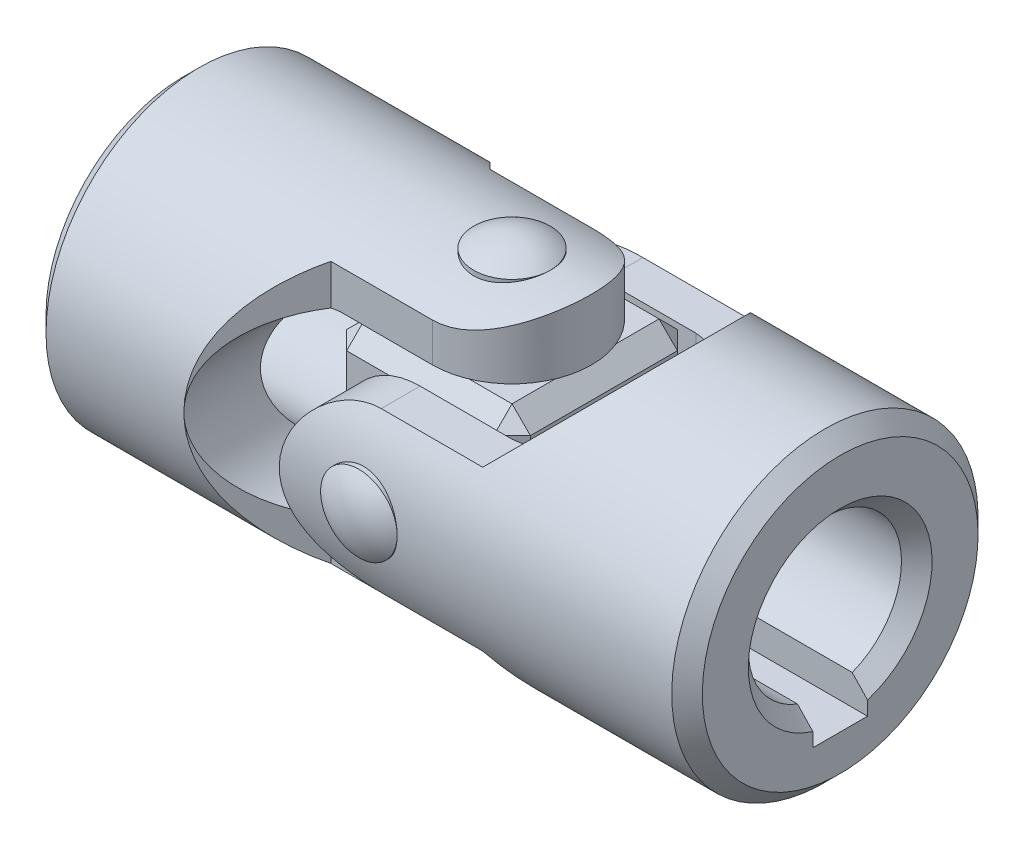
ISO-10303-21;
HEADER;
FILE_DESCRIPTION(('STEP AP214'),'2;1');
FILE_NAME('part.step','',(''),(''),'','','');
FILE_SCHEMA(('AUTOMOTIVE_DESIGN { 1 0 10303 214 1 1 1 1 }'));
ENDSEC;
DATA;
#1=APPLICATION_CONTEXT('core data for automotive mechanical design processes');
#2=APPLICATION_PROTOCOL_DEFINITION('international standard','automotive_design',2000,#1);
#3=PRODUCT_CONTEXT('',#1,'mechanical');
#4=PRODUCT('Part','Part','',(#3));
#5=PRODUCT_RELATED_PRODUCT_CATEGORY('part','',(#4));
#6=PRODUCT_DEFINITION_FORMATION('','',#4);
#7=PRODUCT_DEFINITION_CONTEXT('part definition',#1,'design');
#8=PRODUCT_DEFINITION('design','',#6,#7);
#9=PRODUCT_DEFINITION_SHAPE('','',#8);
#10=(LENGTH_UNIT() NAMED_UNIT(*) SI_UNIT(.MILLI.,.METRE.));
#11=(NAMED_UNIT(*) PLANE_ANGLE_UNIT() SI_UNIT($,.RADIAN.));
#12=(NAMED_UNIT(*) SI_UNIT($,.STERADIAN.) SOLID_ANGLE_UNIT());
#13=UNCERTAINTY_MEASURE_WITH_UNIT(LENGTH_MEASURE(1.E-05),#10,'distance_accuracy_value','');
#14=(GEOMETRIC_REPRESENTATION_CONTEXT(3) GLOBAL_UNCERTAINTY_ASSIGNED_CONTEXT((#13)) GLOBAL_UNIT_ASSIGNED_CONTEXT((#10,
#11,#12)) REPRESENTATION_CONTEXT('',''));
#15=CARTESIAN_POINT('',(0.,0.,0.));
#16=DIRECTION('',(0.,0.,1.));
#17=DIRECTION('',(1.,0.,0.));
#18=AXIS2_PLACEMENT_3D('',#15,#16,#17);
#19=CARTESIAN_POINT('',(0.,14.,0.));
#20=DIRECTION('',(0.,-1.,0.));
#21=DIRECTION('',(-1.,0.,0.));
#22=AXIS2_PLACEMENT_3D('',#19,#20,#21);
#23=CYLINDRICAL_SURFACE('',#22,3.5);
#24=CARTESIAN_POINT('',(0.,14.,0.));
#25=DIRECTION('',(0.,1.,0.));
#26=DIRECTION('',(1.,0.,0.));
#27=AXIS2_PLACEMENT_3D('',#24,#25,#26);
#28=CIRCLE('',#27,3.5);
#29=CARTESIAN_POINT('',(3.5,14.,0.));
#30=VERTEX_POINT('',#29);
#31=EDGE_CURVE('P0_E10',#30,#30,#28,.T.);
#32=ORIENTED_EDGE('',*,*,#31,.F.);
#33=EDGE_LOOP('',(#32));
#34=FACE_BOUND('',#33,.T.);
#35=CARTESIAN_POINT('',(0.,-14.,0.));
#36=DIRECTION('',(0.,-1.,0.));
#37=DIRECTION('',(0.,0.,-1.));
#38=AXIS2_PLACEMENT_3D('',#35,#36,#37);
#39=CIRCLE('',#38,3.5);
#40=CARTESIAN_POINT('',(0.,-14.,-3.5));
#41=VERTEX_POINT('',#40);
#42=EDGE_CURVE('P0_E20',#41,#41,#39,.T.);
#43=ORIENTED_EDGE('',*,*,#42,.F.);
#44=EDGE_LOOP('',(#43));
#45=FACE_BOUND('',#44,.T.);
#46=ADVANCED_FACE('P0_F14',(#34,#45),#23,.T.);
#47=CARTESIAN_POINT('',(0.,9.09125000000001,0.));
#48=DIRECTION('',(0.,-1.,0.));
#49=DIRECTION('',(0.,0.,-1.));
#50=AXIS2_PLACEMENT_3D('',#47,#48,#49);
#51=SPHERICAL_SURFACE('',#50,6.02874999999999);
#52=ORIENTED_EDGE('',*,*,#31,.T.);
#53=EDGE_LOOP('',(#52));
#54=FACE_BOUND('',#53,.T.);
#55=ADVANCED_FACE('P0_F29',(#54),#51,.T.);
#56=CARTESIAN_POINT('',(0.,-9.09125000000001,0.));
#57=DIRECTION('',(0.,1.,0.));
#58=DIRECTION('',(0.,0.,-1.));
#59=AXIS2_PLACEMENT_3D('',#56,#57,#58);
#60=SPHERICAL_SURFACE('',#59,6.02874999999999);
#61=ORIENTED_EDGE('',*,*,#42,.T.);
#62=EDGE_LOOP('',(#61));
#63=FACE_BOUND('',#62,.T.);
#64=ADVANCED_FACE('P0_F26',(#63),#60,.T.);
#65=CLOSED_SHELL('',(#46,#55,#64));
#66=MANIFOLD_SOLID_BREP('P0_B1',#65);
#67=CARTESIAN_POINT('',(0.,0.,14.));
#68=DIRECTION('',(0.,0.,-1.));
#69=DIRECTION('',(-1.,0.,0.));
#70=AXIS2_PLACEMENT_3D('',#67,#68,#69);
#71=CYLINDRICAL_SURFACE('',#70,3.5);
#72=CARTESIAN_POINT('',(0.,0.,14.));
#73=DIRECTION('',(0.,0.,1.));
#74=DIRECTION('',(1.,0.,0.));
#75=AXIS2_PLACEMENT_3D('',#72,#73,#74);
#76=CIRCLE('',#75,3.5);
#77=CARTESIAN_POINT('',(3.5,0.,14.));
#78=VERTEX_POINT('',#77);
#79=EDGE_CURVE('P1_E10',#78,#78,#76,.T.);
#80=ORIENTED_EDGE('',*,*,#79,.F.);
#81=EDGE_LOOP('',(#80));
#82=FACE_BOUND('',#81,.T.);
#83=CARTESIAN_POINT('',(0.,0.,-14.));
#84=DIRECTION('',(0.,0.,-1.));
#85=DIRECTION('',(0.,1.,0.));
#86=AXIS2_PLACEMENT_3D('',#83,#84,#85);
#87=CIRCLE('',#86,3.5);
#88=CARTESIAN_POINT('',(0.,3.5,-14.));
#89=VERTEX_POINT('',#88);
#90=EDGE_CURVE('P1_E20',#89,#89,#87,.T.);
#91=ORIENTED_EDGE('',*,*,#90,.F.);
#92=EDGE_LOOP('',(#91));
#93=FACE_BOUND('',#92,.T.);
#94=ADVANCED_FACE('P1_F14',(#82,#93),#71,.T.);
#95=CARTESIAN_POINT('',(0.,0.,9.09125000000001));
#96=DIRECTION('',(0.,0.,-1.));
#97=DIRECTION('',(0.,1.,0.));
#98=AXIS2_PLACEMENT_3D('',#95,#96,#97);
#99=SPHERICAL_SURFACE('',#98,6.02874999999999);
#100=ORIENTED_EDGE('',*,*,#79,.T.);
#101=EDGE_LOOP('',(#100));
#102=FACE_BOUND('',#101,.T.);
#103=ADVANCED_FACE('P1_F29',(#102),#99,.T.);
#104=CARTESIAN_POINT('',(0.,0.,-9.09125000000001));
#105=DIRECTION('',(0.,0.,1.));
#106=DIRECTION('',(0.,1.,0.));
#107=AXIS2_PLACEMENT_3D('',#104,#105,#106);
#108=SPHERICAL_SURFACE('',#107,6.02874999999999);
#109=ORIENTED_EDGE('',*,*,#90,.T.);
#110=EDGE_LOOP('',(#109));
#111=FACE_BOUND('',#110,.T.);
#112=ADVANCED_FACE('P1_F26',(#111),#108,.T.);
#113=CLOSED_SHELL('',(#94,#103,#112));
#114=MANIFOLD_SOLID_BREP('P1_B1',#113);
#115=CARTESIAN_POINT('',(0.,-14.,-7.28));
#116=DIRECTION('',(0.,0.,1.));
#117=DIRECTION('',(1.,0.,0.));
#118=AXIS2_PLACEMENT_3D('',#115,#116,#117);
#119=PLANE('',#118);
#120=DIRECTION('',(0.,1.,0.));
#121=VECTOR('',#120,1.);
#122=CARTESIAN_POINT('',(0.,-14.,-7.28));
#123=LINE('',#122,#121);
#124=CARTESIAN_POINT('',(0.,8.4,-7.28));
#125=VERTEX_POINT('',#124);
#126=CARTESIAN_POINT('',(0.,11.9583276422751,-7.28));
#127=VERTEX_POINT('',#126);
#128=EDGE_CURVE('P2_E349',#125,#127,#123,.T.);
#129=ORIENTED_EDGE('',*,*,#128,.F.);
#130=DIRECTION('',(-1.,0.,0.));
#131=VECTOR('',#130,1.);
#132=CARTESIAN_POINT('',(0.,8.4,-7.28));
#133=LINE('',#132,#131);
#134=CARTESIAN_POINT('',(-8.4,8.4,-7.28));
#135=VERTEX_POINT('',#134);
#136=EDGE_CURVE('P2_E179',#125,#135,#133,.T.);
#137=ORIENTED_EDGE('',*,*,#136,.T.);
#138=CARTESIAN_POINT('',(-7.55789473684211,0.,-7.28));
#139=DIRECTION('',(0.,0.,1.));
#140=DIRECTION('',(1.,0.,0.));
#141=AXIS2_PLACEMENT_3D('',#138,#139,#140);
#142=CIRCLE('',#141,8.4421052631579);
#143=CARTESIAN_POINT('',(-9.28000000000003,8.26459283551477,-7.28));
#144=VERTEX_POINT('',#143);
#145=EDGE_CURVE('P2_E196',#135,#144,#142,.T.);
#146=ORIENTED_EDGE('',*,*,#145,.T.);
#147=DIRECTION('',(0.,1.,0.));
#148=VECTOR('',#147,1.);
#149=CARTESIAN_POINT('',(-9.28000000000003,-14.,-7.28));
#150=LINE('',#149,#148);
#151=CARTESIAN_POINT('',(-9.28000000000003,11.9583276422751,-7.28));
#152=VERTEX_POINT('',#151);
#153=EDGE_CURVE('P2_E356',#144,#152,#150,.T.);
#154=ORIENTED_EDGE('',*,*,#153,.T.);
#155=DIRECTION('',(1.,0.,0.));
#156=VECTOR('',#155,1.);
#157=CARTESIAN_POINT('',(-30.,11.9583276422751,-7.28));
#158=LINE('',#157,#156);
#159=EDGE_CURVE('P2_E283',#127,#152,#158,.F.);
#160=ORIENTED_EDGE('',*,*,#159,.F.);
#161=EDGE_LOOP('',(#129,#137,#146,#154,#160));
#162=FACE_BOUND('',#161,.T.);
#163=ADVANCED_FACE('P2_F16',(#162),#119,.F.);
#164=CARTESIAN_POINT('',(-9.28000000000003,-14.,-7.28));
#165=DIRECTION('',(-0.707106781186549,0.,0.707106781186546));
#166=DIRECTION('',(0.707106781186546,0.,0.707106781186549));
#167=AXIS2_PLACEMENT_3D('',#164,#165,#166);
#168=PLANE('',#167);
#169=CARTESIAN_POINT('',(-2.00000000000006,0.,0.));
#170=DIRECTION('',(-0.707106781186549,0.,0.707106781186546));
#171=DIRECTION('',(0.707106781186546,0.,0.707106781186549));
#172=AXIS2_PLACEMENT_3D('',#169,#170,#171);
#173=ELLIPSE('',#172,19.7989898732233,14.);
#174=CARTESIAN_POINT('',(-16.,0.,-14.));
#175=VERTEX_POINT('',#174);
#176=CARTESIAN_POINT('',(-9.28000000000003,-11.9583276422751,-7.28));
#177=VERTEX_POINT('',#176);
#178=EDGE_CURVE('P2_E286',#175,#177,#173,.T.);
#179=ORIENTED_EDGE('',*,*,#178,.F.);
#180=CARTESIAN_POINT('',(-7.55789473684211,0.,-5.55789473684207));
#181=DIRECTION('',(-0.707106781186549,0.,0.707106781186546));
#182=DIRECTION('',(-0.707106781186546,0.,-0.707106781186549));
#183=AXIS2_PLACEMENT_3D('',#180,#181,#182);
#184=ELLIPSE('',#183,11.9389397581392,8.4421052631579);
#185=CARTESIAN_POINT('',(-9.28000000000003,-8.26459283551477,-7.28));
#186=VERTEX_POINT('',#185);
#187=EDGE_CURVE('P2_E192',#175,#186,#184,.T.);
#188=ORIENTED_EDGE('',*,*,#187,.T.);
#189=EDGE_CURVE('P2_E353',#177,#186,#150,.T.);
#190=ORIENTED_EDGE('',*,*,#189,.F.);
#191=EDGE_LOOP('',(#179,#188,#190));
#192=FACE_BOUND('',#191,.T.);
#193=ADVANCED_FACE('P2_F234',(#192),#168,.F.);
#194=CARTESIAN_POINT('',(-9.28000000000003,-14.,7.28));
#195=DIRECTION('',(-0.707106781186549,0.,-0.707106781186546));
#196=DIRECTION('',(-0.707106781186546,0.,0.707106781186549));
#197=AXIS2_PLACEMENT_3D('',#194,#195,#196);
#198=PLANE('',#197);
#199=DIRECTION('',(0.,1.,0.));
#200=VECTOR('',#199,1.);
#201=CARTESIAN_POINT('',(-9.28000000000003,-14.,7.28));
#202=LINE('',#201,#200);
#203=CARTESIAN_POINT('',(-9.28000000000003,-11.9583276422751,7.28));
#204=VERTEX_POINT('',#203);
#205=CARTESIAN_POINT('',(-9.28000000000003,-8.26459283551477,7.28));
#206=VERTEX_POINT('',#205);
#207=EDGE_CURVE('P2_E359',#204,#206,#202,.T.);
#208=ORIENTED_EDGE('',*,*,#207,.T.);
#209=CARTESIAN_POINT('',(-7.55789473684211,0.,5.55789473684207));
#210=DIRECTION('',(-0.707106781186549,0.,-0.707106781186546));
#211=DIRECTION('',(0.707106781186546,0.,-0.707106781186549));
#212=AXIS2_PLACEMENT_3D('',#209,#210,#211);
#213=ELLIPSE('',#212,11.9389397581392,8.4421052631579);
#214=CARTESIAN_POINT('',(-16.,0.,14.));
#215=VERTEX_POINT('',#214);
#216=EDGE_CURVE('P2_E185',#206,#215,#213,.T.);
#217=ORIENTED_EDGE('',*,*,#216,.T.);
#218=CARTESIAN_POINT('',(-2.00000000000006,0.,0.));
#219=DIRECTION('',(-0.707106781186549,0.,-0.707106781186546));
#220=DIRECTION('',(0.707106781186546,0.,-0.707106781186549));
#221=AXIS2_PLACEMENT_3D('',#218,#219,#220);
#222=ELLIPSE('',#221,19.7989898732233,14.);
#223=EDGE_CURVE('P2_E297',#204,#215,#222,.T.);
#224=ORIENTED_EDGE('',*,*,#223,.F.);
#225=EDGE_LOOP('',(#208,#217,#224));
#226=FACE_BOUND('',#225,.T.);
#227=ADVANCED_FACE('P2_F239',(#226),#198,.F.);
#228=CARTESIAN_POINT('',(0.,-14.,7.28));
#229=DIRECTION('',(0.,0.,-1.));
#230=DIRECTION('',(-1.,0.,0.));
#231=AXIS2_PLACEMENT_3D('',#228,#229,#230);
#232=PLANE('',#231);
#233=CARTESIAN_POINT('',(-7.55789473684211,0.,7.28));
#234=DIRECTION('',(0.,0.,-1.));
#235=DIRECTION('',(-1.,0.,0.));
#236=AXIS2_PLACEMENT_3D('',#233,#234,#235);
#237=CIRCLE('',#236,8.4421052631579);
#238=CARTESIAN_POINT('',(-9.28000000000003,8.26459283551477,7.28));
#239=VERTEX_POINT('',#238);
#240=CARTESIAN_POINT('',(-8.4,8.4,7.28));
#241=VERTEX_POINT('',#240);
#242=EDGE_CURVE('P2_E311',#239,#241,#237,.T.);
#243=ORIENTED_EDGE('',*,*,#242,.T.);
#244=DIRECTION('',(1.,0.,0.));
#245=VECTOR('',#244,1.);
#246=CARTESIAN_POINT('',(0.,8.4,7.28));
#247=LINE('',#246,#245);
#248=CARTESIAN_POINT('',(0.,8.4,7.28));
#249=VERTEX_POINT('',#248);
#250=EDGE_CURVE('P2_E176',#241,#249,#247,.T.);
#251=ORIENTED_EDGE('',*,*,#250,.T.);
#252=DIRECTION('',(0.,1.,0.));
#253=VECTOR('',#252,1.);
#254=CARTESIAN_POINT('',(0.,-14.,7.28));
#255=LINE('',#254,#253);
#256=CARTESIAN_POINT('',(0.,11.9583276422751,7.28));
#257=VERTEX_POINT('',#256);
#258=EDGE_CURVE('P2_E204',#249,#257,#255,.T.);
#259=ORIENTED_EDGE('',*,*,#258,.T.);
#260=DIRECTION('',(1.,0.,0.));
#261=VECTOR('',#260,1.);
#262=CARTESIAN_POINT('',(-30.,11.9583276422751,7.28));
#263=LINE('',#262,#261);
#264=CARTESIAN_POINT('',(-9.28000000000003,11.9583276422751,7.28));
#265=VERTEX_POINT('',#264);
#266=EDGE_CURVE('P2_E300',#265,#257,#263,.T.);
#267=ORIENTED_EDGE('',*,*,#266,.F.);
#268=EDGE_CURVE('P2_E361',#239,#265,#202,.T.);
#269=ORIENTED_EDGE('',*,*,#268,.F.);
#270=EDGE_LOOP('',(#243,#251,#259,#267,#269));
#271=FACE_BOUND('',#270,.T.);
#272=ADVANCED_FACE('P2_F243',(#271),#232,.F.);
#273=CARTESIAN_POINT('',(0.,-14.,0.));
#274=DIRECTION('',(0.,1.,0.));
#275=DIRECTION('',(0.,0.,-1.));
#276=AXIS2_PLACEMENT_3D('',#273,#274,#275);
#277=CYLINDRICAL_SURFACE('',#276,7.28);
#278=ORIENTED_EDGE('',*,*,#258,.F.);
#279=CARTESIAN_POINT('',(0.,8.4,0.));
#280=DIRECTION('',(0.,1.,0.));
#281=DIRECTION('',(1.,0.,0.));
#282=AXIS2_PLACEMENT_3D('',#279,#280,#281);
#283=CIRCLE('',#282,7.28);
#284=EDGE_CURVE('P2_E305',#249,#125,#283,.T.);
#285=ORIENTED_EDGE('',*,*,#284,.T.);
#286=ORIENTED_EDGE('',*,*,#128,.T.);
#287=CARTESIAN_POINT('',(0.,11.9583276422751,7.28));
#288=CARTESIAN_POINT('',(0.189455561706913,11.9582667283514,7.28003707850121));
#289=CARTESIAN_POINT('',(0.378881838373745,11.9628280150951,7.27260618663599));
#290=CARTESIAN_POINT('',(0.756047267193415,11.9807402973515,7.24309345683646));
#291=CARTESIAN_POINT('',(0.943787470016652,11.994085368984,7.22102149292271));
#292=CARTESIAN_POINT('',(1.31506735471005,12.0290040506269,7.16269067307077));
#293=CARTESIAN_POINT('',(1.49862575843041,12.0505265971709,7.12651982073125));
#294=CARTESIAN_POINT('',(1.86146271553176,12.1010074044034,7.04046311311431));
#295=CARTESIAN_POINT('',(2.04074071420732,12.1299666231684,6.99057549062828));
#296=CARTESIAN_POINT('',(2.39343287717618,12.1942660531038,6.87779517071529));
#297=CARTESIAN_POINT('',(2.56686135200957,12.2295891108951,6.81493736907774));
#298=CARTESIAN_POINT('',(2.90748602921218,12.3055872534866,6.6767311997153));
#299=CARTESIAN_POINT('',(3.07467981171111,12.3462643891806,6.60137804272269));
#300=CARTESIAN_POINT('',(3.56610336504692,12.4747232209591,6.35728938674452));
#301=CARTESIAN_POINT('',(3.8799251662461,12.5688840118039,6.17060560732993));
#302=CARTESIAN_POINT('',(4.50109569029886,12.7737134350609,5.73540708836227));
#303=CARTESIAN_POINT('',(4.80538838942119,12.8851054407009,5.48287080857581));
#304=CARTESIAN_POINT('',(5.2283559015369,13.050690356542,5.06967684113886));
#305=CARTESIAN_POINT('',(5.36382540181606,13.1056617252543,4.92613412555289));
#306=CARTESIAN_POINT('',(5.62300997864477,13.2138548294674,4.62808213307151));
#307=CARTESIAN_POINT('',(5.74672329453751,13.267076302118,4.47357121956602));
#308=CARTESIAN_POINT('',(5.99038152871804,13.3743569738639,4.14235538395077));
#309=CARTESIAN_POINT('',(6.10935056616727,13.4281804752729,3.964854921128));
#310=CARTESIAN_POINT('',(6.3317306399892,13.5308050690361,3.5990791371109));
#311=CARTESIAN_POINT('',(6.43514834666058,13.5796083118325,3.41080848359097));
#312=CARTESIAN_POINT('',(6.62542609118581,13.6708046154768,3.02463985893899));
#313=CARTESIAN_POINT('',(6.71229050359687,13.713199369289,2.82674444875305));
#314=CARTESIAN_POINT('',(6.86846479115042,13.79031521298,2.42270177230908));
#315=CARTESIAN_POINT('',(6.93777671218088,13.8250371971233,2.21655547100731));
#316=CARTESIAN_POINT('',(7.05335454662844,13.8834116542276,1.81359575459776));
#317=CARTESIAN_POINT('',(7.10097059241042,13.9077043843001,1.61726195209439));
#318=CARTESIAN_POINT('',(7.17981086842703,13.948122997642,1.22049788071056));
#319=CARTESIAN_POINT('',(7.21103585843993,13.9642492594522,1.02006780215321));
#320=CARTESIAN_POINT('',(7.25664965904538,13.987858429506,0.616903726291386));
#321=CARTESIAN_POINT('',(7.2710475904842,13.9953460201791,0.414171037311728));
#322=CARTESIAN_POINT('',(7.28282821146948,14.0014698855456,0.00808379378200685));
#323=CARTESIAN_POINT('',(7.2802120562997,14.0001067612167,-0.195270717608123));
#324=CARTESIAN_POINT('',(7.25905610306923,13.9891182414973,-0.58167507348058));
#325=CARTESIAN_POINT('',(7.24203939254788,13.9802831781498,-0.764833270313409));
#326=CARTESIAN_POINT('',(7.19427725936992,13.9556012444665,-1.12893586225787));
#327=CARTESIAN_POINT('',(7.16352722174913,13.9397520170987,-1.30987949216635));
#328=CARTESIAN_POINT('',(7.08865613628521,13.901424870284,-1.66818523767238));
#329=CARTESIAN_POINT('',(7.0445400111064,13.878949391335,-1.84554864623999));
#330=CARTESIAN_POINT('',(6.94337717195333,13.8278769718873,-2.1957101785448));
#331=CARTESIAN_POINT('',(6.88632542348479,13.7992776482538,-2.36850649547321));
#332=CARTESIAN_POINT('',(6.75905507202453,13.7362050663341,-2.71058752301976));
#333=CARTESIAN_POINT('',(6.68868199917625,13.7016633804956,-2.87980213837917));
#334=CARTESIAN_POINT('',(6.53585394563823,13.6277118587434,-3.21160566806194));
#335=CARTESIAN_POINT('',(6.45339490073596,13.5883003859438,-3.37419232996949));
#336=CARTESIAN_POINT('',(6.18885196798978,13.4639938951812,-3.85076934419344));
#337=CARTESIAN_POINT('',(5.9895267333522,13.3729882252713,-4.15377786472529));
#338=CARTESIAN_POINT('',(5.52787648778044,13.1723802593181,-4.75376577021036));
#339=CARTESIAN_POINT('',(5.26124639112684,13.0618283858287,-5.0471168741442));
#340=CARTESIAN_POINT('',(4.82862100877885,12.8957150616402,-5.45178331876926));
#341=CARTESIAN_POINT('',(4.6788234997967,12.840248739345,-5.58087413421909));
#342=CARTESIAN_POINT('',(4.36887226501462,12.7305783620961,-5.8267023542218));
#343=CARTESIAN_POINT('',(4.20871681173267,12.6763745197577,-5.94343768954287));
#344=CARTESIAN_POINT('',(3.86660421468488,12.5667844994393,-6.17196598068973));
#345=CARTESIAN_POINT('',(3.68391044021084,12.5116064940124,-6.28275771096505));
#346=CARTESIAN_POINT('',(3.30844484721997,12.4062471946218,-6.48832554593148));
#347=CARTESIAN_POINT('',(3.1156777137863,12.356063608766,-6.58310901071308));
#348=CARTESIAN_POINT('',(2.7214975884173,12.2626084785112,-6.75559349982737));
#349=CARTESIAN_POINT('',(2.52010250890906,12.2193234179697,-6.83332804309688));
#350=CARTESIAN_POINT('',(2.10973209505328,12.1413368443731,-6.97095504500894));
#351=CARTESIAN_POINT('',(1.90076004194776,12.1066316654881,-7.03085512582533));
#352=CARTESIAN_POINT('',(1.55170178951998,12.0578145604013,-7.11410796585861));
#353=CARTESIAN_POINT('',(1.41329812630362,12.0407557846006,-7.1429007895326));
#354=CARTESIAN_POINT('',(1.13459770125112,12.011233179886,-7.19243411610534));
#355=CARTESIAN_POINT('',(0.99430147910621,11.9987680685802,-7.2131768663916));
#356=CARTESIAN_POINT('',(0.712043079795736,11.9786799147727,-7.24649077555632));
#357=CARTESIAN_POINT('',(0.570077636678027,11.9710689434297,-7.25904156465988));
#358=CARTESIAN_POINT('',(0.285411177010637,11.9608816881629,-7.2758041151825));
#359=CARTESIAN_POINT('',(0.142709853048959,11.9583077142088,-7.28001205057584));
#360=CARTESIAN_POINT('',(0.,11.9583276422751,-7.28));
#361=B_SPLINE_CURVE_WITH_KNOTS('',3,(#287,#288,#289,#290,#291,#292,#293,#294,#295,#296,#297,
#298,#299,#300,#301,#302,#303,#304,#305,#306,#307,#308,#309,#310,#311,#312,#313,#314,#315,#316,
#317,#318,#319,#320,#321,#322,#323,#324,#325,#326,#327,#328,#329,#330,#331,#332,#333,#334,#335,
#336,#337,#338,#339,#340,#341,#342,#343,#344,#345,#346,#347,#348,#349,#350,#351,#352,#353,#354,
#355,#356,#357,#358,#359,#360),.UNSPECIFIED.,.F.,.F.,(4,2,2,2,2,2,2,2,2,2,2,2,2,2,2,2,2,2,2,2,2,
2,2,2,2,2,2,2,2,2,2,2,2,2,2,2,4),(0.,0.568119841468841,1.13585692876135,1.70010559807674,
2.26442699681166,2.82724945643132,3.39028813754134,4.51715867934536,5.74421466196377,
6.35835263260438,6.97258243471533,7.63280689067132,8.29274734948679,8.95251316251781,
9.6122020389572,10.2218082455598,10.8313861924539,11.4406335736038,12.0498395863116,
12.6016633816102,13.1536727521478,13.7054790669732,14.2575005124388,14.8163657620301,
15.3754193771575,16.4928787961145,17.7220050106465,18.3376235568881,18.9533450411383,
19.6145258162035,20.2754017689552,20.9349665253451,21.5942489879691,22.0211451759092,
22.4479220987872,22.8757562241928,23.3037865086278),.UNSPECIFIED.);
#362=EDGE_CURVE('P2_E258',#257,#127,#361,.T.);
#363=ORIENTED_EDGE('',*,*,#362,.F.);
#364=EDGE_LOOP('',(#278,#285,#286,#363));
#365=FACE_BOUND('',#364,.T.);
#366=ADVANCED_FACE('P2_F247',(#365),#277,.T.);
#367=CARTESIAN_POINT('',(-30.,0.,0.));
#368=DIRECTION('',(-1.,0.,0.));
#369=DIRECTION('',(0.,0.,1.));
#370=AXIS2_PLACEMENT_3D('',#367,#368,#369);
#371=PLANE('',#370);
#372=DIRECTION('',(0.,0.,1.));
#373=VECTOR('',#372,1.);
#374=CARTESIAN_POINT('',(-30.,-2.5,-9.3));
#375=LINE('',#374,#373);
#376=CARTESIAN_POINT('',(-30.,-2.5,-9.3));
#377=VERTEX_POINT('',#376);
#378=CARTESIAN_POINT('',(-30.,-2.5,-8.01935159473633));
#379=VERTEX_POINT('',#378);
#380=EDGE_CURVE('P2_E139',#377,#379,#375,.T.);
#381=ORIENTED_EDGE('',*,*,#380,.F.);
#382=DIRECTION('',(0.,-1.,0.));
#383=VECTOR('',#382,1.);
#384=CARTESIAN_POINT('',(-30.,-2.5,-9.3));
#385=LINE('',#384,#383);
#386=CARTESIAN_POINT('',(-30.,2.5,-9.3));
#387=VERTEX_POINT('',#386);
#388=EDGE_CURVE('P2_E135',#387,#377,#385,.T.);
#389=ORIENTED_EDGE('',*,*,#388,.F.);
#390=DIRECTION('',(0.,0.,-1.));
#391=VECTOR('',#390,1.);
#392=CARTESIAN_POINT('',(-30.,2.5,-9.3));
#393=LINE('',#392,#391);
#394=CARTESIAN_POINT('',(-30.,2.5,-8.01935159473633));
#395=VERTEX_POINT('',#394);
#396=EDGE_CURVE('P2_E142',#395,#387,#393,.T.);
#397=ORIENTED_EDGE('',*,*,#396,.F.);
#398=CARTESIAN_POINT('',(-30.,0.,0.));
#399=DIRECTION('',(-1.,0.,0.));
#400=DIRECTION('',(0.,0.,1.));
#401=AXIS2_PLACEMENT_3D('',#398,#399,#400);
#402=CIRCLE('',#401,8.4);
#403=EDGE_CURVE('P2_E318',#395,#379,#402,.F.);
#404=ORIENTED_EDGE('',*,*,#403,.T.);
#405=EDGE_LOOP('',(#381,#389,#397,#404));
#406=FACE_BOUND('',#405,.T.);
#407=CARTESIAN_POINT('',(-30.,0.,0.));
#408=DIRECTION('',(-1.,0.,0.));
#409=DIRECTION('',(0.,0.,1.));
#410=AXIS2_PLACEMENT_3D('',#407,#408,#409);
#411=CIRCLE('',#410,12.6);
#412=CARTESIAN_POINT('',(-30.,0.,12.6));
#413=VERTEX_POINT('',#412);
#414=EDGE_CURVE('P2_E315',#413,#413,#411,.T.);
#415=ORIENTED_EDGE('',*,*,#414,.T.);
#416=EDGE_LOOP('',(#415));
#417=FACE_BOUND('',#416,.T.);
#418=ADVANCED_FACE('P2_F149',(#406,#417),#371,.T.);
#419=CARTESIAN_POINT('',(-30.,0.,0.));
#420=DIRECTION('',(1.,0.,0.));
#421=DIRECTION('',(0.,0.,-1.));
#422=AXIS2_PLACEMENT_3D('',#419,#420,#421);
#423=CYLINDRICAL_SURFACE('',#422,14.);
#424=CARTESIAN_POINT('',(-28.6,0.,0.));
#425=DIRECTION('',(-1.,0.,0.));
#426=DIRECTION('',(0.,0.,1.));
#427=AXIS2_PLACEMENT_3D('',#424,#425,#426);
#428=CIRCLE('',#427,14.);
#429=CARTESIAN_POINT('',(-28.6,0.,14.));
#430=VERTEX_POINT('',#429);
#431=EDGE_CURVE('P2_E320',#430,#430,#428,.F.);
#432=ORIENTED_EDGE('',*,*,#431,.T.);
#433=EDGE_LOOP('',(#432));
#434=FACE_BOUND('',#433,.T.);
#435=CARTESIAN_POINT('',(3.5,-14.,0.));
#436=CARTESIAN_POINT('',(3.49999457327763,-13.9999967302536,-0.193377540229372));
#437=CARTESIAN_POINT('',(3.48391971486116,-13.9959534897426,-0.386815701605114));
#438=CARTESIAN_POINT('',(3.42014131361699,-13.9802159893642,-0.76814808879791));
#439=CARTESIAN_POINT('',(3.37241984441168,-13.9685173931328,-0.956039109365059));
#440=CARTESIAN_POINT('',(3.24697507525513,-13.9387646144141,-1.32071536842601));
#441=CARTESIAN_POINT('',(3.1692878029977,-13.9207180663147,-1.49751364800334));
#442=CARTESIAN_POINT('',(2.9862434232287,-13.8801913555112,-1.835568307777));
#443=CARTESIAN_POINT('',(2.88088538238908,-13.8577110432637,-1.99682416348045));
#444=CARTESIAN_POINT('',(2.64319815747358,-13.8102396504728,-2.3025378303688));
#445=CARTESIAN_POINT('',(2.51040632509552,-13.7852098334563,-2.4466299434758));
#446=CARTESIAN_POINT('',(2.22261152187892,-13.7357178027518,-2.71074749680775));
#447=CARTESIAN_POINT('',(2.06760604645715,-13.7112556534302,-2.83077021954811));
#448=CARTESIAN_POINT('',(1.73694447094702,-13.6652780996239,-3.04506193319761));
#449=CARTESIAN_POINT('',(1.56101579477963,-13.6438118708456,-3.13892183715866));
#450=CARTESIAN_POINT('',(1.19525370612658,-13.6068215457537,-3.2955927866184));
#451=CARTESIAN_POINT('',(1.0054225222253,-13.5912964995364,-3.358408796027));
#452=CARTESIAN_POINT('',(0.621265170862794,-13.5683444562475,-3.44996128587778));
#453=CARTESIAN_POINT('',(0.427105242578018,-13.5607614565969,-3.47935529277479));
#454=CARTESIAN_POINT('',(0.036473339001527,-13.5540851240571,-3.50527747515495));
#455=CARTESIAN_POINT('',(-0.15999825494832,-13.554990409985,-3.50181099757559));
#456=CARTESIAN_POINT('',(-0.544636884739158,-13.5650481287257,-3.46263522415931));
#457=CARTESIAN_POINT('',(-0.732889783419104,-13.5740001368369,-3.42770946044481));
#458=CARTESIAN_POINT('',(-1.10077578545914,-13.5988232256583,-3.32785643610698));
#459=CARTESIAN_POINT('',(-1.28040827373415,-13.6146947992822,-3.26292703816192));
#460=CARTESIAN_POINT('',(-1.62805537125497,-13.6517526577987,-3.10424211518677));
#461=CARTESIAN_POINT('',(-1.79593440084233,-13.6729909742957,-3.01020222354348));
#462=CARTESIAN_POINT('',(-2.11381032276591,-13.7183599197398,-2.79616464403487));
#463=CARTESIAN_POINT('',(-2.26380407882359,-13.7424910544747,-2.67616241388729));
#464=CARTESIAN_POINT('',(-2.54614176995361,-13.7917705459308,-2.40954799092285));
#465=CARTESIAN_POINT('',(-2.67786047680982,-13.81692828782,-2.26227460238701));
#466=CARTESIAN_POINT('',(-2.91484956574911,-13.8648058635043,-1.94742780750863));
#467=CARTESIAN_POINT('',(-3.02011913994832,-13.8875256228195,-1.77985378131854));
#468=CARTESIAN_POINT('',(-3.2014513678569,-13.9280804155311,-1.42827040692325));
#469=CARTESIAN_POINT('',(-3.27741246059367,-13.9458984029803,-1.24420658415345));
#470=CARTESIAN_POINT('',(-3.397140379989,-13.9745180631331,-0.865377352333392));
#471=CARTESIAN_POINT('',(-3.44091336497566,-13.9853210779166,-0.670613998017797));
#472=CARTESIAN_POINT('',(-3.49406765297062,-13.9984949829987,-0.281259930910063));
#473=CARTESIAN_POINT('',(-3.50430039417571,-14.0010745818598,-0.0867923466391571));
#474=CARTESIAN_POINT('',(-3.49241899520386,-13.9981054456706,0.301076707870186));
#475=CARTESIAN_POINT('',(-3.47030776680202,-13.9925574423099,0.494478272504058));
#476=CARTESIAN_POINT('',(-3.39506788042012,-13.9740902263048,0.871766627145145));
#477=CARTESIAN_POINT('',(-3.34240371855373,-13.961281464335,1.05575194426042));
#478=CARTESIAN_POINT('',(-3.20808347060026,-13.9297364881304,1.41226701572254));
#479=CARTESIAN_POINT('',(-3.12642445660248,-13.9109996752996,1.58479561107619));
#480=CARTESIAN_POINT('',(-2.93478236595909,-13.8691771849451,1.9168873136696));
#481=CARTESIAN_POINT('',(-2.82432240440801,-13.8460202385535,2.07616603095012));
#482=CARTESIAN_POINT('',(-2.57882354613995,-13.7980385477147,2.37422876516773));
#483=CARTESIAN_POINT('',(-2.44378040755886,-13.7732135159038,2.51300923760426));
#484=CARTESIAN_POINT('',(-2.14899542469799,-13.7239423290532,2.76964465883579));
#485=CARTESIAN_POINT('',(-1.9887286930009,-13.699520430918,2.88690235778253));
#486=CARTESIAN_POINT('',(-1.65029051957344,-13.6545004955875,3.0928584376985));
#487=CARTESIAN_POINT('',(-1.47211987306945,-13.6339022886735,3.18155808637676));
#488=CARTESIAN_POINT('',(-1.1038866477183,-13.5990888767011,3.32721998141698));
#489=CARTESIAN_POINT('',(-0.913902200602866,-13.5848359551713,3.38437025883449));
#490=CARTESIAN_POINT('',(-0.526610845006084,-13.5642906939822,3.46580653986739));
#491=CARTESIAN_POINT('',(-0.329305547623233,-13.5579966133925,3.49009973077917));
#492=CARTESIAN_POINT('',(0.0609490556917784,-13.5542143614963,3.50475671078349));
#493=CARTESIAN_POINT('',(0.253860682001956,-13.5564784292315,3.49607509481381));
#494=CARTESIAN_POINT('',(0.635375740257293,-13.5689845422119,3.44721364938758));
#495=CARTESIAN_POINT('',(0.823979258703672,-13.5792264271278,3.40703445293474));
#496=CARTESIAN_POINT('',(1.19048640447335,-13.6063960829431,3.29683974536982));
#497=CARTESIAN_POINT('',(1.3684470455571,-13.6232836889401,3.22700327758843));
#498=CARTESIAN_POINT('',(1.71025255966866,-13.6618476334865,3.05961813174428));
#499=CARTESIAN_POINT('',(1.87409547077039,-13.6835246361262,2.96206561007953));
#500=CARTESIAN_POINT('',(2.18762746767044,-13.7299314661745,2.73902474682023));
#501=CARTESIAN_POINT('',(2.33683583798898,-13.7547261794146,2.61287404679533));
#502=CARTESIAN_POINT('',(2.6122764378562,-13.8041873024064,2.33750853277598));
#503=CARTESIAN_POINT('',(2.738503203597,-13.8288536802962,2.18828824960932));
#504=CARTESIAN_POINT('',(2.96662638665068,-13.875811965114,1.86775770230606));
#505=CARTESIAN_POINT('',(3.06804076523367,-13.8980527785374,1.69609631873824));
#506=CARTESIAN_POINT('',(3.24041074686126,-13.9371149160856,1.33762080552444));
#507=CARTESIAN_POINT('',(3.31138817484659,-13.9539401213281,1.15081764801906));
#508=CARTESIAN_POINT('',(3.41033427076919,-13.9777880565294,0.803623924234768));
#509=CARTESIAN_POINT('',(3.44388623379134,-13.9860603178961,0.644887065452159));
#510=CARTESIAN_POINT('',(3.48872053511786,-13.9971674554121,0.324114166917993));
#511=CARTESIAN_POINT('',(3.50000454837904,-14.0000027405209,0.162078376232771));
#512=CARTESIAN_POINT('',(3.5,-14.,0.));
#513=B_SPLINE_CURVE_WITH_KNOTS('',3,(#435,#436,#437,#438,#439,#440,#441,#442,#443,#444,#445,
#446,#447,#448,#449,#450,#451,#452,#453,#454,#455,#456,#457,#458,#459,#460,#461,#462,#463,#464,
#465,#466,#467,#468,#469,#470,#471,#472,#473,#474,#475,#476,#477,#478,#479,#480,#481,#482,#483,
#484,#485,#486,#487,#488,#489,#490,#491,#492,#493,#494,#495,#496,#497,#498,#499,#500,#501,#502,
#503,#504,#505,#506,#507,#508,#509,#510,#511,#512),.UNSPECIFIED.,.T.,.F.,(4,2,2,2,2,2,2,2,2,2,2,
2,2,2,2,2,2,2,2,2,2,2,2,2,2,2,2,2,2,2,2,2,2,2,2,2,2,2,4),(0.,0.579538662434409,1.15940588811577,
1.73857810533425,2.3177698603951,2.90767016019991,3.49763702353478,4.09636844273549,
4.69500409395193,5.28164688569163,5.86819422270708,6.44052493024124,7.01289641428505,
7.591045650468,8.16929611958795,8.76403502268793,9.35879208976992,9.95559201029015,
10.5522777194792,11.1336938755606,11.7150576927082,12.287806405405,12.8606129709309,
13.4435837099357,14.0266551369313,14.6240385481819,15.221395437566,15.8151526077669,
16.4087798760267,16.9853548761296,17.5619182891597,18.1350493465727,18.7082599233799,
19.2964234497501,19.884726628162,20.4836843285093,21.0822118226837,21.5679856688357,
22.0537229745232),.UNSPECIFIED.);
#514=CARTESIAN_POINT('',(3.5,-14.,0.));
#515=VERTEX_POINT('',#514);
#516=EDGE_CURVE('P2_E278',#515,#515,#513,.T.);
#517=ORIENTED_EDGE('',*,*,#516,.T.);
#518=EDGE_LOOP('',(#517));
#519=FACE_BOUND('',#518,.T.);
#520=CARTESIAN_POINT('',(0.,13.555441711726,-3.5));
#521=CARTESIAN_POINT('',(0.193271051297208,13.55544540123,-3.4999945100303));
#522=CARTESIAN_POINT('',(0.386602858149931,13.5596202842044,-3.48393674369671));
#523=CARTESIAN_POINT('',(0.767714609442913,13.5758260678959,-3.42023237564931));
#524=CARTESIAN_POINT('',(0.95549125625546,13.5878615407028,-3.37256738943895));
#525=CARTESIAN_POINT('',(1.31992495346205,13.6183421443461,-3.24728767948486));
#526=CARTESIAN_POINT('',(1.49659601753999,13.6367789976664,-3.16971161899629));
#527=CARTESIAN_POINT('',(1.83443519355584,13.6779746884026,-2.98692959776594));
#528=CARTESIAN_POINT('',(1.99560264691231,13.7007337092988,-2.88172246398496));
#529=CARTESIAN_POINT('',(2.3014063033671,13.7485700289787,-2.64419179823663));
#530=CARTESIAN_POINT('',(2.44565104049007,13.7736843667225,-2.51137164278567));
#531=CARTESIAN_POINT('',(2.71006595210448,13.8230802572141,-2.22345488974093));
#532=CARTESIAN_POINT('',(2.83023387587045,13.8473617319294,-2.06835621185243));
#533=CARTESIAN_POINT('',(3.04468565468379,13.8927658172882,-1.73760328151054));
#534=CARTESIAN_POINT('',(3.13858494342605,13.9138396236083,-1.56169240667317));
#535=CARTESIAN_POINT('',(3.29533350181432,13.9500313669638,-1.19596845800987));
#536=CARTESIAN_POINT('',(3.35818735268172,13.9651501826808,-1.00615744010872));
#537=CARTESIAN_POINT('',(3.44980696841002,13.9874666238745,-0.622102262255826));
#538=CARTESIAN_POINT('',(3.47923750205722,13.9948185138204,-0.428025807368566));
#539=CARTESIAN_POINT('',(3.50526173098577,14.0013103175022,-0.0375603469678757));
#540=CARTESIAN_POINT('',(3.50186028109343,14.000451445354,0.1588283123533));
#541=CARTESIAN_POINT('',(3.46279520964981,13.9907333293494,0.543732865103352));
#542=CARTESIAN_POINT('',(3.42784914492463,13.9820520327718,0.73232675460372));
#543=CARTESIAN_POINT('',(3.32784022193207,13.9578717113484,1.10088386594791));
#544=CARTESIAN_POINT('',(3.26277576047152,13.9423723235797,1.28084662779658));
#545=CARTESIAN_POINT('',(3.10379640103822,13.906025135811,1.62892346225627));
#546=CARTESIAN_POINT('',(3.00962613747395,13.8851302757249,1.79691578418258));
#547=CARTESIAN_POINT('',(2.79530204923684,13.8402586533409,2.1149646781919));
#548=CARTESIAN_POINT('',(2.67514370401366,13.8162813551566,2.26501812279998));
#549=CARTESIAN_POINT('',(2.40840776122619,13.767091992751,2.54720912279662));
#550=CARTESIAN_POINT('',(2.26120315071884,13.7418640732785,2.67875187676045));
#551=CARTESIAN_POINT('',(1.94656003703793,13.6936106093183,2.91541731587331));
#552=CARTESIAN_POINT('',(1.77912058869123,13.6705851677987,3.0205387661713));
#553=CARTESIAN_POINT('',(1.42759395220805,13.6292869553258,3.20175845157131));
#554=CARTESIAN_POINT('',(1.24342997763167,13.6110377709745,3.27771348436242));
#555=CARTESIAN_POINT('',(0.864380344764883,13.5816609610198,3.39739967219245));
#556=CARTESIAN_POINT('',(0.669496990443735,13.5705318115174,3.44113772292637));
#557=CARTESIAN_POINT('',(0.28005669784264,13.5569749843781,3.49416149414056));
#558=CARTESIAN_POINT('',(0.0856270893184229,13.5543252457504,3.50432666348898));
#559=CARTESIAN_POINT('',(-0.302150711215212,13.5574228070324,3.49232378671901));
#560=CARTESIAN_POINT('',(-0.495499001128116,13.5631693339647,3.47015871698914));
#561=CARTESIAN_POINT('',(-0.872359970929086,13.5821991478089,3.39489564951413));
#562=CARTESIAN_POINT('',(-1.05598181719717,13.5953575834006,3.34230969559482));
#563=CARTESIAN_POINT('',(-1.41180404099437,13.6276100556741,3.20826531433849));
#564=CARTESIAN_POINT('',(-1.58400306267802,13.6467047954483,3.12680346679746));
#565=CARTESIAN_POINT('',(-1.91581778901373,13.6891459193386,2.93547893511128));
#566=CARTESIAN_POINT('',(-2.07512037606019,13.7125683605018,2.82509045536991));
#567=CARTESIAN_POINT('',(-2.37326370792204,13.7608391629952,2.57971102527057));
#568=CARTESIAN_POINT('',(-2.51210108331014,13.7856877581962,2.44471603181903));
#569=CARTESIAN_POINT('',(-2.7689354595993,13.8347636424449,2.14991952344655));
#570=CARTESIAN_POINT('',(-2.88632408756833,13.8589598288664,1.98958183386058));
#571=CARTESIAN_POINT('',(-3.09251021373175,13.9033610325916,1.65095938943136));
#572=CARTESIAN_POINT('',(-3.18130920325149,13.9235662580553,1.47267557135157));
#573=CARTESIAN_POINT('',(-3.3270244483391,13.9575816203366,1.10445370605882));
#574=CARTESIAN_POINT('',(-3.38416999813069,13.9714376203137,0.914610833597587));
#575=CARTESIAN_POINT('',(-3.46564446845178,13.991394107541,0.527624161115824));
#576=CARTESIAN_POINT('',(-3.48997972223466,13.9974960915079,0.330481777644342));
#577=CARTESIAN_POINT('',(-3.50478656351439,14.0011959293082,-0.0597923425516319));
#578=CARTESIAN_POINT('',(-3.49615598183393,13.9990192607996,-0.252888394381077));
#579=CARTESIAN_POINT('',(-3.44733260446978,13.9869063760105,-0.63478623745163));
#580=CARTESIAN_POINT('',(-3.40714074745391,13.9769703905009,-0.823588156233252));
#581=CARTESIAN_POINT('',(-3.29681723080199,13.9504901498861,-1.19059862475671));
#582=CARTESIAN_POINT('',(-3.22684791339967,13.9339817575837,-1.36885873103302));
#583=CARTESIAN_POINT('',(-3.0591029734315,13.896095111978,-1.71120968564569));
#584=CARTESIAN_POINT('',(-2.9613238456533,13.8747162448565,-1.87529874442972));
#585=CARTESIAN_POINT('',(-2.73799668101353,13.82875373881,-2.18890674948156));
#586=CARTESIAN_POINT('',(-2.61183949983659,13.8041055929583,-2.33798245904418));
#587=CARTESIAN_POINT('',(-2.33652001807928,13.7546727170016,-2.61315257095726));
#588=CARTESIAN_POINT('',(-2.18735189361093,13.7298879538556,-2.73924113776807));
#589=CARTESIAN_POINT('',(-1.86689505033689,13.6824616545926,-2.96716709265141));
#590=CARTESIAN_POINT('',(-1.69524556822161,13.6598687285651,-3.06850816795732));
#591=CARTESIAN_POINT('',(-1.33680578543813,13.620038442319,-3.24074413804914));
#592=CARTESIAN_POINT('',(-1.15002661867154,13.6027971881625,-3.31166118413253));
#593=CARTESIAN_POINT('',(-0.802980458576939,13.5783168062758,-3.41047884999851));
#594=CARTESIAN_POINT('',(-0.644373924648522,13.5698032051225,-3.44397609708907));
#595=CARTESIAN_POINT('',(-0.323858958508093,13.5583643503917,-3.48873802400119));
#596=CARTESIAN_POINT('',(-0.161950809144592,13.5554386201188,-3.50000460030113));
#597=CARTESIAN_POINT('',(0.,13.555441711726,-3.5));
#598=B_SPLINE_CURVE_WITH_KNOTS('',3,(#520,#521,#522,#523,#524,#525,#526,#527,#528,#529,#530,
#531,#532,#533,#534,#535,#536,#537,#538,#539,#540,#541,#542,#543,#544,#545,#546,#547,#548,#549,
#550,#551,#552,#553,#554,#555,#556,#557,#558,#559,#560,#561,#562,#563,#564,#565,#566,#567,#568,
#569,#570,#571,#572,#573,#574,#575,#576,#577,#578,#579,#580,#581,#582,#583,#584,#585,#586,#587,
#588,#589,#590,#591,#592,#593,#594,#595,#596,#597),.UNSPECIFIED.,.T.,.F.,(4,2,2,2,2,2,2,2,2,2,2,
2,2,2,2,2,2,2,2,2,2,2,2,2,2,2,2,2,2,2,2,2,2,2,2,2,2,2,4),(0.,0.579218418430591,1.15877403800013,
1.73758301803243,2.3164165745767,2.90673535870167,3.49710930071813,4.09572094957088,
4.69424423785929,5.28064251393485,5.86695408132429,6.44025567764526,7.013587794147,
7.59210023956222,8.17071339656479,8.76498653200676,9.35928743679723,9.95647004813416,
10.5535248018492,11.1348100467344,11.716041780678,12.2877636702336,12.8595533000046,
13.4425598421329,14.0256622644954,14.6233546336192,15.2210158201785,15.8142890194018,
16.4074476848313,16.9845682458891,17.5616716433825,18.1356682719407,18.7097372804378,
19.2975593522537,19.8855304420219,20.4844706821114,21.0829740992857,21.5683695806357,
22.0537236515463),.UNSPECIFIED.);
#599=CARTESIAN_POINT('',(0.,13.555441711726,-3.5));
#600=VERTEX_POINT('',#599);
#601=EDGE_CURVE('P2_E273',#600,#600,#598,.T.);
#602=ORIENTED_EDGE('',*,*,#601,.T.);
#603=EDGE_LOOP('',(#602));
#604=FACE_BOUND('',#603,.T.);
#605=ORIENTED_EDGE('',*,*,#266,.T.);
#606=ORIENTED_EDGE('',*,*,#362,.T.);
#607=ORIENTED_EDGE('',*,*,#159,.T.);
#608=EDGE_CURVE('P2_E287',#152,#175,#173,.T.);
#609=ORIENTED_EDGE('',*,*,#608,.T.);
#610=ORIENTED_EDGE('',*,*,#178,.T.);
#611=DIRECTION('',(1.,0.,0.));
#612=VECTOR('',#611,1.);
#613=CARTESIAN_POINT('',(-30.,-11.9583276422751,-7.28));
#614=LINE('',#613,#612);
#615=CARTESIAN_POINT('',(0.,-11.9583276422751,-7.28));
#616=VERTEX_POINT('',#615);
#617=EDGE_CURVE('P2_E290',#177,#616,#614,.T.);
#618=ORIENTED_EDGE('',*,*,#617,.T.);
#619=CARTESIAN_POINT('',(0.,-11.9583276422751,-7.28));
#620=CARTESIAN_POINT('',(0.189455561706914,-11.9582667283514,-7.28003707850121));
#621=CARTESIAN_POINT('',(0.378881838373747,-11.9628280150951,-7.27260618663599));
#622=CARTESIAN_POINT('',(0.756047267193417,-11.9807402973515,-7.24309345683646));
#623=CARTESIAN_POINT('',(0.943787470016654,-11.994085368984,-7.22102149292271));
#624=CARTESIAN_POINT('',(1.31506735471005,-12.0290040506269,-7.16269067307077));
#625=CARTESIAN_POINT('',(1.49862575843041,-12.0505265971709,-7.12651982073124));
#626=CARTESIAN_POINT('',(1.86146271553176,-12.1010074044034,-7.04046311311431));
#627=CARTESIAN_POINT('',(2.04074071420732,-12.1299666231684,-6.99057549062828));
#628=CARTESIAN_POINT('',(2.39343287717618,-12.1942660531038,-6.87779517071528));
#629=CARTESIAN_POINT('',(2.56686135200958,-12.2295891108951,-6.81493736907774));
#630=CARTESIAN_POINT('',(2.90748602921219,-12.3055872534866,-6.6767311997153));
#631=CARTESIAN_POINT('',(3.07467981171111,-12.3462643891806,-6.60137804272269));
#632=CARTESIAN_POINT('',(3.56610336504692,-12.4747232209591,-6.35728938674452));
#633=CARTESIAN_POINT('',(3.8799251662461,-12.5688840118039,-6.17060560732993));
#634=CARTESIAN_POINT('',(4.50109569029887,-12.7737134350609,-5.73540708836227));
#635=CARTESIAN_POINT('',(4.80538838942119,-12.8851054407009,-5.4828708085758));
#636=CARTESIAN_POINT('',(5.2283559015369,-13.050690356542,-5.06967684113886));
#637=CARTESIAN_POINT('',(5.36382540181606,-13.1056617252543,-4.92613412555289));
#638=CARTESIAN_POINT('',(5.62300997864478,-13.2138548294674,-4.62808213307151));
#639=CARTESIAN_POINT('',(5.74672329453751,-13.267076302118,-4.47357121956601));
#640=CARTESIAN_POINT('',(5.99038152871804,-13.3743569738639,-4.14235538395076));
#641=CARTESIAN_POINT('',(6.10935056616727,-13.4281804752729,-3.964854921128));
#642=CARTESIAN_POINT('',(6.3317306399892,-13.5308050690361,-3.5990791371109));
#643=CARTESIAN_POINT('',(6.43514834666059,-13.5796083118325,-3.41080848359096));
#644=CARTESIAN_POINT('',(6.62542609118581,-13.6708046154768,-3.02463985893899));
#645=CARTESIAN_POINT('',(6.71229050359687,-13.713199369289,-2.82674444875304));
#646=CARTESIAN_POINT('',(6.86846479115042,-13.79031521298,-2.42270177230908));
#647=CARTESIAN_POINT('',(6.93777671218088,-13.8250371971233,-2.21655547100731));
#648=CARTESIAN_POINT('',(7.05335454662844,-13.8834116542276,-1.81359575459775));
#649=CARTESIAN_POINT('',(7.10097059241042,-13.9077043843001,-1.61726195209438));
#650=CARTESIAN_POINT('',(7.17981086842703,-13.948122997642,-1.22049788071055));
#651=CARTESIAN_POINT('',(7.21103585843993,-13.9642492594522,-1.02006780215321));
#652=CARTESIAN_POINT('',(7.25664965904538,-13.987858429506,-0.616903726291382));
#653=CARTESIAN_POINT('',(7.2710475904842,-13.9953460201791,-0.414171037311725));
#654=CARTESIAN_POINT('',(7.28282821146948,-14.0014698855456,-0.00808379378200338));
#655=CARTESIAN_POINT('',(7.2802120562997,-14.0001067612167,0.195270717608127));
#656=CARTESIAN_POINT('',(7.25905610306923,-13.9891182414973,0.581675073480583));
#657=CARTESIAN_POINT('',(7.24203939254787,-13.9802831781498,0.764833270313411));
#658=CARTESIAN_POINT('',(7.19427725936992,-13.9556012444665,1.12893586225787));
#659=CARTESIAN_POINT('',(7.16352722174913,-13.9397520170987,1.30987949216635));
#660=CARTESIAN_POINT('',(7.08865613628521,-13.901424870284,1.66818523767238));
#661=CARTESIAN_POINT('',(7.0445400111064,-13.878949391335,1.84554864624));
#662=CARTESIAN_POINT('',(6.94337717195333,-13.8278769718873,2.1957101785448));
#663=CARTESIAN_POINT('',(6.88632542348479,-13.7992776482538,2.36850649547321));
#664=CARTESIAN_POINT('',(6.75905507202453,-13.7362050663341,2.71058752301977));
#665=CARTESIAN_POINT('',(6.68868199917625,-13.7016633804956,2.87980213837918));
#666=CARTESIAN_POINT('',(6.53585394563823,-13.6277118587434,3.21160566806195));
#667=CARTESIAN_POINT('',(6.45339490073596,-13.5883003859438,3.37419232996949));
#668=CARTESIAN_POINT('',(6.18885196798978,-13.4639938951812,3.85076934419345));
#669=CARTESIAN_POINT('',(5.98952673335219,-13.3729882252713,4.15377786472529));
#670=CARTESIAN_POINT('',(5.52787648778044,-13.1723802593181,4.75376577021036));
#671=CARTESIAN_POINT('',(5.26124639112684,-13.0618283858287,5.04711687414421));
#672=CARTESIAN_POINT('',(4.82862100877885,-12.8957150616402,5.45178331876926));
#673=CARTESIAN_POINT('',(4.6788234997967,-12.840248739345,5.58087413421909));
#674=CARTESIAN_POINT('',(4.36887226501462,-12.7305783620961,5.8267023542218));
#675=CARTESIAN_POINT('',(4.20871681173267,-12.6763745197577,5.94343768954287));
#676=CARTESIAN_POINT('',(3.86660421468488,-12.5667844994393,6.17196598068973));
#677=CARTESIAN_POINT('',(3.68391044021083,-12.5116064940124,6.28275771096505));
#678=CARTESIAN_POINT('',(3.30844484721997,-12.4062471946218,6.48832554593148));
#679=CARTESIAN_POINT('',(3.1156777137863,-12.356063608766,6.58310901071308));
#680=CARTESIAN_POINT('',(2.7214975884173,-12.2626084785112,6.75559349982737));
#681=CARTESIAN_POINT('',(2.52010250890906,-12.2193234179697,6.83332804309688));
#682=CARTESIAN_POINT('',(2.10973209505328,-12.1413368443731,6.97095504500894));
#683=CARTESIAN_POINT('',(1.90076004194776,-12.1066316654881,7.03085512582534));
#684=CARTESIAN_POINT('',(1.55170178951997,-12.0578145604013,7.11410796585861));
#685=CARTESIAN_POINT('',(1.41329812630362,-12.0407557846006,7.1429007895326));
#686=CARTESIAN_POINT('',(1.13459770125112,-12.011233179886,7.19243411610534));
#687=CARTESIAN_POINT('',(0.994301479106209,-11.9987680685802,7.2131768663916));
#688=CARTESIAN_POINT('',(0.712043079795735,-11.9786799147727,7.24649077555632));
#689=CARTESIAN_POINT('',(0.570077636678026,-11.9710689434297,7.25904156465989));
#690=CARTESIAN_POINT('',(0.285411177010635,-11.9608816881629,7.2758041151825));
#691=CARTESIAN_POINT('',(0.142709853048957,-11.9583077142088,7.28001205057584));
#692=CARTESIAN_POINT('',(0.,-11.9583276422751,7.28));
#693=B_SPLINE_CURVE_WITH_KNOTS('',3,(#619,#620,#621,#622,#623,#624,#625,#626,#627,#628,#629,
#630,#631,#632,#633,#634,#635,#636,#637,#638,#639,#640,#641,#642,#643,#644,#645,#646,#647,#648,
#649,#650,#651,#652,#653,#654,#655,#656,#657,#658,#659,#660,#661,#662,#663,#664,#665,#666,#667,
#668,#669,#670,#671,#672,#673,#674,#675,#676,#677,#678,#679,#680,#681,#682,#683,#684,#685,#686,
#687,#688,#689,#690,#691,#692),.UNSPECIFIED.,.F.,.F.,(4,2,2,2,2,2,2,2,2,2,2,2,2,2,2,2,2,2,2,2,2,
2,2,2,2,2,2,2,2,2,2,2,2,2,2,2,4),(0.,0.568119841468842,1.13585692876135,1.70010559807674,
2.26442699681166,2.82724945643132,3.39028813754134,4.51715867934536,5.74421466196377,
6.35835263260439,6.97258243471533,7.63280689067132,8.29274734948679,8.95251316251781,
9.6122020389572,10.2218082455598,10.8313861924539,11.4406335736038,12.0498395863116,
12.6016633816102,13.1536727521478,13.7054790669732,14.2575005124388,14.8163657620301,
15.3754193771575,16.4928787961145,17.7220050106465,18.3376235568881,18.9533450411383,
19.6145258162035,20.2754017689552,20.9349665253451,21.5942489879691,22.0211451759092,
22.4479220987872,22.8757562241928,23.3037865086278),.UNSPECIFIED.);
#694=CARTESIAN_POINT('',(0.,-11.9583276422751,7.28));
#695=VERTEX_POINT('',#694);
#696=EDGE_CURVE('P2_E251',#616,#695,#693,.T.);
#697=ORIENTED_EDGE('',*,*,#696,.T.);
#698=DIRECTION('',(1.,0.,0.));
#699=VECTOR('',#698,1.);
#700=CARTESIAN_POINT('',(-30.,-11.9583276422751,7.28));
#701=LINE('',#700,#699);
#702=EDGE_CURVE('P2_E293',#695,#204,#701,.F.);
#703=ORIENTED_EDGE('',*,*,#702,.T.);
#704=ORIENTED_EDGE('',*,*,#223,.T.);
#705=EDGE_CURVE('P2_E296',#215,#265,#222,.T.);
#706=ORIENTED_EDGE('',*,*,#705,.T.);
#707=EDGE_LOOP('',(#605,#606,#607,#609,#610,#618,#697,#703,#704,#706));
#708=FACE_BOUND('',#707,.T.);
#709=ADVANCED_FACE('P2_F266',(#434,#519,#604,#708),#423,.T.);
#710=CARTESIAN_POINT('',(-30.,0.,0.));
#711=DIRECTION('',(1.,0.,0.));
#712=DIRECTION('',(0.,0.,-1.));
#713=AXIS2_PLACEMENT_3D('',#710,#711,#712);
#714=CYLINDRICAL_SURFACE('',#713,7.);
#715=DIRECTION('',(1.,0.,0.));
#716=VECTOR('',#715,1.);
#717=CARTESIAN_POINT('',(-30.,-2.5,-6.53834841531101));
#718=LINE('',#717,#716);
#719=CARTESIAN_POINT('',(-28.6,-2.5,-6.53834841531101));
#720=VERTEX_POINT('',#719);
#721=CARTESIAN_POINT('',(-15.6213394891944,-2.5,-6.53834841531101));
#722=VERTEX_POINT('',#721);
#723=EDGE_CURVE('P2_E158',#720,#722,#718,.T.);
#724=ORIENTED_EDGE('',*,*,#723,.F.);
#725=CARTESIAN_POINT('',(-28.6,0.,0.));
#726=DIRECTION('',(-1.,0.,0.));
#727=DIRECTION('',(0.,0.,1.));
#728=AXIS2_PLACEMENT_3D('',#725,#726,#727);
#729=CIRCLE('',#728,7.);
#730=CARTESIAN_POINT('',(-28.6,2.5,-6.53834841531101));
#731=VERTEX_POINT('',#730);
#732=EDGE_CURVE('P2_E312',#720,#731,#729,.T.);
#733=ORIENTED_EDGE('',*,*,#732,.T.);
#734=DIRECTION('',(1.,0.,0.));
#735=VECTOR('',#734,1.);
#736=CARTESIAN_POINT('',(-30.,2.5,-6.53834841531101));
#737=LINE('',#736,#735);
#738=CARTESIAN_POINT('',(-15.6213394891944,2.5,-6.53834841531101));
#739=VERTEX_POINT('',#738);
#740=EDGE_CURVE('P2_E31',#739,#731,#737,.F.);
#741=ORIENTED_EDGE('',*,*,#740,.F.);
#742=CARTESIAN_POINT('',(-16.,0.,-7.));
#743=CARTESIAN_POINT('',(-16.0000047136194,-0.166519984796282,-7.00000480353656));
#744=CARTESIAN_POINT('',(-15.9950659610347,-0.332996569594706,-6.99405160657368));
#745=CARTESIAN_POINT('',(-15.9754378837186,-0.664584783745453,-6.97036142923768));
#746=CARTESIAN_POINT('',(-15.9607463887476,-0.829696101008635,-6.95262182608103));
#747=CARTESIAN_POINT('',(-15.9219333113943,-1.15725063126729,-6.90566243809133));
#748=CARTESIAN_POINT('',(-15.897805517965,-1.31969201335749,-6.87643509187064));
#749=CARTESIAN_POINT('',(-15.8406437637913,-1.64067046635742,-6.80699481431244));
#750=CARTESIAN_POINT('',(-15.8076059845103,-1.79920583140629,-6.76677717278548));
#751=CARTESIAN_POINT('',(-15.7335486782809,-2.1102627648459,-6.67629005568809));
#752=CARTESIAN_POINT('',(-15.6925834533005,-2.26281720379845,-6.62608890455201));
#753=CARTESIAN_POINT('',(-15.6032933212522,-2.5622568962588,-6.51615823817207));
#754=CARTESIAN_POINT('',(-15.5549652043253,-2.70913964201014,-6.45642456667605));
#755=CARTESIAN_POINT('',(-15.4001471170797,-3.14026181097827,-6.26399561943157));
#756=CARTESIAN_POINT('',(-15.2837658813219,-3.41520902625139,-6.1180029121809));
#757=CARTESIAN_POINT('',(-15.0715822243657,-3.853950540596,-5.84730570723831));
#758=CARTESIAN_POINT('',(-14.9809470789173,-4.02535621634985,-5.73051778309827));
#759=CARTESIAN_POINT('',(-14.7925764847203,-4.35482256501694,-5.48432076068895));
#760=CARTESIAN_POINT('',(-14.6948386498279,-4.51287871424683,-5.35490741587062));
#761=CARTESIAN_POINT('',(-14.4940922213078,-4.81574694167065,-5.08428526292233));
#762=CARTESIAN_POINT('',(-14.3910708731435,-4.96052436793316,-4.94304733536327));
#763=CARTESIAN_POINT('',(-14.182063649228,-5.23635894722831,-4.64984433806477));
#764=CARTESIAN_POINT('',(-14.0760781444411,-5.36741780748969,-4.49788060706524));
#765=CARTESIAN_POINT('',(-13.8614109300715,-5.61805409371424,-4.18079558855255));
#766=CARTESIAN_POINT('',(-13.7527150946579,-5.73738143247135,-4.01548624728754));
#767=CARTESIAN_POINT('',(-13.5371338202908,-5.9617143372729,-3.67419243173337));
#768=CARTESIAN_POINT('',(-13.4302489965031,-6.06671511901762,-3.49820441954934));
#769=CARTESIAN_POINT('',(-13.2218227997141,-6.26173796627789,-3.13574197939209));
#770=CARTESIAN_POINT('',(-13.1202690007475,-6.35179602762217,-2.94929424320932));
#771=CARTESIAN_POINT('',(-12.9265033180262,-6.51638873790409,-2.5652157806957));
#772=CARTESIAN_POINT('',(-12.8342834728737,-6.59093667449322,-2.36759481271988));
#773=CARTESIAN_POINT('',(-12.6560333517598,-6.72994407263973,-1.93990750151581));
#774=CARTESIAN_POINT('',(-12.5715558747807,-6.79263739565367,-1.70857621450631));
#775=CARTESIAN_POINT('',(-12.465457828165,-6.86927112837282,-1.35199055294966));
#776=CARTESIAN_POINT('',(-12.4335428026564,-6.89190522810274,-1.23161517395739));
#777=CARTESIAN_POINT('',(-12.377786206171,-6.93101335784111,-0.988051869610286));
#778=CARTESIAN_POINT('',(-12.353940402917,-6.94749061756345,-0.864865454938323));
#779=CARTESIAN_POINT('',(-12.3151759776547,-6.97409371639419,-0.614827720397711));
#780=CARTESIAN_POINT('',(-12.3003707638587,-6.98413894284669,-0.487949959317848));
#781=CARTESIAN_POINT('',(-12.2809569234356,-6.99728271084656,-0.233055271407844));
#782=CARTESIAN_POINT('',(-12.2763474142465,-7.00038185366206,-0.105038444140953));
#783=CARTESIAN_POINT('',(-12.2775918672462,-6.99954290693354,0.150937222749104));
#784=CARTESIAN_POINT('',(-12.2834471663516,-6.99560391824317,0.278896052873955));
#785=CARTESIAN_POINT('',(-12.3052836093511,-6.98080292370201,0.533539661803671));
#786=CARTESIAN_POINT('',(-12.3212660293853,-6.9699400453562,0.66022427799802));
#787=CARTESIAN_POINT('',(-12.3644330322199,-6.94025048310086,0.923044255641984));
#788=CARTESIAN_POINT('',(-12.3925253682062,-6.92077409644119,1.05895562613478));
#789=CARTESIAN_POINT('',(-12.4582690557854,-6.8743788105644,1.32720369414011));
#790=CARTESIAN_POINT('',(-12.4959272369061,-6.84745459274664,1.45953776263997));
#791=CARTESIAN_POINT('',(-12.579207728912,-6.78662045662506,1.72039898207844));
#792=CARTESIAN_POINT('',(-12.6248509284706,-6.7526921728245,1.84891508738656));
#793=CARTESIAN_POINT('',(-12.722399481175,-6.67838269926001,2.10155675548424));
#794=CARTESIAN_POINT('',(-12.7743035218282,-6.63800286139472,2.22568323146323));
#795=CARTESIAN_POINT('',(-12.9143404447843,-6.52607321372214,2.54010256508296));
#796=CARTESIAN_POINT('',(-13.0060780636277,-6.449994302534,2.72718645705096));
#797=CARTESIAN_POINT('',(-13.1970099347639,-6.28375520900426,3.09102833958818));
#798=CARTESIAN_POINT('',(-13.2962084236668,-6.19358699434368,3.26778036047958));
#799=CARTESIAN_POINT('',(-13.4986983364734,-5.9996400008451,3.61155212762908));
#800=CARTESIAN_POINT('',(-13.6019950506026,-5.89584320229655,3.77855855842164));
#801=CARTESIAN_POINT('',(-13.8097805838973,-5.67503789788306,4.10273007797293));
#802=CARTESIAN_POINT('',(-13.9142691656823,-5.55803198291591,4.25989708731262));
#803=CARTESIAN_POINT('',(-14.1272085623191,-5.30489624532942,4.57168714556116));
#804=CARTESIAN_POINT('',(-14.2356062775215,-5.1681147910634,4.72581860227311));
#805=CARTESIAN_POINT('',(-14.448889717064,-4.88010736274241,5.02268033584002));
#806=CARTESIAN_POINT('',(-14.5537749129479,-4.72887922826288,5.16540890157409));
#807=CARTESIAN_POINT('',(-14.7575935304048,-4.41235170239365,5.43826486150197));
#808=CARTESIAN_POINT('',(-14.8565381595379,-4.24708032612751,5.56841628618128));
#809=CARTESIAN_POINT('',(-15.0464694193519,-3.90244394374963,5.8151356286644));
#810=CARTESIAN_POINT('',(-15.1374588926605,-3.72308401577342,5.93170840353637));
#811=CARTESIAN_POINT('',(-15.2874992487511,-3.39791324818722,6.12210320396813));
#812=CARTESIAN_POINT('',(-15.3488059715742,-3.25509707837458,6.19927891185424));
#813=CARTESIAN_POINT('',(-15.4647789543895,-2.96228042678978,6.34441340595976));
#814=CARTESIAN_POINT('',(-15.5194468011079,-2.81228167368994,6.41237439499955));
#815=CARTESIAN_POINT('',(-15.6211878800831,-2.50569737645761,6.53826647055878));
#816=CARTESIAN_POINT('',(-15.6682639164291,-2.34911429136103,6.59620126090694));
#817=CARTESIAN_POINT('',(-15.7539402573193,-2.03008708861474,6.70126448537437));
#818=CARTESIAN_POINT('',(-15.7925404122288,-1.86764286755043,6.74839272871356));
#819=CARTESIAN_POINT('',(-15.8606924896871,-1.53669721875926,6.83138893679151));
#820=CARTESIAN_POINT('',(-15.8901753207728,-1.36815985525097,6.86717096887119));
#821=CARTESIAN_POINT('',(-15.9390085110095,-1.02746409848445,6.9263414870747));
#822=CARTESIAN_POINT('',(-15.9583588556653,-0.855305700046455,6.94972995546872));
#823=CARTESIAN_POINT('',(-15.9864351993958,-0.508941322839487,6.98364114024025));
#824=CARTESIAN_POINT('',(-15.9951660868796,-0.334736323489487,6.99416977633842));
#825=CARTESIAN_POINT('',(-16.0017904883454,0.0141705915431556,7.00215965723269));
#826=CARTESIAN_POINT('',(-15.999685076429,0.188872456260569,6.99962219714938));
#827=CARTESIAN_POINT('',(-15.9855592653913,0.51713959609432,6.98257875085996));
#828=CARTESIAN_POINT('',(-15.9747035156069,0.670831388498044,6.96947857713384));
#829=CARTESIAN_POINT('',(-15.944764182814,0.976276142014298,6.93329225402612));
#830=CARTESIAN_POINT('',(-15.9256778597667,1.12802844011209,6.91020277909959));
#831=CARTESIAN_POINT('',(-15.879653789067,1.42848228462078,6.85439866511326));
#832=CARTESIAN_POINT('',(-15.852718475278,1.57718476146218,6.82168700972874));
#833=CARTESIAN_POINT('',(-15.7914765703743,1.87076743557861,6.74708690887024));
#834=CARTESIAN_POINT('',(-15.7571671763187,2.01564615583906,6.70519497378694));
#835=CARTESIAN_POINT('',(-15.6810007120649,2.30367515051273,6.61184194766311));
#836=CARTESIAN_POINT('',(-15.6390055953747,2.44673190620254,6.56020518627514));
#837=CARTESIAN_POINT('',(-15.5486275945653,2.7274737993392,6.44854553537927));
#838=CARTESIAN_POINT('',(-15.5002422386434,2.86515683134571,6.38851940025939));
#839=CARTESIAN_POINT('',(-15.3465535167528,3.26938590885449,6.19676966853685));
#840=CARTESIAN_POINT('',(-15.2326736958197,3.52727300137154,6.05332160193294));
#841=CARTESIAN_POINT('',(-15.0215555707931,3.95000737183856,5.78291637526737));
#842=CARTESIAN_POINT('',(-14.9282997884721,4.12099417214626,5.66220024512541));
#843=CARTESIAN_POINT('',(-14.7349151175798,4.44924376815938,5.40807624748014));
#844=CARTESIAN_POINT('',(-14.6347835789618,4.60650121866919,5.27466347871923));
#845=CARTESIAN_POINT('',(-14.4294931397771,4.90750262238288,4.99586384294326));
#846=CARTESIAN_POINT('',(-14.3243197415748,5.05120358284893,4.85044145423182));
#847=CARTESIAN_POINT('',(-14.1114108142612,5.324524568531,4.5487215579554));
#848=CARTESIAN_POINT('',(-14.0036756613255,5.45414664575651,4.39242564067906));
#849=CARTESIAN_POINT('',(-13.786066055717,5.7014576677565,4.06644576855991));
#850=CARTESIAN_POINT('',(-13.6761873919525,5.81889575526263,3.89657427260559));
#851=CARTESIAN_POINT('',(-13.4590062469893,6.03903360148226,3.54583873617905));
#852=CARTESIAN_POINT('',(-13.3517048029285,6.14172750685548,3.36497037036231));
#853=CARTESIAN_POINT('',(-13.1436276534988,6.33154659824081,2.99250032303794));
#854=CARTESIAN_POINT('',(-13.0428322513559,6.41872033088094,2.80093466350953));
#855=CARTESIAN_POINT('',(-12.8521596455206,6.57686970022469,2.40623728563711));
#856=CARTESIAN_POINT('',(-12.7622712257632,6.64786204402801,2.20311776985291));
#857=CARTESIAN_POINT('',(-12.5942570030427,6.77614187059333,1.77133717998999));
#858=CARTESIAN_POINT('',(-12.517239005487,6.8322743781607,1.54187322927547));
#859=CARTESIAN_POINT('',(-12.4230843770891,6.89931594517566,1.18901915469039));
#860=CARTESIAN_POINT('',(-12.3952742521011,6.91879551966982,1.07004929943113));
#861=CARTESIAN_POINT('',(-12.3478496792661,6.95171263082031,0.829688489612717));
#862=CARTESIAN_POINT('',(-12.3282310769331,6.96515323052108,0.708298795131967));
#863=CARTESIAN_POINT('',(-12.297948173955,6.98579840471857,0.462576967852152));
#864=CARTESIAN_POINT('',(-12.2873790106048,6.99293674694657,0.338227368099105));
#865=CARTESIAN_POINT('',(-12.2761077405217,7.00054678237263,0.0888776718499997));
#866=CARTESIAN_POINT('',(-12.2754050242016,7.00101888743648,-0.0361223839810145));
#867=CARTESIAN_POINT('',(-12.2839081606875,6.99528151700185,-0.285708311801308));
#868=CARTESIAN_POINT('',(-12.2931205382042,6.98906764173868,-0.410293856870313));
#869=CARTESIAN_POINT('',(-12.3209639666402,6.97012132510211,-0.657902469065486));
#870=CARTESIAN_POINT('',(-12.3395964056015,6.95738792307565,-0.780925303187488));
#871=CARTESIAN_POINT('',(-12.3889563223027,6.92322323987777,-1.04363036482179));
#872=CARTESIAN_POINT('',(-12.4211209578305,6.90074213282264,-1.18290446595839));
#873=CARTESIAN_POINT('',(-12.4950732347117,6.84802626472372,-1.45743028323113));
#874=CARTESIAN_POINT('',(-12.5368682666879,6.81778554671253,-1.5926788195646));
#875=CARTESIAN_POINT('',(-12.6283310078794,6.75004138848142,-1.85899793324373));
#876=CARTESIAN_POINT('',(-12.6780189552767,6.71251922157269,-1.99005670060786));
#877=CARTESIAN_POINT('',(-12.7834590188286,6.63076727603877,-2.24747860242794));
#878=CARTESIAN_POINT('',(-12.8392097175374,6.58653906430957,-2.37384282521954));
#879=CARTESIAN_POINT('',(-12.9888261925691,6.46436829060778,-2.69367348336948));
#880=CARTESIAN_POINT('',(-13.086110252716,6.38170605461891,-2.88374828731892));
#881=CARTESIAN_POINT('',(-13.2874226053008,6.20160746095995,-3.25304411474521));
#882=CARTESIAN_POINT('',(-13.3914546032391,6.10416294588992,-3.43225906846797));
#883=CARTESIAN_POINT('',(-13.6028461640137,5.89490095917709,-3.78040101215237));
#884=CARTESIAN_POINT('',(-13.7102098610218,5.78306504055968,-3.94931438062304));
#885=CARTESIAN_POINT('',(-13.9252888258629,5.54537025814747,-4.2766538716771));
#886=CARTESIAN_POINT('',(-14.0330040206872,5.41951414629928,-4.43508204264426));
#887=CARTESIAN_POINT('',(-14.2506432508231,5.14855719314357,-4.74728867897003));
#888=CARTESIAN_POINT('',(-14.3604861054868,5.00289201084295,-4.90063529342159));
#889=CARTESIAN_POINT('',(-14.5755658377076,4.69643324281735,-5.19506129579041));
#890=CARTESIAN_POINT('',(-14.6808019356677,4.53563711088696,-5.33613861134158));
#891=CARTESIAN_POINT('',(-14.8840618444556,4.19939677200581,-5.60457358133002));
#892=CARTESIAN_POINT('',(-14.9821004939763,4.02398439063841,-5.73195972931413));
#893=CARTESIAN_POINT('',(-15.168799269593,3.65859484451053,-5.97179933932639));
#894=CARTESIAN_POINT('',(-15.2574637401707,3.46862449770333,-6.0842597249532));
#895=CARTESIAN_POINT('',(-15.3991747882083,3.1315525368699,-6.26247105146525));
#896=CARTESIAN_POINT('',(-15.4551298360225,2.98784135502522,-6.33235189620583));
#897=CARTESIAN_POINT('',(-15.5601749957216,2.69388166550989,-6.46288251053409));
#898=CARTESIAN_POINT('',(-15.6092667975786,2.5436347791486,-6.52353455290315));
#899=CARTESIAN_POINT('',(-15.6996710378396,2.23742277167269,-6.63478938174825));
#900=CARTESIAN_POINT('',(-15.7409939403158,2.08146568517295,-6.68540569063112));
#901=CARTESIAN_POINT('',(-15.8151334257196,1.76455239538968,-6.77595177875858));
#902=CARTESIAN_POINT('',(-15.8479518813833,1.60359730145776,-6.81588391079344));
#903=CARTESIAN_POINT('',(-15.916760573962,1.20622799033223,-6.8994415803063));
#904=CARTESIAN_POINT('',(-15.947845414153,0.967637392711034,-6.93702578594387));
#905=CARTESIAN_POINT('',(-15.9894630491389,0.486000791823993,-6.98730313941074));
#906=CARTESIAN_POINT('',(-15.9999931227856,0.242954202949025,-6.99999299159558));
#907=CARTESIAN_POINT('',(-16.,0.,-7.));
#908=B_SPLINE_CURVE_WITH_KNOTS('',3,(#742,#743,#744,#745,#746,#747,#748,#749,#750,#751,#752,
#753,#754,#755,#756,#757,#758,#759,#760,#761,#762,#763,#764,#765,#766,#767,#768,#769,#770,#771,
#772,#773,#774,#775,#776,#777,#778,#779,#780,#781,#782,#783,#784,#785,#786,#787,#788,#789,#790,
#791,#792,#793,#794,#795,#796,#797,#798,#799,#800,#801,#802,#803,#804,#805,#806,#807,#808,#809,
#810,#811,#812,#813,#814,#815,#816,#817,#818,#819,#820,#821,#822,#823,#824,#825,#826,#827,#828,
#829,#830,#831,#832,#833,#834,#835,#836,#837,#838,#839,#840,#841,#842,#843,#844,#845,#846,#847,
#848,#849,#850,#851,#852,#853,#854,#855,#856,#857,#858,#859,#860,#861,#862,#863,#864,#865,#866,
#867,#868,#869,#870,#871,#872,#873,#874,#875,#876,#877,#878,#879,#880,#881,#882,#883,#884,#885,
#886,#887,#888,#889,#890,#891,#892,#893,#894,#895,#896,#897,#898,#899,#900,#901,#902,#903,#904,
#905,#906,#907),.UNSPECIFIED.,.T.,.F.,(4,2,2,2,2,2,2,2,2,2,2,2,2,2,2,2,2,2,2,2,2,2,2,2,2,2,2,2,
2,2,2,2,2,2,2,2,2,2,2,2,2,2,2,2,2,2,2,2,2,2,2,2,2,2,2,2,2,2,2,2,2,2,2,2,2,2,2,2,2,2,2,2,2,2,2,2,
2,2,2,2,2,2,4),(0.,0.49930728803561,0.998725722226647,1.4984734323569,1.99843565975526,
2.49508725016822,2.99195597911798,3.98494947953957,4.66324382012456,5.34176709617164,
6.02201344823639,6.7021750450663,7.39461976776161,8.08729516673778,8.7782769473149,
9.46866429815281,10.2284161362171,10.6077793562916,10.9869432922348,11.3707707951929,
11.754565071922,12.1384083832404,12.5223000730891,12.9420890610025,13.3621786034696,
13.7833839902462,14.2045012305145,14.8689396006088,15.5337581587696,16.1994647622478,
16.8650410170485,17.5628420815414,18.2607476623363,18.9572922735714,19.6535869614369,
20.1736954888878,20.6936794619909,21.213470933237,21.7332715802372,22.2569198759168,
22.7805689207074,23.3039768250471,23.827332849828,24.2906749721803,24.7541714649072,
25.2175243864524,25.6810537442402,26.1539150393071,26.6269597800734,27.5725286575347,
28.2591634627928,28.9460644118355,29.6350752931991,30.3239856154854,31.0250492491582,
31.7263904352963,32.4254977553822,33.1238799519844,33.8665619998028,34.2373548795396,
34.6079594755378,34.9824140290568,35.3568454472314,35.7315234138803,36.1062566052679,
36.5396735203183,36.9734241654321,37.4083054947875,37.8430853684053,38.528950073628,
39.2151946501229,39.9023277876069,40.5893262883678,41.3035012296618,42.0177965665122,
42.7305753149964,43.4430222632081,43.9505016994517,44.4578559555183,44.9645218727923,
45.4710761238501,46.1994736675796,46.9279676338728),.UNSPECIFIED.);
#909=EDGE_CURVE('P2_E197',#722,#739,#908,.T.);
#910=ORIENTED_EDGE('',*,*,#909,.F.);
#911=EDGE_LOOP('',(#724,#733,#741,#910));
#912=FACE_BOUND('',#911,.T.);
#913=ADVANCED_FACE('P2_F207',(#912),#714,.F.);
#914=CARTESIAN_POINT('',(0.,-14.,0.));
#915=DIRECTION('',(0.,1.,0.));
#916=DIRECTION('',(0.,0.,-1.));
#917=AXIS2_PLACEMENT_3D('',#914,#915,#916);
#918=CYLINDRICAL_SURFACE('',#917,3.5);
#919=CARTESIAN_POINT('',(0.,8.4,0.));
#920=DIRECTION('',(0.,1.,0.));
#921=DIRECTION('',(1.,0.,0.));
#922=AXIS2_PLACEMENT_3D('',#919,#920,#921);
#923=CIRCLE('',#922,3.5);
#924=CARTESIAN_POINT('',(3.5,8.4,0.));
#925=VERTEX_POINT('',#924);
#926=EDGE_CURVE('P2_E182',#925,#925,#923,.F.);
#927=ORIENTED_EDGE('',*,*,#926,.T.);
#928=EDGE_LOOP('',(#927));
#929=FACE_BOUND('',#928,.T.);
#930=ORIENTED_EDGE('',*,*,#601,.F.);
#931=EDGE_LOOP('',(#930));
#932=FACE_BOUND('',#931,.T.);
#933=ADVANCED_FACE('P2_F383',(#929,#932),#918,.F.);
#934=CARTESIAN_POINT('',(0.,-8.4,0.));
#935=DIRECTION('',(0.,-1.,0.));
#936=DIRECTION('',(0.,0.,1.));
#937=AXIS2_PLACEMENT_3D('',#934,#935,#936);
#938=CIRCLE('',#937,3.5);
#939=CARTESIAN_POINT('',(0.,-8.4,3.5));
#940=VERTEX_POINT('',#939);
#941=EDGE_CURVE('P2_E173',#940,#940,#938,.F.);
#942=ORIENTED_EDGE('',*,*,#941,.T.);
#943=EDGE_LOOP('',(#942));
#944=FACE_BOUND('',#943,.T.);
#945=ORIENTED_EDGE('',*,*,#516,.F.);
#946=EDGE_LOOP('',(#945));
#947=FACE_BOUND('',#946,.T.);
#948=ADVANCED_FACE('P2_F228',(#944,#947),#918,.F.);
#949=ORIENTED_EDGE('',*,*,#189,.T.);
#950=CARTESIAN_POINT('',(-8.40000000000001,-8.4,-7.28));
#951=VERTEX_POINT('',#950);
#952=EDGE_CURVE('P2_E193',#186,#951,#142,.T.);
#953=ORIENTED_EDGE('',*,*,#952,.T.);
#954=DIRECTION('',(1.,0.,0.));
#955=VECTOR('',#954,1.);
#956=CARTESIAN_POINT('',(0.,-8.4,-7.28));
#957=LINE('',#956,#955);
#958=CARTESIAN_POINT('',(0.,-8.4,-7.28));
#959=VERTEX_POINT('',#958);
#960=EDGE_CURVE('P2_E170',#951,#959,#957,.T.);
#961=ORIENTED_EDGE('',*,*,#960,.T.);
#962=EDGE_CURVE('P2_E205',#616,#959,#123,.T.);
#963=ORIENTED_EDGE('',*,*,#962,.F.);
#964=ORIENTED_EDGE('',*,*,#617,.F.);
#965=EDGE_LOOP('',(#949,#953,#961,#963,#964));
#966=FACE_BOUND('',#965,.T.);
#967=ADVANCED_FACE('P2_F224',(#966),#119,.F.);
#968=ORIENTED_EDGE('',*,*,#153,.F.);
#969=EDGE_CURVE('P2_E189',#144,#175,#184,.T.);
#970=ORIENTED_EDGE('',*,*,#969,.T.);
#971=ORIENTED_EDGE('',*,*,#608,.F.);
#972=EDGE_LOOP('',(#968,#970,#971));
#973=FACE_BOUND('',#972,.T.);
#974=ADVANCED_FACE('P2_F227',(#973),#168,.F.);
#975=ORIENTED_EDGE('',*,*,#705,.F.);
#976=EDGE_CURVE('P2_E188',#215,#239,#213,.T.);
#977=ORIENTED_EDGE('',*,*,#976,.T.);
#978=ORIENTED_EDGE('',*,*,#268,.T.);
#979=EDGE_LOOP('',(#975,#977,#978));
#980=FACE_BOUND('',#979,.T.);
#981=ADVANCED_FACE('P2_F232',(#980),#198,.F.);
#982=DIRECTION('',(-1.,0.,0.));
#983=VECTOR('',#982,1.);
#984=CARTESIAN_POINT('',(0.,-8.4,7.28));
#985=LINE('',#984,#983);
#986=CARTESIAN_POINT('',(0.,-8.4,7.28));
#987=VERTEX_POINT('',#986);
#988=CARTESIAN_POINT('',(-8.40000000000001,-8.4,7.28));
#989=VERTEX_POINT('',#988);
#990=EDGE_CURVE('P2_E39',#987,#989,#985,.T.);
#991=ORIENTED_EDGE('',*,*,#990,.T.);
#992=EDGE_CURVE('P2_E308',#989,#206,#237,.T.);
#993=ORIENTED_EDGE('',*,*,#992,.T.);
#994=ORIENTED_EDGE('',*,*,#207,.F.);
#995=ORIENTED_EDGE('',*,*,#702,.F.);
#996=EDGE_CURVE('P2_E264',#695,#987,#255,.T.);
#997=ORIENTED_EDGE('',*,*,#996,.T.);
#998=EDGE_LOOP('',(#991,#993,#994,#995,#997));
#999=FACE_BOUND('',#998,.T.);
#1000=ADVANCED_FACE('P2_F237',(#999),#232,.F.);
#1001=ORIENTED_EDGE('',*,*,#962,.T.);
#1002=CARTESIAN_POINT('',(0.,-8.4,0.));
#1003=DIRECTION('',(0.,-1.,0.));
#1004=DIRECTION('',(0.,0.,1.));
#1005=AXIS2_PLACEMENT_3D('',#1002,#1003,#1004);
#1006=CIRCLE('',#1005,7.28);
#1007=EDGE_CURVE('P2_E303',#959,#987,#1006,.T.);
#1008=ORIENTED_EDGE('',*,*,#1007,.T.);
#1009=ORIENTED_EDGE('',*,*,#996,.F.);
#1010=ORIENTED_EDGE('',*,*,#696,.F.);
#1011=EDGE_LOOP('',(#1001,#1008,#1009,#1010));
#1012=FACE_BOUND('',#1011,.T.);
#1013=ADVANCED_FACE('P2_F217',(#1012),#277,.T.);
#1014=CARTESIAN_POINT('',(-7.55789473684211,0.,14.));
#1015=DIRECTION('',(0.,0.,-1.));
#1016=DIRECTION('',(-1.,0.,0.));
#1017=AXIS2_PLACEMENT_3D('',#1014,#1015,#1016);
#1018=CYLINDRICAL_SURFACE('',#1017,8.4421052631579);
#1019=CARTESIAN_POINT('',(-7.55789473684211,0.,-9.3));
#1020=DIRECTION('',(0.,0.,-1.));
#1021=DIRECTION('',(-1.,0.,0.));
#1022=AXIS2_PLACEMENT_3D('',#1019,#1020,#1021);
#1023=CIRCLE('',#1022,8.4421052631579);
#1024=CARTESIAN_POINT('',(-15.6213394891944,2.5,-9.3));
#1025=VERTEX_POINT('',#1024);
#1026=CARTESIAN_POINT('',(-15.6213394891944,-2.5,-9.3));
#1027=VERTEX_POINT('',#1026);
#1028=EDGE_CURVE('P2_E11',#1025,#1027,#1023,.F.);
#1029=ORIENTED_EDGE('',*,*,#1028,.T.);
#1030=DIRECTION('',(0.,0.,-1.));
#1031=VECTOR('',#1030,1.);
#1032=CARTESIAN_POINT('',(-15.6213394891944,-2.5,14.));
#1033=LINE('',#1032,#1031);
#1034=EDGE_CURVE('P2_E160',#1027,#722,#1033,.F.);
#1035=ORIENTED_EDGE('',*,*,#1034,.T.);
#1036=ORIENTED_EDGE('',*,*,#909,.T.);
#1037=DIRECTION('',(0.,0.,-1.));
#1038=VECTOR('',#1037,1.);
#1039=CARTESIAN_POINT('',(-15.6213394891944,2.5,14.));
#1040=LINE('',#1039,#1038);
#1041=EDGE_CURVE('P2_E156',#739,#1025,#1040,.T.);
#1042=ORIENTED_EDGE('',*,*,#1041,.T.);
#1043=EDGE_LOOP('',(#1029,#1035,#1036,#1042));
#1044=FACE_BOUND('',#1043,.T.);
#1045=DIRECTION('',(0.,0.,-1.));
#1046=VECTOR('',#1045,1.);
#1047=CARTESIAN_POINT('',(-8.4,8.4,14.));
#1048=LINE('',#1047,#1046);
#1049=EDGE_CURVE('P2_E164',#241,#135,#1048,.T.);
#1050=ORIENTED_EDGE('',*,*,#1049,.F.);
#1051=ORIENTED_EDGE('',*,*,#242,.F.);
#1052=ORIENTED_EDGE('',*,*,#976,.F.);
#1053=ORIENTED_EDGE('',*,*,#216,.F.);
#1054=ORIENTED_EDGE('',*,*,#992,.F.);
#1055=DIRECTION('',(0.,0.,-1.));
#1056=VECTOR('',#1055,1.);
#1057=CARTESIAN_POINT('',(-8.40000000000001,-8.4,14.));
#1058=LINE('',#1057,#1056);
#1059=EDGE_CURVE('P2_E163',#989,#951,#1058,.T.);
#1060=ORIENTED_EDGE('',*,*,#1059,.T.);
#1061=ORIENTED_EDGE('',*,*,#952,.F.);
#1062=ORIENTED_EDGE('',*,*,#187,.F.);
#1063=ORIENTED_EDGE('',*,*,#969,.F.);
#1064=ORIENTED_EDGE('',*,*,#145,.F.);
#1065=EDGE_LOOP('',(#1050,#1051,#1052,#1053,#1054,#1060,#1061,#1062,#1063,#1064));
#1066=FACE_BOUND('',#1065,.T.);
#1067=ADVANCED_FACE('P2_F211',(#1044,#1066),#1018,.F.);
#1068=CARTESIAN_POINT('',(-8.4,8.4,14.));
#1069=DIRECTION('',(0.,1.,0.));
#1070=DIRECTION('',(1.,0.,0.));
#1071=AXIS2_PLACEMENT_3D('',#1068,#1069,#1070);
#1072=PLANE('',#1071);
#1073=ORIENTED_EDGE('',*,*,#284,.F.);
#1074=ORIENTED_EDGE('',*,*,#250,.F.);
#1075=ORIENTED_EDGE('',*,*,#1049,.T.);
#1076=ORIENTED_EDGE('',*,*,#136,.F.);
#1077=EDGE_LOOP('',(#1073,#1074,#1075,#1076));
#1078=FACE_BOUND('',#1077,.T.);
#1079=ORIENTED_EDGE('',*,*,#926,.F.);
#1080=EDGE_LOOP('',(#1079));
#1081=FACE_BOUND('',#1080,.T.);
#1082=ADVANCED_FACE('P2_F216',(#1078,#1081),#1072,.F.);
#1083=CARTESIAN_POINT('',(16.8,-8.4,14.));
#1084=DIRECTION('',(0.,-1.,0.));
#1085=DIRECTION('',(0.,0.,1.));
#1086=AXIS2_PLACEMENT_3D('',#1083,#1084,#1085);
#1087=PLANE('',#1086);
#1088=ORIENTED_EDGE('',*,*,#1059,.F.);
#1089=ORIENTED_EDGE('',*,*,#990,.F.);
#1090=ORIENTED_EDGE('',*,*,#1007,.F.);
#1091=ORIENTED_EDGE('',*,*,#960,.F.);
#1092=EDGE_LOOP('',(#1088,#1089,#1090,#1091));
#1093=FACE_BOUND('',#1092,.T.);
#1094=ORIENTED_EDGE('',*,*,#941,.F.);
#1095=EDGE_LOOP('',(#1094));
#1096=FACE_BOUND('',#1095,.T.);
#1097=ADVANCED_FACE('P2_F220',(#1093,#1096),#1087,.F.);
#1098=CARTESIAN_POINT('',(-28.6,0.,0.));
#1099=DIRECTION('',(-1.,0.,0.));
#1100=DIRECTION('',(0.,0.,1.));
#1101=AXIS2_PLACEMENT_3D('',#1098,#1099,#1100);
#1102=CONICAL_SURFACE('',#1101,7.,0.785398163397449);
#1103=CARTESIAN_POINT('',(-35.1097205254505,-2.5,-13.2763906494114));
#1104=CARTESIAN_POINT('',(-34.7678630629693,-2.5,-12.9285071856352));
#1105=CARTESIAN_POINT('',(-34.4262223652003,-2.5,-12.5804101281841));
#1106=CARTESIAN_POINT('',(-33.7431191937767,-2.5,-11.8831958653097));
#1107=CARTESIAN_POINT('',(-33.4016574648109,-2.5,-11.534077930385));
#1108=CARTESIAN_POINT('',(-32.7121426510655,-2.5,-10.8275462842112));
#1109=CARTESIAN_POINT('',(-32.3641063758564,-2.5,-10.4701161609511));
#1110=CARTESIAN_POINT('',(-31.6695469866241,-2.5,-9.75464866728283));
#1111=CARTESIAN_POINT('',(-31.323022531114,-2.5,-9.39661260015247));
#1112=CARTESIAN_POINT('',(-30.6870574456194,-2.5,-8.73676406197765));
#1113=CARTESIAN_POINT('',(-30.3973949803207,-2.5,-8.43516550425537));
#1114=CARTESIAN_POINT('',(-29.8194651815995,-2.5,-7.83055088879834));
#1115=CARTESIAN_POINT('',(-29.5311980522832,-2.5,-7.52753463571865));
#1116=CARTESIAN_POINT('',(-28.9553207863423,-2.5,-6.91814494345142));
#1117=CARTESIAN_POINT('',(-28.6677202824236,-2.5,-6.61176239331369));
#1118=CARTESIAN_POINT('',(-28.09565893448,-2.5,-5.99638004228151));
#1119=CARTESIAN_POINT('',(-27.8111964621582,-2.5,-5.68738176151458));
#1120=CARTESIAN_POINT('',(-27.3907257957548,-2.5,-5.22365593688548));
#1121=CARTESIAN_POINT('',(-27.2529314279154,-2.5,-5.07054902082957));
#1122=CARTESIAN_POINT('',(-26.9788081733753,-2.5,-4.76303011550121));
#1123=CARTESIAN_POINT('',(-26.8424792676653,-2.5,-4.60861814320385));
#1124=CARTESIAN_POINT('',(-26.5714358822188,-2.5,-4.29778757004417));
#1125=CARTESIAN_POINT('',(-26.4367255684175,-2.5,-4.14136532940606));
#1126=CARTESIAN_POINT('',(-26.1698956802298,-2.5,-3.82635224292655));
#1127=CARTESIAN_POINT('',(-26.0377757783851,-2.5,-3.6677616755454));
#1128=CARTESIAN_POINT('',(-25.778312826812,-2.5,-3.34914529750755));
#1129=CARTESIAN_POINT('',(-25.6509368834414,-2.5,-3.18914635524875));
#1130=CARTESIAN_POINT('',(-25.401108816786,-2.5,-2.86515969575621));
#1131=CARTESIAN_POINT('',(-25.2786595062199,-2.5,-2.70116978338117));
#1132=CARTESIAN_POINT('',(-25.100880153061,-2.5,-2.45143326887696));
#1133=CARTESIAN_POINT('',(-25.0427020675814,-2.5,-2.3677162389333));
#1134=CARTESIAN_POINT('',(-24.9287132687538,-2.5,-2.19868996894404));
#1135=CARTESIAN_POINT('',(-24.8729023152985,-2.5,-2.11338089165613));
#1136=CARTESIAN_POINT('',(-24.7643139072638,-2.5,-1.94096895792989));
#1137=CARTESIAN_POINT('',(-24.7115333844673,-2.5,-1.85386804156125));
#1138=CARTESIAN_POINT('',(-24.6097765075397,-2.5,-1.67748223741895));
#1139=CARTESIAN_POINT('',(-24.5607989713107,-2.5,-1.58819803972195));
#1140=CARTESIAN_POINT('',(-24.49416297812,-2.5,-1.45852733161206));
#1141=CARTESIAN_POINT('',(-24.4745114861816,-2.5,-1.41916108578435));
#1142=CARTESIAN_POINT('',(-24.4362269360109,-2.5,-1.33992088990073));
#1143=CARTESIAN_POINT('',(-24.4175941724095,-2.5,-1.30004679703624));
#1144=CARTESIAN_POINT('',(-24.3814718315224,-2.5,-1.21978258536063));
#1145=CARTESIAN_POINT('',(-24.3639822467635,-2.5,-1.17939246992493));
#1146=CARTESIAN_POINT('',(-24.3302793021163,-2.5,-1.09808639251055));
#1147=CARTESIAN_POINT('',(-24.3140658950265,-2.5,-1.05717045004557));
#1148=CARTESIAN_POINT('',(-24.2679239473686,-2.5,-0.934612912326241));
#1149=CARTESIAN_POINT('',(-24.2400459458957,-2.5,-0.852181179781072));
#1150=CARTESIAN_POINT('',(-24.1910035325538,-2.5,-0.68530985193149));
#1151=CARTESIAN_POINT('',(-24.1698394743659,-2.5,-0.600870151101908));
#1152=CARTESIAN_POINT('',(-24.1380788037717,-2.5,-0.44363819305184));
#1153=CARTESIAN_POINT('',(-24.1263508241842,-2.5,-0.371076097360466));
#1154=CARTESIAN_POINT('',(-24.1090818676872,-2.5,-0.225231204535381));
#1155=CARTESIAN_POINT('',(-24.1035388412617,-2.5,-0.151948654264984));
#1156=CARTESIAN_POINT('',(-24.0989314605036,-2.5,-0.00524271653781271));
#1157=CARTESIAN_POINT('',(-24.0998612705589,-2.5,0.0681804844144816));
#1158=CARTESIAN_POINT('',(-24.1081328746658,-2.5,0.214671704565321));
#1159=CARTESIAN_POINT('',(-24.1154760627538,-2.5,0.287739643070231));
#1160=CARTESIAN_POINT('',(-24.138849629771,-2.5,0.451544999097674));
#1161=CARTESIAN_POINT('',(-24.1566182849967,-2.5,0.542034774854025));
#1162=CARTESIAN_POINT('',(-24.2004396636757,-2.5,0.720995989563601));
#1163=CARTESIAN_POINT('',(-24.2264975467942,-2.5,0.809466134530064));
#1164=CARTESIAN_POINT('',(-24.2856189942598,-2.5,0.984574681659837));
#1165=CARTESIAN_POINT('',(-24.3187224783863,-2.5,1.07119941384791));
#1166=CARTESIAN_POINT('',(-24.3904721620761,-2.5,1.24207220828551));
#1167=CARTESIAN_POINT('',(-24.4291174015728,-2.5,1.32632067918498));
#1168=CARTESIAN_POINT('',(-24.5358007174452,-2.5,1.54357166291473));
#1169=CARTESIAN_POINT('',(-24.6073481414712,-2.5,1.67484254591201));
#1170=CARTESIAN_POINT('',(-24.7582993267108,-2.5,1.93281718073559));
#1171=CARTESIAN_POINT('',(-24.8377089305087,-2.5,2.05951743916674));
#1172=CARTESIAN_POINT('',(-25.0022489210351,-2.5,2.30958318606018));
#1173=CARTESIAN_POINT('',(-25.0873933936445,-2.5,2.43293933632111));
#1174=CARTESIAN_POINT('',(-25.2616502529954,-2.5,2.6767402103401));
#1175=CARTESIAN_POINT('',(-25.3507614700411,-2.5,2.7971857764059));
#1176=CARTESIAN_POINT('',(-25.5322875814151,-2.5,3.03627312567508));
#1177=CARTESIAN_POINT('',(-25.6247137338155,-2.5,3.15490632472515));
#1178=CARTESIAN_POINT('',(-25.8118340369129,-2.5,3.39037588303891));
#1179=CARTESIAN_POINT('',(-25.9065283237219,-2.5,3.50721213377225));
#1180=CARTESIAN_POINT('',(-26.0975424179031,-2.5,3.73928092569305));
#1181=CARTESIAN_POINT('',(-26.1938598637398,-2.5,3.85451541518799));
#1182=CARTESIAN_POINT('',(-26.3878805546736,-2.5,4.08381270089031));
#1183=CARTESIAN_POINT('',(-26.48558382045,-2.5,4.1978754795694));
#1184=CARTESIAN_POINT('',(-26.7002588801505,-2.5,4.44603403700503));
#1185=CARTESIAN_POINT('',(-26.8174543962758,-2.5,4.57993598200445));
#1186=CARTESIAN_POINT('',(-27.052457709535,-2.5,4.845934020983));
#1187=CARTESIAN_POINT('',(-27.1702589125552,-2.5,4.97803593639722));
#1188=CARTESIAN_POINT('',(-27.2885185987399,-2.5,5.10972052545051));
#1189=B_SPLINE_CURVE_WITH_KNOTS('',3,(#1103,#1104,#1105,#1106,#1107,#1108,#1109,#1110,#1111,
#1112,#1113,#1114,#1115,#1116,#1117,#1118,#1119,#1120,#1121,#1122,#1123,#1124,#1125,#1126,#1127,
#1128,#1129,#1130,#1131,#1132,#1133,#1134,#1135,#1136,#1137,#1138,#1139,#1140,#1141,#1142,#1143,
#1144,#1145,#1146,#1147,#1148,#1149,#1150,#1151,#1152,#1153,#1154,#1155,#1156,#1157,#1158,#1159,
#1160,#1161,#1162,#1163,#1164,#1165,#1166,#1167,#1168,#1169,#1170,#1171,#1172,#1173,#1174,#1175,
#1176,#1177,#1178,#1179,#1180,#1181,#1182,#1183,#1184,#1185,#1186,#1187,#1188),.UNSPECIFIED.,
.F.,.F.,(4,2,2,2,2,2,2,2,2,2,2,2,2,2,2,2,2,2,2,2,2,2,2,2,2,2,2,2,2,2,2,2,2,2,2,2,2,2,2,2,2,2,4),
(0.,1.46321783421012,2.92824775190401,4.4248990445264,5.91969378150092,7.17420018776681,
8.42888486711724,9.68953224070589,10.9494913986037,11.5674336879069,12.1853679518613,
12.8046489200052,13.4238510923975,14.037322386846,14.6511390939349,14.9569505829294,
15.262730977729,15.5681961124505,15.8735659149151,16.0055500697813,16.1375721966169,
16.26959346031,16.4016098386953,16.6624153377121,16.9232345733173,17.1435041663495,
17.3637007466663,17.5836988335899,17.8037447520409,18.0799261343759,18.3562797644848,
18.6342429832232,18.9121581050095,19.3602305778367,19.8086385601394,20.2581911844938,
20.7076121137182,21.1587392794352,21.6098935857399,22.0604401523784,22.5109934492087,
23.044820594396,23.5758020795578),.UNSPECIFIED.);
#1190=EDGE_CURVE('P2_E24',#379,#720,#1189,.T.);
#1191=ORIENTED_EDGE('',*,*,#1190,.F.);
#1192=ORIENTED_EDGE('',*,*,#403,.F.);
#1193=CARTESIAN_POINT('',(-27.2885185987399,2.5,5.10972052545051));
#1194=CARTESIAN_POINT('',(-27.1548130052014,2.5,4.96082109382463));
#1195=CARTESIAN_POINT('',(-27.0216820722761,2.5,4.81139684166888));
#1196=CARTESIAN_POINT('',(-26.7569973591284,2.5,4.51107378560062));
#1197=CARTESIAN_POINT('',(-26.6254441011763,2.5,4.36017452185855));
#1198=CARTESIAN_POINT('',(-26.3629608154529,2.5,4.05486386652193));
#1199=CARTESIAN_POINT('',(-26.2320544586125,2.5,3.90043206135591));
#1200=CARTESIAN_POINT('',(-25.9731724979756,2.5,3.58916823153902));
#1201=CARTESIAN_POINT('',(-25.8451963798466,2.5,3.43233663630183));
#1202=CARTESIAN_POINT('',(-25.6037658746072,2.5,3.12856581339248));
#1203=CARTESIAN_POINT('',(-25.4899876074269,2.5,2.98188544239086));
#1204=CARTESIAN_POINT('',(-25.2672925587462,2.5,2.68490231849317));
#1205=CARTESIAN_POINT('',(-25.1583749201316,2.5,2.53460021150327));
#1206=CARTESIAN_POINT('',(-24.9478619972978,2.5,2.22944303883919));
#1207=CARTESIAN_POINT('',(-24.8462482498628,2.5,2.07460095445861));
#1208=CARTESIAN_POINT('',(-24.7019848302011,2.5,1.83744380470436));
#1209=CARTESIAN_POINT('',(-24.655271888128,2.5,1.75760533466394));
#1210=CARTESIAN_POINT('',(-24.5652645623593,2.5,1.59602838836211));
#1211=CARTESIAN_POINT('',(-24.5219695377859,2.5,1.51429027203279));
#1212=CARTESIAN_POINT('',(-24.4424010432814,2.5,1.3541573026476));
#1213=CARTESIAN_POINT('',(-24.4058523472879,2.5,1.27590013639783));
#1214=CARTESIAN_POINT('',(-24.337401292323,2.5,1.11735307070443));
#1215=CARTESIAN_POINT('',(-24.3054992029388,2.5,1.03706305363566));
#1216=CARTESIAN_POINT('',(-24.2474924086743,2.5,0.874616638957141));
#1217=CARTESIAN_POINT('',(-24.2213734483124,2.5,0.792465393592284));
#1218=CARTESIAN_POINT('',(-24.1760175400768,2.5,0.626292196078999));
#1219=CARTESIAN_POINT('',(-24.1567772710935,2.5,0.542271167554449));
#1220=CARTESIAN_POINT('',(-24.128503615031,2.5,0.385215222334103));
#1221=CARTESIAN_POINT('',(-24.1183870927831,2.5,0.312376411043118));
#1222=CARTESIAN_POINT('',(-24.1044545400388,2.5,0.166098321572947));
#1223=CARTESIAN_POINT('',(-24.1006375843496,2.5,0.0926591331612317));
#1224=CARTESIAN_POINT('',(-24.0995104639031,2.5,-0.0541816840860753));
#1225=CARTESIAN_POINT('',(-24.1021924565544,2.5,-0.127583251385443));
#1226=CARTESIAN_POINT('',(-24.1138988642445,2.5,-0.273879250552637));
#1227=CARTESIAN_POINT('',(-24.1229243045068,2.5,-0.346773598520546));
#1228=CARTESIAN_POINT('',(-24.1504396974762,2.5,-0.513151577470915));
#1229=CARTESIAN_POINT('',(-24.1709478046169,2.5,-0.606301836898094));
#1230=CARTESIAN_POINT('',(-24.2204475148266,2.5,-0.790331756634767));
#1231=CARTESIAN_POINT('',(-24.2494449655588,2.5,-0.881209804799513));
#1232=CARTESIAN_POINT('',(-24.3145116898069,2.5,-1.06096199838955));
#1233=CARTESIAN_POINT('',(-24.350621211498,2.5,-1.14982136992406));
#1234=CARTESIAN_POINT('',(-24.4283514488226,2.5,-1.3250394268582));
#1235=CARTESIAN_POINT('',(-24.4699709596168,2.5,-1.41139865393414));
#1236=CARTESIAN_POINT('',(-24.5883656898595,2.5,-1.64192982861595));
#1237=CARTESIAN_POINT('',(-24.6692550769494,2.5,-1.78397873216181));
#1238=CARTESIAN_POINT('',(-24.8394097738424,2.5,-2.0630008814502));
#1239=CARTESIAN_POINT('',(-24.9286816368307,2.5,-2.19997003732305));
#1240=CARTESIAN_POINT('',(-25.1132172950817,2.5,-2.47031699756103));
#1241=CARTESIAN_POINT('',(-25.2084964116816,2.5,-2.60368426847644));
#1242=CARTESIAN_POINT('',(-25.4031175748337,2.5,-2.86733226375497));
#1243=CARTESIAN_POINT('',(-25.5024583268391,2.5,-2.99761395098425));
#1244=CARTESIAN_POINT('',(-25.7050721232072,2.5,-3.25702787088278));
#1245=CARTESIAN_POINT('',(-25.8083731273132,2.5,-3.38613817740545));
#1246=CARTESIAN_POINT('',(-26.0172697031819,2.5,-3.64249712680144));
#1247=CARTESIAN_POINT('',(-26.1228654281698,2.5,-3.76974564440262));
#1248=CARTESIAN_POINT('',(-26.3356328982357,2.5,-4.02254485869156));
#1249=CARTESIAN_POINT('',(-26.4428016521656,2.5,-4.14809807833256));
#1250=CARTESIAN_POINT('',(-26.6585112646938,2.5,-4.39801200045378));
#1251=CARTESIAN_POINT('',(-26.7670520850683,2.5,-4.52237273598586));
#1252=CARTESIAN_POINT('',(-27.0448286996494,2.5,-4.83781219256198));
#1253=CARTESIAN_POINT('',(-27.214825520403,2.5,-5.02822031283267));
#1254=CARTESIAN_POINT('',(-27.5567182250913,2.5,-5.40732589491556));
#1255=CARTESIAN_POINT('',(-27.7286141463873,2.5,-5.59602332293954));
#1256=CARTESIAN_POINT('',(-28.0738437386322,2.5,-5.9721202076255));
#1257=CARTESIAN_POINT('',(-28.24717750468,2.5,-6.15951957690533));
#1258=CARTESIAN_POINT('',(-28.5949459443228,2.5,-6.53329461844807));
#1259=CARTESIAN_POINT('',(-28.7693806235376,2.5,-6.71967028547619));
#1260=CARTESIAN_POINT('',(-29.2943038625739,2.5,-7.27794589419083));
#1261=CARTESIAN_POINT('',(-29.6460797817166,2.5,-7.64863493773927));
#1262=CARTESIAN_POINT('',(-30.3518313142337,2.5,-8.38788018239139));
#1263=CARTESIAN_POINT('',(-30.7058068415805,2.5,-8.75643646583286));
#1264=CARTESIAN_POINT('',(-31.3962738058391,2.5,-9.47235070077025));
#1265=CARTESIAN_POINT('',(-31.7326852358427,2.5,-9.81978585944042));
#1266=CARTESIAN_POINT('',(-32.4065146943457,2.5,-10.5136863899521));
#1267=CARTESIAN_POINT('',(-32.7439327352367,2.5,-10.8601517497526));
#1268=CARTESIAN_POINT('',(-33.4190865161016,2.5,-11.5519042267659));
#1269=CARTESIAN_POINT('',(-33.7568212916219,2.5,-11.897192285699));
#1270=CARTESIAN_POINT('',(-34.4328732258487,2.5,-12.5871870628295));
#1271=CARTESIAN_POINT('',(-34.7711903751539,2.5,-12.9318937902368));
#1272=CARTESIAN_POINT('',(-35.1097205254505,2.5,-13.2763906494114));
#1273=B_SPLINE_CURVE_WITH_KNOTS('',3,(#1193,#1194,#1195,#1196,#1197,#1198,#1199,#1200,#1201,
#1202,#1203,#1204,#1205,#1206,#1207,#1208,#1209,#1210,#1211,#1212,#1213,#1214,#1215,#1216,#1217,
#1218,#1219,#1220,#1221,#1222,#1223,#1224,#1225,#1226,#1227,#1228,#1229,#1230,#1231,#1232,#1233,
#1234,#1235,#1236,#1237,#1238,#1239,#1240,#1241,#1242,#1243,#1244,#1245,#1246,#1247,#1248,#1249,
#1250,#1251,#1252,#1253,#1254,#1255,#1256,#1257,#1258,#1259,#1260,#1261,#1262,#1263,#1264,#1265,
#1266,#1267,#1268,#1269,#1270,#1271,#1272),.UNSPECIFIED.,.F.,.F.,(4,2,2,2,2,2,2,2,2,2,2,2,2,2,2,
2,2,2,2,2,2,2,2,2,2,2,2,2,2,2,2,2,2,2,2,2,2,2,2,4),(0.,0.600369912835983,1.2009333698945,
1.80825482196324,2.41546884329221,2.97230252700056,3.52903762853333,4.08431191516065,
4.36174962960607,4.63913519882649,4.89812826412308,5.15713634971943,5.41549868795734,
5.67373611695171,5.89409841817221,6.11442835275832,6.33449253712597,6.55459229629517,
6.84024004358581,7.12608501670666,7.41359667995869,7.70104557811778,8.19095843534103,
8.6812575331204,9.17286211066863,9.66431120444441,10.1603263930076,10.6563748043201,
11.1515782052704,11.6467678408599,12.4125079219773,13.1782630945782,13.9440693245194,
14.7098794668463,16.242967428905,17.7759958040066,19.2268391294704,20.6777003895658,
22.1266984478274,23.5756733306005),.UNSPECIFIED.);
#1274=EDGE_CURVE('P2_E144',#731,#395,#1273,.T.);
#1275=ORIENTED_EDGE('',*,*,#1274,.F.);
#1276=ORIENTED_EDGE('',*,*,#732,.F.);
#1277=EDGE_LOOP('',(#1191,#1192,#1275,#1276));
#1278=FACE_BOUND('',#1277,.T.);
#1279=ADVANCED_FACE('P2_F223',(#1278),#1102,.F.);
#1280=CARTESIAN_POINT('',(-30.,0.,0.));
#1281=DIRECTION('',(1.,0.,0.));
#1282=DIRECTION('',(0.,0.,-1.));
#1283=AXIS2_PLACEMENT_3D('',#1280,#1281,#1282);
#1284=CONICAL_SURFACE('',#1283,12.6,0.785398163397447);
#1285=ORIENTED_EDGE('',*,*,#431,.F.);
#1286=EDGE_LOOP('',(#1285));
#1287=FACE_BOUND('',#1286,.T.);
#1288=ORIENTED_EDGE('',*,*,#414,.F.);
#1289=EDGE_LOOP('',(#1288));
#1290=FACE_BOUND('',#1289,.T.);
#1291=ADVANCED_FACE('P2_F18',(#1287,#1290),#1284,.T.);
#1292=CARTESIAN_POINT('',(7.28,-2.5,-9.3));
#1293=DIRECTION('',(0.,0.,-1.));
#1294=DIRECTION('',(-1.,0.,0.));
#1295=AXIS2_PLACEMENT_3D('',#1292,#1293,#1294);
#1296=PLANE('',#1295);
#1297=DIRECTION('',(-1.,0.,0.));
#1298=VECTOR('',#1297,1.);
#1299=CARTESIAN_POINT('',(7.28,2.5,-9.3));
#1300=LINE('',#1299,#1298);
#1301=EDGE_CURVE('P2_E130',#1025,#387,#1300,.T.);
#1302=ORIENTED_EDGE('',*,*,#1301,.T.);
#1303=ORIENTED_EDGE('',*,*,#388,.T.);
#1304=DIRECTION('',(-1.,0.,0.));
#1305=VECTOR('',#1304,1.);
#1306=CARTESIAN_POINT('',(7.28,-2.5,-9.3));
#1307=LINE('',#1306,#1305);
#1308=EDGE_CURVE('P2_E138',#1027,#377,#1307,.T.);
#1309=ORIENTED_EDGE('',*,*,#1308,.F.);
#1310=ORIENTED_EDGE('',*,*,#1028,.F.);
#1311=EDGE_LOOP('',(#1302,#1303,#1309,#1310));
#1312=FACE_BOUND('',#1311,.T.);
#1313=ADVANCED_FACE('P2_F132',(#1312),#1296,.F.);
#1314=CARTESIAN_POINT('',(7.28,-2.5,-9.3));
#1315=DIRECTION('',(0.,-1.,0.));
#1316=DIRECTION('',(0.,0.,1.));
#1317=AXIS2_PLACEMENT_3D('',#1314,#1315,#1316);
#1318=PLANE('',#1317);
#1319=ORIENTED_EDGE('',*,*,#1308,.T.);
#1320=ORIENTED_EDGE('',*,*,#380,.T.);
#1321=ORIENTED_EDGE('',*,*,#1190,.T.);
#1322=ORIENTED_EDGE('',*,*,#723,.T.);
#1323=ORIENTED_EDGE('',*,*,#1034,.F.);
#1324=EDGE_LOOP('',(#1319,#1320,#1321,#1322,#1323));
#1325=FACE_BOUND('',#1324,.T.);
#1326=ADVANCED_FACE('P2_F333',(#1325),#1318,.F.);
#1327=CARTESIAN_POINT('',(7.28,2.5,-9.3));
#1328=DIRECTION('',(0.,1.,0.));
#1329=DIRECTION('',(0.,0.,-1.));
#1330=AXIS2_PLACEMENT_3D('',#1327,#1328,#1329);
#1331=PLANE('',#1330);
#1332=ORIENTED_EDGE('',*,*,#740,.T.);
#1333=ORIENTED_EDGE('',*,*,#1274,.T.);
#1334=ORIENTED_EDGE('',*,*,#396,.T.);
#1335=ORIENTED_EDGE('',*,*,#1301,.F.);
#1336=ORIENTED_EDGE('',*,*,#1041,.F.);
#1337=EDGE_LOOP('',(#1332,#1333,#1334,#1335,#1336));
#1338=FACE_BOUND('',#1337,.T.);
#1339=ADVANCED_FACE('P2_F143',(#1338),#1331,.F.);
#1340=CLOSED_SHELL('',(#163,#193,#227,#272,#366,#418,#709,#913,#933,#948,#967,#974,#981,#1000,
#1013,#1067,#1082,#1097,#1279,#1291,#1313,#1326,#1339));
#1341=MANIFOLD_SOLID_BREP('P2_B1',#1340);
#1342=CARTESIAN_POINT('',(0.,0.,8.4));
#1343=DIRECTION('',(0.,0.,-1.));
#1344=DIRECTION('',(-1.,0.,0.));
#1345=AXIS2_PLACEMENT_3D('',#1342,#1343,#1344);
#1346=CYLINDRICAL_SURFACE('',#1345,3.5);
#1347=CARTESIAN_POINT('',(0.,0.,0.));
#1348=DIRECTION('',(0.,0.707106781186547,-0.707106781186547));
#1349=DIRECTION('',(0.,-0.707106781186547,-0.707106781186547));
#1350=AXIS2_PLACEMENT_3D('',#1347,#1348,#1349);
#1351=ELLIPSE('',#1350,4.94974746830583,3.5);
#1352=CARTESIAN_POINT('',(3.5,0.,0.));
#1353=VERTEX_POINT('',#1352);
#1354=CARTESIAN_POINT('',(-3.5,0.,0.));
#1355=VERTEX_POINT('',#1354);
#1356=EDGE_CURVE('P3_E119',#1353,#1355,#1351,.F.);
#1357=ORIENTED_EDGE('',*,*,#1356,.F.);
#1358=CARTESIAN_POINT('',(0.,0.,0.));
#1359=DIRECTION('',(0.,-0.707106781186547,-0.707106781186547));
#1360=DIRECTION('',(0.,0.707106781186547,-0.707106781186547));
#1361=AXIS2_PLACEMENT_3D('',#1358,#1359,#1360);
#1362=ELLIPSE('',#1361,4.94974746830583,3.5);
#1363=EDGE_CURVE('P3_E123',#1355,#1353,#1362,.F.);
#1364=ORIENTED_EDGE('',*,*,#1363,.F.);
#1365=EDGE_LOOP('',(#1357,#1364));
#1366=FACE_BOUND('',#1365,.T.);
#1367=CARTESIAN_POINT('',(0.,0.,8.4));
#1368=DIRECTION('',(0.,0.,1.));
#1369=DIRECTION('',(1.,0.,0.));
#1370=AXIS2_PLACEMENT_3D('',#1367,#1368,#1369);
#1371=CIRCLE('',#1370,3.5);
#1372=CARTESIAN_POINT('',(3.5,0.,8.4));
#1373=VERTEX_POINT('',#1372);
#1374=EDGE_CURVE('P3_E130',#1373,#1373,#1371,.T.);
#1375=ORIENTED_EDGE('',*,*,#1374,.T.);
#1376=EDGE_LOOP('',(#1375));
#1377=FACE_BOUND('',#1376,.T.);
#1378=ADVANCED_FACE('P3_F16',(#1366,#1377),#1346,.F.);
#1379=CARTESIAN_POINT('',(8.4,8.4,8.4));
#1380=DIRECTION('',(0.,0.,-1.));
#1381=DIRECTION('',(-1.,0.,0.));
#1382=AXIS2_PLACEMENT_3D('',#1379,#1380,#1381);
#1383=PLANE('',#1382);
#1384=DIRECTION('',(0.,-1.,0.));
#1385=VECTOR('',#1384,1.);
#1386=CARTESIAN_POINT('',(-6.72,8.4,8.4));
#1387=LINE('',#1386,#1385);
#1388=CARTESIAN_POINT('',(-6.72,6.72,8.4));
#1389=VERTEX_POINT('',#1388);
#1390=CARTESIAN_POINT('',(-6.72,-6.72,8.4));
#1391=VERTEX_POINT('',#1390);
#1392=EDGE_CURVE('P3_E142',#1389,#1391,#1387,.T.);
#1393=ORIENTED_EDGE('',*,*,#1392,.T.);
#1394=DIRECTION('',(1.,0.,0.));
#1395=VECTOR('',#1394,1.);
#1396=CARTESIAN_POINT('',(8.4,-6.72,8.4));
#1397=LINE('',#1396,#1395);
#1398=CARTESIAN_POINT('',(6.72,-6.72,8.4));
#1399=VERTEX_POINT('',#1398);
#1400=EDGE_CURVE('P3_E144',#1391,#1399,#1397,.T.);
#1401=ORIENTED_EDGE('',*,*,#1400,.T.);
#1402=DIRECTION('',(0.,1.,0.));
#1403=VECTOR('',#1402,1.);
#1404=CARTESIAN_POINT('',(6.72,8.4,8.4));
#1405=LINE('',#1404,#1403);
#1406=CARTESIAN_POINT('',(6.72,6.72,8.4));
#1407=VERTEX_POINT('',#1406);
#1408=EDGE_CURVE('P3_E133',#1399,#1407,#1405,.T.);
#1409=ORIENTED_EDGE('',*,*,#1408,.T.);
#1410=DIRECTION('',(-1.,0.,0.));
#1411=VECTOR('',#1410,1.);
#1412=CARTESIAN_POINT('',(8.4,6.72,8.4));
#1413=LINE('',#1412,#1411);
#1414=EDGE_CURVE('P3_E140',#1407,#1389,#1413,.T.);
#1415=ORIENTED_EDGE('',*,*,#1414,.T.);
#1416=EDGE_LOOP('',(#1393,#1401,#1409,#1415));
#1417=FACE_BOUND('',#1416,.T.);
#1418=ORIENTED_EDGE('',*,*,#1374,.F.);
#1419=EDGE_LOOP('',(#1418));
#1420=FACE_BOUND('',#1419,.T.);
#1421=ADVANCED_FACE('P3_F285',(#1417,#1420),#1383,.F.);
#1422=CARTESIAN_POINT('',(8.4,8.4,-8.4));
#1423=DIRECTION('',(0.,0.,-1.));
#1424=DIRECTION('',(-1.,0.,0.));
#1425=AXIS2_PLACEMENT_3D('',#1422,#1423,#1424);
#1426=PLANE('',#1425);
#1427=DIRECTION('',(0.,-1.,0.));
#1428=VECTOR('',#1427,1.);
#1429=CARTESIAN_POINT('',(6.72,-8.4,-8.4));
#1430=LINE('',#1429,#1428);
#1431=CARTESIAN_POINT('',(6.72,6.72,-8.4));
#1432=VERTEX_POINT('',#1431);
#1433=CARTESIAN_POINT('',(6.72,-6.72,-8.4));
#1434=VERTEX_POINT('',#1433);
#1435=EDGE_CURVE('P3_E183',#1432,#1434,#1430,.T.);
#1436=ORIENTED_EDGE('',*,*,#1435,.T.);
#1437=DIRECTION('',(-1.,0.,0.));
#1438=VECTOR('',#1437,1.);
#1439=CARTESIAN_POINT('',(-8.4,-6.72,-8.4));
#1440=LINE('',#1439,#1438);
#1441=CARTESIAN_POINT('',(-6.72,-6.72,-8.4));
#1442=VERTEX_POINT('',#1441);
#1443=EDGE_CURVE('P3_E11',#1434,#1442,#1440,.T.);
#1444=ORIENTED_EDGE('',*,*,#1443,.T.);
#1445=DIRECTION('',(0.,1.,0.));
#1446=VECTOR('',#1445,1.);
#1447=CARTESIAN_POINT('',(-6.72,8.4,-8.4));
#1448=LINE('',#1447,#1446);
#1449=CARTESIAN_POINT('',(-6.72,6.72,-8.4));
#1450=VERTEX_POINT('',#1449);
#1451=EDGE_CURVE('P3_E25',#1442,#1450,#1448,.T.);
#1452=ORIENTED_EDGE('',*,*,#1451,.T.);
#1453=DIRECTION('',(1.,0.,0.));
#1454=VECTOR('',#1453,1.);
#1455=CARTESIAN_POINT('',(8.4,6.72,-8.4));
#1456=LINE('',#1455,#1454);
#1457=EDGE_CURVE('P3_E185',#1450,#1432,#1456,.T.);
#1458=ORIENTED_EDGE('',*,*,#1457,.T.);
#1459=EDGE_LOOP('',(#1436,#1444,#1452,#1458));
#1460=FACE_BOUND('',#1459,.T.);
#1461=CARTESIAN_POINT('',(0.,0.,-8.4));
#1462=DIRECTION('',(0.,0.,1.));
#1463=DIRECTION('',(1.,0.,0.));
#1464=AXIS2_PLACEMENT_3D('',#1461,#1462,#1463);
#1465=CIRCLE('',#1464,3.5);
#1466=CARTESIAN_POINT('',(3.5,0.,-8.4));
#1467=VERTEX_POINT('',#1466);
#1468=EDGE_CURVE('P3_E262',#1467,#1467,#1465,.T.);
#1469=ORIENTED_EDGE('',*,*,#1468,.T.);
#1470=EDGE_LOOP('',(#1469));
#1471=FACE_BOUND('',#1470,.T.);
#1472=ADVANCED_FACE('P3_F270',(#1460,#1471),#1426,.T.);
#1473=CARTESIAN_POINT('',(8.4,-8.4,8.4));
#1474=DIRECTION('',(-1.,0.,0.));
#1475=DIRECTION('',(0.,0.,1.));
#1476=AXIS2_PLACEMENT_3D('',#1473,#1474,#1475);
#1477=PLANE('',#1476);
#1478=DIRECTION('',(0.,0.,1.));
#1479=VECTOR('',#1478,1.);
#1480=CARTESIAN_POINT('',(8.4,6.72,8.4));
#1481=LINE('',#1480,#1479);
#1482=CARTESIAN_POINT('',(8.4,6.72,-6.72));
#1483=VERTEX_POINT('',#1482);
#1484=CARTESIAN_POINT('',(8.4,6.72,6.72));
#1485=VERTEX_POINT('',#1484);
#1486=EDGE_CURVE('P3_E174',#1483,#1485,#1481,.T.);
#1487=ORIENTED_EDGE('',*,*,#1486,.T.);
#1488=DIRECTION('',(0.,-1.,0.));
#1489=VECTOR('',#1488,1.);
#1490=CARTESIAN_POINT('',(8.4,-8.4,6.72));
#1491=LINE('',#1490,#1489);
#1492=CARTESIAN_POINT('',(8.4,-6.72,6.72));
#1493=VERTEX_POINT('',#1492);
#1494=EDGE_CURVE('P3_E180',#1485,#1493,#1491,.T.);
#1495=ORIENTED_EDGE('',*,*,#1494,.T.);
#1496=DIRECTION('',(0.,0.,-1.));
#1497=VECTOR('',#1496,1.);
#1498=CARTESIAN_POINT('',(8.4,-6.72,8.4));
#1499=LINE('',#1498,#1497);
#1500=CARTESIAN_POINT('',(8.4,-6.72,-6.72));
#1501=VERTEX_POINT('',#1500);
#1502=EDGE_CURVE('P3_E178',#1493,#1501,#1499,.T.);
#1503=ORIENTED_EDGE('',*,*,#1502,.T.);
#1504=DIRECTION('',(0.,1.,0.));
#1505=VECTOR('',#1504,1.);
#1506=CARTESIAN_POINT('',(8.4,8.4,-6.72));
#1507=LINE('',#1506,#1505);
#1508=EDGE_CURVE('P3_E176',#1501,#1483,#1507,.T.);
#1509=ORIENTED_EDGE('',*,*,#1508,.T.);
#1510=EDGE_LOOP('',(#1487,#1495,#1503,#1509));
#1511=FACE_BOUND('',#1510,.T.);
#1512=ADVANCED_FACE('P3_F293',(#1511),#1477,.F.);
#1513=CARTESIAN_POINT('',(-8.4,8.4,8.4));
#1514=DIRECTION('',(0.,-1.,0.));
#1515=DIRECTION('',(0.,0.,-1.));
#1516=AXIS2_PLACEMENT_3D('',#1513,#1514,#1515);
#1517=PLANE('',#1516);
#1518=DIRECTION('',(0.,0.,1.));
#1519=VECTOR('',#1518,1.);
#1520=CARTESIAN_POINT('',(-6.72,8.4,8.4));
#1521=LINE('',#1520,#1519);
#1522=CARTESIAN_POINT('',(-6.72,8.4,-6.72));
#1523=VERTEX_POINT('',#1522);
#1524=CARTESIAN_POINT('',(-6.72,8.4,6.72));
#1525=VERTEX_POINT('',#1524);
#1526=EDGE_CURVE('P3_E169',#1523,#1525,#1521,.T.);
#1527=ORIENTED_EDGE('',*,*,#1526,.T.);
#1528=DIRECTION('',(1.,0.,0.));
#1529=VECTOR('',#1528,1.);
#1530=CARTESIAN_POINT('',(-8.4,8.4,6.72));
#1531=LINE('',#1530,#1529);
#1532=CARTESIAN_POINT('',(6.72,8.4,6.72));
#1533=VERTEX_POINT('',#1532);
#1534=EDGE_CURVE('P3_E171',#1525,#1533,#1531,.T.);
#1535=ORIENTED_EDGE('',*,*,#1534,.T.);
#1536=DIRECTION('',(0.,0.,-1.));
#1537=VECTOR('',#1536,1.);
#1538=CARTESIAN_POINT('',(6.72,8.4,8.4));
#1539=LINE('',#1538,#1537);
#1540=CARTESIAN_POINT('',(6.72,8.4,-6.72));
#1541=VERTEX_POINT('',#1540);
#1542=EDGE_CURVE('P3_E165',#1533,#1541,#1539,.T.);
#1543=ORIENTED_EDGE('',*,*,#1542,.T.);
#1544=DIRECTION('',(-1.,0.,0.));
#1545=VECTOR('',#1544,1.);
#1546=CARTESIAN_POINT('',(-8.4,8.4,-6.72));
#1547=LINE('',#1546,#1545);
#1548=EDGE_CURVE('P3_E167',#1541,#1523,#1547,.T.);
#1549=ORIENTED_EDGE('',*,*,#1548,.T.);
#1550=EDGE_LOOP('',(#1527,#1535,#1543,#1549));
#1551=FACE_BOUND('',#1550,.T.);
#1552=CARTESIAN_POINT('',(0.,8.4,0.));
#1553=DIRECTION('',(0.,1.,0.));
#1554=DIRECTION('',(0.,0.,1.));
#1555=AXIS2_PLACEMENT_3D('',#1552,#1553,#1554);
#1556=CIRCLE('',#1555,3.5);
#1557=CARTESIAN_POINT('',(0.,8.4,3.5));
#1558=VERTEX_POINT('',#1557);
#1559=EDGE_CURVE('P3_E252',#1558,#1558,#1556,.T.);
#1560=ORIENTED_EDGE('',*,*,#1559,.F.);
#1561=EDGE_LOOP('',(#1560));
#1562=FACE_BOUND('',#1561,.T.);
#1563=ADVANCED_FACE('P3_F299',(#1551,#1562),#1517,.F.);
#1564=CARTESIAN_POINT('',(-8.4,-8.4,8.4));
#1565=DIRECTION('',(1.,0.,0.));
#1566=DIRECTION('',(0.,0.,-1.));
#1567=AXIS2_PLACEMENT_3D('',#1564,#1565,#1566);
#1568=PLANE('',#1567);
#1569=DIRECTION('',(0.,0.,1.));
#1570=VECTOR('',#1569,1.);
#1571=CARTESIAN_POINT('',(-8.4,-6.72,8.4));
#1572=LINE('',#1571,#1570);
#1573=CARTESIAN_POINT('',(-8.4,-6.72,-6.72));
#1574=VERTEX_POINT('',#1573);
#1575=CARTESIAN_POINT('',(-8.4,-6.72,6.72));
#1576=VERTEX_POINT('',#1575);
#1577=EDGE_CURVE('P3_E160',#1574,#1576,#1572,.T.);
#1578=ORIENTED_EDGE('',*,*,#1577,.T.);
#1579=DIRECTION('',(0.,1.,0.));
#1580=VECTOR('',#1579,1.);
#1581=CARTESIAN_POINT('',(-8.4,-8.4,6.72));
#1582=LINE('',#1581,#1580);
#1583=CARTESIAN_POINT('',(-8.4,6.72,6.72));
#1584=VERTEX_POINT('',#1583);
#1585=EDGE_CURVE('P3_E162',#1576,#1584,#1582,.T.);
#1586=ORIENTED_EDGE('',*,*,#1585,.T.);
#1587=DIRECTION('',(0.,0.,-1.));
#1588=VECTOR('',#1587,1.);
#1589=CARTESIAN_POINT('',(-8.4,6.72,8.4));
#1590=LINE('',#1589,#1588);
#1591=CARTESIAN_POINT('',(-8.4,6.72,-6.72));
#1592=VERTEX_POINT('',#1591);
#1593=EDGE_CURVE('P3_E156',#1584,#1592,#1590,.T.);
#1594=ORIENTED_EDGE('',*,*,#1593,.T.);
#1595=DIRECTION('',(0.,-1.,0.));
#1596=VECTOR('',#1595,1.);
#1597=CARTESIAN_POINT('',(-8.4,-8.4,-6.72));
#1598=LINE('',#1597,#1596);
#1599=EDGE_CURVE('P3_E158',#1592,#1574,#1598,.T.);
#1600=ORIENTED_EDGE('',*,*,#1599,.T.);
#1601=EDGE_LOOP('',(#1578,#1586,#1594,#1600));
#1602=FACE_BOUND('',#1601,.T.);
#1603=ADVANCED_FACE('P3_F280',(#1602),#1568,.F.);
#1604=CARTESIAN_POINT('',(-8.4,-8.4,8.4));
#1605=DIRECTION('',(0.,1.,0.));
#1606=DIRECTION('',(0.,0.,1.));
#1607=AXIS2_PLACEMENT_3D('',#1604,#1605,#1606);
#1608=PLANE('',#1607);
#1609=DIRECTION('',(1.,0.,0.));
#1610=VECTOR('',#1609,1.);
#1611=CARTESIAN_POINT('',(8.4,-8.4,-6.72));
#1612=LINE('',#1611,#1610);
#1613=CARTESIAN_POINT('',(-6.72,-8.4,-6.72));
#1614=VERTEX_POINT('',#1613);
#1615=CARTESIAN_POINT('',(6.72,-8.4,-6.72));
#1616=VERTEX_POINT('',#1615);
#1617=EDGE_CURVE('P3_E149',#1614,#1616,#1612,.T.);
#1618=ORIENTED_EDGE('',*,*,#1617,.T.);
#1619=DIRECTION('',(0.,0.,1.));
#1620=VECTOR('',#1619,1.);
#1621=CARTESIAN_POINT('',(6.72,-8.4,8.4));
#1622=LINE('',#1621,#1620);
#1623=CARTESIAN_POINT('',(6.72,-8.4,6.72));
#1624=VERTEX_POINT('',#1623);
#1625=EDGE_CURVE('P3_E154',#1616,#1624,#1622,.T.);
#1626=ORIENTED_EDGE('',*,*,#1625,.T.);
#1627=DIRECTION('',(-1.,0.,0.));
#1628=VECTOR('',#1627,1.);
#1629=CARTESIAN_POINT('',(-8.4,-8.4,6.72));
#1630=LINE('',#1629,#1628);
#1631=CARTESIAN_POINT('',(-6.72,-8.4,6.72));
#1632=VERTEX_POINT('',#1631);
#1633=EDGE_CURVE('P3_E151',#1624,#1632,#1630,.T.);
#1634=ORIENTED_EDGE('',*,*,#1633,.T.);
#1635=DIRECTION('',(0.,0.,-1.));
#1636=VECTOR('',#1635,1.);
#1637=CARTESIAN_POINT('',(-6.72,-8.4,8.4));
#1638=LINE('',#1637,#1636);
#1639=EDGE_CURVE('P3_E147',#1632,#1614,#1638,.T.);
#1640=ORIENTED_EDGE('',*,*,#1639,.T.);
#1641=EDGE_LOOP('',(#1618,#1626,#1634,#1640));
#1642=FACE_BOUND('',#1641,.T.);
#1643=CARTESIAN_POINT('',(0.,-8.4,0.));
#1644=DIRECTION('',(0.,1.,0.));
#1645=DIRECTION('',(0.,0.,1.));
#1646=AXIS2_PLACEMENT_3D('',#1643,#1644,#1645);
#1647=CIRCLE('',#1646,3.5);
#1648=CARTESIAN_POINT('',(0.,-8.4,3.5));
#1649=VERTEX_POINT('',#1648);
#1650=EDGE_CURVE('P3_E258',#1649,#1649,#1647,.T.);
#1651=ORIENTED_EDGE('',*,*,#1650,.T.);
#1652=EDGE_LOOP('',(#1651));
#1653=FACE_BOUND('',#1652,.T.);
#1654=ADVANCED_FACE('P3_F272',(#1642,#1653),#1608,.F.);
#1655=CARTESIAN_POINT('',(0.,0.,0.));
#1656=DIRECTION('',(0.,0.707106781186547,-0.707106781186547));
#1657=DIRECTION('',(0.,-0.707106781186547,-0.707106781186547));
#1658=AXIS2_PLACEMENT_3D('',#1655,#1656,#1657);
#1659=ELLIPSE('',#1658,4.94974746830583,3.5);
#1660=EDGE_CURVE('P3_E122',#1353,#1355,#1659,.T.);
#1661=ORIENTED_EDGE('',*,*,#1660,.F.);
#1662=CARTESIAN_POINT('',(0.,0.,0.));
#1663=DIRECTION('',(0.,-0.707106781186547,-0.707106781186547));
#1664=DIRECTION('',(0.,0.707106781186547,-0.707106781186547));
#1665=AXIS2_PLACEMENT_3D('',#1662,#1663,#1664);
#1666=ELLIPSE('',#1665,4.94974746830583,3.5);
#1667=EDGE_CURVE('P3_E114',#1355,#1353,#1666,.T.);
#1668=ORIENTED_EDGE('',*,*,#1667,.F.);
#1669=EDGE_LOOP('',(#1661,#1668));
#1670=FACE_BOUND('',#1669,.T.);
#1671=ORIENTED_EDGE('',*,*,#1468,.F.);
#1672=EDGE_LOOP('',(#1671));
#1673=FACE_BOUND('',#1672,.T.);
#1674=ADVANCED_FACE('P3_F135',(#1670,#1673),#1346,.F.);
#1675=CARTESIAN_POINT('',(0.,-8.4,0.));
#1676=DIRECTION('',(0.,1.,0.));
#1677=DIRECTION('',(0.,0.,1.));
#1678=AXIS2_PLACEMENT_3D('',#1675,#1676,#1677);
#1679=CYLINDRICAL_SURFACE('',#1678,3.5);
#1680=ORIENTED_EDGE('',*,*,#1660,.T.);
#1681=ORIENTED_EDGE('',*,*,#1363,.T.);
#1682=EDGE_LOOP('',(#1680,#1681));
#1683=FACE_BOUND('',#1682,.T.);
#1684=ORIENTED_EDGE('',*,*,#1650,.F.);
#1685=EDGE_LOOP('',(#1684));
#1686=FACE_BOUND('',#1685,.T.);
#1687=ADVANCED_FACE('P3_F127',(#1683,#1686),#1679,.F.);
#1688=ORIENTED_EDGE('',*,*,#1356,.T.);
#1689=ORIENTED_EDGE('',*,*,#1667,.T.);
#1690=EDGE_LOOP('',(#1688,#1689));
#1691=FACE_BOUND('',#1690,.T.);
#1692=ORIENTED_EDGE('',*,*,#1559,.T.);
#1693=EDGE_LOOP('',(#1692));
#1694=FACE_BOUND('',#1693,.T.);
#1695=ADVANCED_FACE('P3_F116',(#1691,#1694),#1679,.F.);
#1696=CARTESIAN_POINT('',(-8.4,8.4,-6.72));
#1697=DIRECTION('',(0.,0.707106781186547,-0.707106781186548));
#1698=DIRECTION('',(0.,0.707106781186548,0.707106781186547));
#1699=AXIS2_PLACEMENT_3D('',#1696,#1697,#1698);
#1700=PLANE('',#1699);
#1701=DIRECTION('',(0.,-0.707106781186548,-0.707106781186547));
#1702=VECTOR('',#1701,1.);
#1703=CARTESIAN_POINT('',(-6.72,6.72,-8.4));
#1704=LINE('',#1703,#1702);
#1705=EDGE_CURVE('P3_E20',#1523,#1450,#1704,.T.);
#1706=ORIENTED_EDGE('',*,*,#1705,.F.);
#1707=ORIENTED_EDGE('',*,*,#1548,.F.);
#1708=DIRECTION('',(0.,0.707106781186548,0.707106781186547));
#1709=VECTOR('',#1708,1.);
#1710=CARTESIAN_POINT('',(6.72,6.72,-8.4));
#1711=LINE('',#1710,#1709);
#1712=EDGE_CURVE('P3_E245',#1432,#1541,#1711,.T.);
#1713=ORIENTED_EDGE('',*,*,#1712,.F.);
#1714=ORIENTED_EDGE('',*,*,#1457,.F.);
#1715=EDGE_LOOP('',(#1706,#1707,#1713,#1714));
#1716=FACE_BOUND('',#1715,.T.);
#1717=ADVANCED_FACE('P3_F18',(#1716),#1700,.T.);
#1718=CARTESIAN_POINT('',(-6.72,6.72,-8.4));
#1719=DIRECTION('',(-0.577350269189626,0.577350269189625,-0.577350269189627));
#1720=DIRECTION('',(-0.707106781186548,0.,0.707106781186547));
#1721=AXIS2_PLACEMENT_3D('',#1718,#1719,#1720);
#1722=PLANE('',#1721);
#1723=DIRECTION('',(-0.707106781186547,-0.707106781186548,0.));
#1724=VECTOR('',#1723,1.);
#1725=CARTESIAN_POINT('',(-7.56,7.56,-6.72));
#1726=LINE('',#1725,#1724);
#1727=EDGE_CURVE('P3_E240',#1523,#1592,#1726,.T.);
#1728=ORIENTED_EDGE('',*,*,#1727,.F.);
#1729=ORIENTED_EDGE('',*,*,#1705,.T.);
#1730=DIRECTION('',(-0.707106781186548,0.,0.707106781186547));
#1731=VECTOR('',#1730,1.);
#1732=CARTESIAN_POINT('',(-6.72,6.72,-8.4));
#1733=LINE('',#1732,#1731);
#1734=EDGE_CURVE('P3_E243',#1592,#1450,#1733,.F.);
#1735=ORIENTED_EDGE('',*,*,#1734,.F.);
#1736=EDGE_LOOP('',(#1728,#1729,#1735));
#1737=FACE_BOUND('',#1736,.T.);
#1738=ADVANCED_FACE('P3_F376',(#1737),#1722,.T.);
#1739=CARTESIAN_POINT('',(6.72,6.72,-8.4));
#1740=DIRECTION('',(0.577350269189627,0.577350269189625,-0.577350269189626));
#1741=DIRECTION('',(-0.707106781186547,0.,-0.707106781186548));
#1742=AXIS2_PLACEMENT_3D('',#1739,#1740,#1741);
#1743=PLANE('',#1742);
#1744=DIRECTION('',(-0.707106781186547,0.,-0.707106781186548));
#1745=VECTOR('',#1744,1.);
#1746=CARTESIAN_POINT('',(6.72,6.72,-8.4));
#1747=LINE('',#1746,#1745);
#1748=EDGE_CURVE('P3_E234',#1432,#1483,#1747,.F.);
#1749=ORIENTED_EDGE('',*,*,#1748,.F.);
#1750=ORIENTED_EDGE('',*,*,#1712,.T.);
#1751=DIRECTION('',(-0.707106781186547,0.707106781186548,0.));
#1752=VECTOR('',#1751,1.);
#1753=CARTESIAN_POINT('',(7.56,7.56,-6.72));
#1754=LINE('',#1753,#1752);
#1755=EDGE_CURVE('P3_E237',#1483,#1541,#1754,.T.);
#1756=ORIENTED_EDGE('',*,*,#1755,.F.);
#1757=EDGE_LOOP('',(#1749,#1750,#1756));
#1758=FACE_BOUND('',#1757,.T.);
#1759=ADVANCED_FACE('P3_F373',(#1758),#1743,.T.);
#1760=CARTESIAN_POINT('',(-8.4,-8.4,-6.72));
#1761=DIRECTION('',(-0.707106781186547,0.,-0.707106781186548));
#1762=DIRECTION('',(-0.707106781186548,0.,0.707106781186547));
#1763=AXIS2_PLACEMENT_3D('',#1760,#1761,#1762);
#1764=PLANE('',#1763);
#1765=ORIENTED_EDGE('',*,*,#1734,.T.);
#1766=ORIENTED_EDGE('',*,*,#1451,.F.);
#1767=DIRECTION('',(0.707106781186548,0.,-0.707106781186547));
#1768=VECTOR('',#1767,1.);
#1769=CARTESIAN_POINT('',(-6.72,-6.72,-8.4));
#1770=LINE('',#1769,#1768);
#1771=EDGE_CURVE('P3_E33',#1574,#1442,#1770,.T.);
#1772=ORIENTED_EDGE('',*,*,#1771,.F.);
#1773=ORIENTED_EDGE('',*,*,#1599,.F.);
#1774=EDGE_LOOP('',(#1765,#1766,#1772,#1773));
#1775=FACE_BOUND('',#1774,.T.);
#1776=ADVANCED_FACE('P3_F369',(#1775),#1764,.T.);
#1777=CARTESIAN_POINT('',(-8.4,6.72,8.4));
#1778=DIRECTION('',(0.707106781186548,-0.707106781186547,0.));
#1779=DIRECTION('',(0.707106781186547,0.707106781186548,0.));
#1780=AXIS2_PLACEMENT_3D('',#1777,#1778,#1779);
#1781=PLANE('',#1780);
#1782=ORIENTED_EDGE('',*,*,#1727,.T.);
#1783=ORIENTED_EDGE('',*,*,#1593,.F.);
#1784=DIRECTION('',(0.707106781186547,0.707106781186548,0.));
#1785=VECTOR('',#1784,1.);
#1786=CARTESIAN_POINT('',(-8.4,6.72,6.72));
#1787=LINE('',#1786,#1785);
#1788=EDGE_CURVE('P3_E228',#1525,#1584,#1787,.F.);
#1789=ORIENTED_EDGE('',*,*,#1788,.F.);
#1790=ORIENTED_EDGE('',*,*,#1526,.F.);
#1791=EDGE_LOOP('',(#1782,#1783,#1789,#1790));
#1792=FACE_BOUND('',#1791,.T.);
#1793=ADVANCED_FACE('P3_F365',(#1792),#1781,.F.);
#1794=CARTESIAN_POINT('',(8.4,6.72,8.4));
#1795=DIRECTION('',(0.,-0.707106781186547,-0.707106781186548));
#1796=DIRECTION('',(0.,0.707106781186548,-0.707106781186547));
#1797=AXIS2_PLACEMENT_3D('',#1794,#1795,#1796);
#1798=PLANE('',#1797);
#1799=DIRECTION('',(0.,0.707106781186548,-0.707106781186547));
#1800=VECTOR('',#1799,1.);
#1801=CARTESIAN_POINT('',(6.72,8.4,6.72));
#1802=LINE('',#1801,#1800);
#1803=EDGE_CURVE('P3_E222',#1533,#1407,#1802,.F.);
#1804=ORIENTED_EDGE('',*,*,#1803,.F.);
#1805=ORIENTED_EDGE('',*,*,#1534,.F.);
#1806=DIRECTION('',(0.,-0.707106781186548,0.707106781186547));
#1807=VECTOR('',#1806,1.);
#1808=CARTESIAN_POINT('',(-6.72,7.56,7.56));
#1809=LINE('',#1808,#1807);
#1810=EDGE_CURVE('P3_E225',#1389,#1525,#1809,.F.);
#1811=ORIENTED_EDGE('',*,*,#1810,.F.);
#1812=ORIENTED_EDGE('',*,*,#1414,.F.);
#1813=EDGE_LOOP('',(#1804,#1805,#1811,#1812));
#1814=FACE_BOUND('',#1813,.T.);
#1815=ADVANCED_FACE('P3_F361',(#1814),#1798,.F.);
#1816=CARTESIAN_POINT('',(6.72,8.4,8.4));
#1817=DIRECTION('',(-0.707106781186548,-0.707106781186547,0.));
#1818=DIRECTION('',(0.707106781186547,-0.707106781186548,0.));
#1819=AXIS2_PLACEMENT_3D('',#1816,#1817,#1818);
#1820=PLANE('',#1819);
#1821=ORIENTED_EDGE('',*,*,#1755,.T.);
#1822=ORIENTED_EDGE('',*,*,#1542,.F.);
#1823=DIRECTION('',(0.707106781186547,-0.707106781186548,0.));
#1824=VECTOR('',#1823,1.);
#1825=CARTESIAN_POINT('',(6.72,8.4,6.72));
#1826=LINE('',#1825,#1824);
#1827=EDGE_CURVE('P3_E220',#1485,#1533,#1826,.F.);
#1828=ORIENTED_EDGE('',*,*,#1827,.F.);
#1829=ORIENTED_EDGE('',*,*,#1486,.F.);
#1830=EDGE_LOOP('',(#1821,#1822,#1828,#1829));
#1831=FACE_BOUND('',#1830,.T.);
#1832=ADVANCED_FACE('P3_F357',(#1831),#1820,.F.);
#1833=CARTESIAN_POINT('',(8.4,-8.4,-6.72));
#1834=DIRECTION('',(0.707106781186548,0.,-0.707106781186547));
#1835=DIRECTION('',(-0.707106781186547,0.,-0.707106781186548));
#1836=AXIS2_PLACEMENT_3D('',#1833,#1834,#1835);
#1837=PLANE('',#1836);
#1838=ORIENTED_EDGE('',*,*,#1748,.T.);
#1839=ORIENTED_EDGE('',*,*,#1508,.F.);
#1840=DIRECTION('',(0.707106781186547,0.,0.707106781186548));
#1841=VECTOR('',#1840,1.);
#1842=CARTESIAN_POINT('',(7.56,-6.72,-7.56));
#1843=LINE('',#1842,#1841);
#1844=EDGE_CURVE('P3_E217',#1434,#1501,#1843,.T.);
#1845=ORIENTED_EDGE('',*,*,#1844,.F.);
#1846=ORIENTED_EDGE('',*,*,#1435,.F.);
#1847=EDGE_LOOP('',(#1838,#1839,#1845,#1846));
#1848=FACE_BOUND('',#1847,.T.);
#1849=ADVANCED_FACE('P3_F353',(#1848),#1837,.T.);
#1850=CARTESIAN_POINT('',(-8.4,-8.4,-6.72));
#1851=DIRECTION('',(0.,-0.707106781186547,-0.707106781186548));
#1852=DIRECTION('',(0.,0.707106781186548,-0.707106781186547));
#1853=AXIS2_PLACEMENT_3D('',#1850,#1851,#1852);
#1854=PLANE('',#1853);
#1855=DIRECTION('',(0.,-0.707106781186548,0.707106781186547));
#1856=VECTOR('',#1855,1.);
#1857=CARTESIAN_POINT('',(-6.72,-6.72,-8.4));
#1858=LINE('',#1857,#1856);
#1859=EDGE_CURVE('P3_E232',#1442,#1614,#1858,.T.);
#1860=ORIENTED_EDGE('',*,*,#1859,.F.);
#1861=ORIENTED_EDGE('',*,*,#1443,.F.);
#1862=DIRECTION('',(0.,0.707106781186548,-0.707106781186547));
#1863=VECTOR('',#1862,1.);
#1864=CARTESIAN_POINT('',(6.72,-8.4,-6.72));
#1865=LINE('',#1864,#1863);
#1866=EDGE_CURVE('P3_E214',#1616,#1434,#1865,.T.);
#1867=ORIENTED_EDGE('',*,*,#1866,.F.);
#1868=ORIENTED_EDGE('',*,*,#1617,.F.);
#1869=EDGE_LOOP('',(#1860,#1861,#1867,#1868));
#1870=FACE_BOUND('',#1869,.T.);
#1871=ADVANCED_FACE('P3_F350',(#1870),#1854,.T.);
#1872=CARTESIAN_POINT('',(-6.72,-6.72,-8.4));
#1873=DIRECTION('',(-0.577350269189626,-0.577350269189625,-0.577350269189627));
#1874=DIRECTION('',(-0.707106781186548,0.,0.707106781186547));
#1875=AXIS2_PLACEMENT_3D('',#1872,#1873,#1874);
#1876=PLANE('',#1875);
#1877=ORIENTED_EDGE('',*,*,#1771,.T.);
#1878=ORIENTED_EDGE('',*,*,#1859,.T.);
#1879=DIRECTION('',(0.707106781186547,-0.707106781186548,0.));
#1880=VECTOR('',#1879,1.);
#1881=CARTESIAN_POINT('',(-7.56,-7.56,-6.72));
#1882=LINE('',#1881,#1880);
#1883=EDGE_CURVE('P3_E211',#1574,#1614,#1882,.T.);
#1884=ORIENTED_EDGE('',*,*,#1883,.F.);
#1885=EDGE_LOOP('',(#1877,#1878,#1884));
#1886=FACE_BOUND('',#1885,.T.);
#1887=ADVANCED_FACE('P3_F346',(#1886),#1876,.T.);
#1888=CARTESIAN_POINT('',(-8.4,6.72,6.72));
#1889=DIRECTION('',(-0.577350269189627,0.577350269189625,0.577350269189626));
#1890=DIRECTION('',(0.707106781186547,0.,0.707106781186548));
#1891=AXIS2_PLACEMENT_3D('',#1888,#1889,#1890);
#1892=PLANE('',#1891);
#1893=ORIENTED_EDGE('',*,*,#1810,.T.);
#1894=ORIENTED_EDGE('',*,*,#1788,.T.);
#1895=DIRECTION('',(-0.707106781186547,0.,-0.707106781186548));
#1896=VECTOR('',#1895,1.);
#1897=CARTESIAN_POINT('',(-8.4,6.72,6.72));
#1898=LINE('',#1897,#1896);
#1899=EDGE_CURVE('P3_E209',#1389,#1584,#1898,.T.);
#1900=ORIENTED_EDGE('',*,*,#1899,.F.);
#1901=EDGE_LOOP('',(#1893,#1894,#1900));
#1902=FACE_BOUND('',#1901,.T.);
#1903=ADVANCED_FACE('P3_F342',(#1902),#1892,.T.);
#1904=CARTESIAN_POINT('',(6.72,8.4,6.72));
#1905=DIRECTION('',(0.577350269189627,0.577350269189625,0.577350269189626));
#1906=DIRECTION('',(0.707106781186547,0.,-0.707106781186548));
#1907=AXIS2_PLACEMENT_3D('',#1904,#1905,#1906);
#1908=PLANE('',#1907);
#1909=ORIENTED_EDGE('',*,*,#1827,.T.);
#1910=ORIENTED_EDGE('',*,*,#1803,.T.);
#1911=DIRECTION('',(-0.707106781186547,0.,0.707106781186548));
#1912=VECTOR('',#1911,1.);
#1913=CARTESIAN_POINT('',(7.56,6.72,7.56));
#1914=LINE('',#1913,#1912);
#1915=EDGE_CURVE('P3_E206',#1485,#1407,#1914,.T.);
#1916=ORIENTED_EDGE('',*,*,#1915,.F.);
#1917=EDGE_LOOP('',(#1909,#1910,#1916));
#1918=FACE_BOUND('',#1917,.T.);
#1919=ADVANCED_FACE('P3_F338',(#1918),#1908,.T.);
#1920=CARTESIAN_POINT('',(6.72,-8.4,-6.72));
#1921=DIRECTION('',(0.577350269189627,-0.577350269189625,-0.577350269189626));
#1922=DIRECTION('',(-0.707106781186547,0.,-0.707106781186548));
#1923=AXIS2_PLACEMENT_3D('',#1920,#1921,#1922);
#1924=PLANE('',#1923);
#1925=ORIENTED_EDGE('',*,*,#1866,.T.);
#1926=ORIENTED_EDGE('',*,*,#1844,.T.);
#1927=DIRECTION('',(0.707106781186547,0.707106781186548,0.));
#1928=VECTOR('',#1927,1.);
#1929=CARTESIAN_POINT('',(6.72,-8.4,-6.72));
#1930=LINE('',#1929,#1928);
#1931=EDGE_CURVE('P3_E203',#1616,#1501,#1930,.T.);
#1932=ORIENTED_EDGE('',*,*,#1931,.F.);
#1933=EDGE_LOOP('',(#1925,#1926,#1932));
#1934=FACE_BOUND('',#1933,.T.);
#1935=ADVANCED_FACE('P3_F334',(#1934),#1924,.T.);
#1936=CARTESIAN_POINT('',(-6.72,-8.4,8.4));
#1937=DIRECTION('',(0.707106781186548,0.707106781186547,0.));
#1938=DIRECTION('',(-0.707106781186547,0.707106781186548,0.));
#1939=AXIS2_PLACEMENT_3D('',#1936,#1937,#1938);
#1940=PLANE('',#1939);
#1941=ORIENTED_EDGE('',*,*,#1883,.T.);
#1942=ORIENTED_EDGE('',*,*,#1639,.F.);
#1943=DIRECTION('',(-0.707106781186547,0.707106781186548,0.));
#1944=VECTOR('',#1943,1.);
#1945=CARTESIAN_POINT('',(-6.72,-8.4,6.72));
#1946=LINE('',#1945,#1944);
#1947=EDGE_CURVE('P3_E200',#1576,#1632,#1946,.F.);
#1948=ORIENTED_EDGE('',*,*,#1947,.F.);
#1949=ORIENTED_EDGE('',*,*,#1577,.F.);
#1950=EDGE_LOOP('',(#1941,#1942,#1948,#1949));
#1951=FACE_BOUND('',#1950,.T.);
#1952=ADVANCED_FACE('P3_F330',(#1951),#1940,.F.);
#1953=CARTESIAN_POINT('',(-6.72,8.4,8.4));
#1954=DIRECTION('',(0.707106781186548,0.,-0.707106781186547));
#1955=DIRECTION('',(-0.707106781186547,0.,-0.707106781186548));
#1956=AXIS2_PLACEMENT_3D('',#1953,#1954,#1955);
#1957=PLANE('',#1956);
#1958=ORIENTED_EDGE('',*,*,#1899,.T.);
#1959=ORIENTED_EDGE('',*,*,#1585,.F.);
#1960=DIRECTION('',(0.707106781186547,0.,0.707106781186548));
#1961=VECTOR('',#1960,1.);
#1962=CARTESIAN_POINT('',(-7.56,-6.72,7.56));
#1963=LINE('',#1962,#1961);
#1964=EDGE_CURVE('P3_E197',#1391,#1576,#1963,.F.);
#1965=ORIENTED_EDGE('',*,*,#1964,.F.);
#1966=ORIENTED_EDGE('',*,*,#1392,.F.);
#1967=EDGE_LOOP('',(#1958,#1959,#1965,#1966));
#1968=FACE_BOUND('',#1967,.T.);
#1969=ADVANCED_FACE('P3_F326',(#1968),#1957,.F.);
#1970=CARTESIAN_POINT('',(6.72,8.4,8.4));
#1971=DIRECTION('',(-0.707106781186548,0.,-0.707106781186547));
#1972=DIRECTION('',(-0.707106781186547,0.,0.707106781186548));
#1973=AXIS2_PLACEMENT_3D('',#1970,#1971,#1972);
#1974=PLANE('',#1973);
#1975=ORIENTED_EDGE('',*,*,#1915,.T.);
#1976=ORIENTED_EDGE('',*,*,#1408,.F.);
#1977=DIRECTION('',(0.707106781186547,0.,-0.707106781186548));
#1978=VECTOR('',#1977,1.);
#1979=CARTESIAN_POINT('',(6.72,-6.72,8.4));
#1980=LINE('',#1979,#1978);
#1981=EDGE_CURVE('P3_E194',#1493,#1399,#1980,.F.);
#1982=ORIENTED_EDGE('',*,*,#1981,.F.);
#1983=ORIENTED_EDGE('',*,*,#1494,.F.);
#1984=EDGE_LOOP('',(#1975,#1976,#1982,#1983));
#1985=FACE_BOUND('',#1984,.T.);
#1986=ADVANCED_FACE('P3_F322',(#1985),#1974,.F.);
#1987=CARTESIAN_POINT('',(8.4,-6.72,8.4));
#1988=DIRECTION('',(-0.707106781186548,0.707106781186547,0.));
#1989=DIRECTION('',(-0.707106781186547,-0.707106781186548,0.));
#1990=AXIS2_PLACEMENT_3D('',#1987,#1988,#1989);
#1991=PLANE('',#1990);
#1992=ORIENTED_EDGE('',*,*,#1931,.T.);
#1993=ORIENTED_EDGE('',*,*,#1502,.F.);
#1994=DIRECTION('',(-0.707106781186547,-0.707106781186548,0.));
#1995=VECTOR('',#1994,1.);
#1996=CARTESIAN_POINT('',(7.56,-7.56,6.72));
#1997=LINE('',#1996,#1995);
#1998=EDGE_CURVE('P3_E192',#1624,#1493,#1997,.F.);
#1999=ORIENTED_EDGE('',*,*,#1998,.F.);
#2000=ORIENTED_EDGE('',*,*,#1625,.F.);
#2001=EDGE_LOOP('',(#1992,#1993,#1999,#2000));
#2002=FACE_BOUND('',#2001,.T.);
#2003=ADVANCED_FACE('P3_F318',(#2002),#1991,.F.);
#2004=CARTESIAN_POINT('',(-6.72,-8.4,6.72));
#2005=DIRECTION('',(-0.577350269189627,-0.577350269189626,0.577350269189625));
#2006=DIRECTION('',(0.707106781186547,-0.707106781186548,0.));
#2007=AXIS2_PLACEMENT_3D('',#2004,#2005,#2006);
#2008=PLANE('',#2007);
#2009=ORIENTED_EDGE('',*,*,#1964,.T.);
#2010=ORIENTED_EDGE('',*,*,#1947,.T.);
#2011=DIRECTION('',(0.,-0.707106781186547,-0.707106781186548));
#2012=VECTOR('',#2011,1.);
#2013=CARTESIAN_POINT('',(-6.72,-8.4,6.72));
#2014=LINE('',#2013,#2012);
#2015=EDGE_CURVE('P3_E190',#1391,#1632,#2014,.T.);
#2016=ORIENTED_EDGE('',*,*,#2015,.F.);
#2017=EDGE_LOOP('',(#2009,#2010,#2016));
#2018=FACE_BOUND('',#2017,.T.);
#2019=ADVANCED_FACE('P3_F314',(#2018),#2008,.T.);
#2020=CARTESIAN_POINT('',(6.72,-6.72,8.4));
#2021=DIRECTION('',(0.577350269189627,-0.577350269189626,0.577350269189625));
#2022=DIRECTION('',(0.707106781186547,0.707106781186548,0.));
#2023=AXIS2_PLACEMENT_3D('',#2020,#2021,#2022);
#2024=PLANE('',#2023);
#2025=ORIENTED_EDGE('',*,*,#1998,.T.);
#2026=ORIENTED_EDGE('',*,*,#1981,.T.);
#2027=DIRECTION('',(0.,0.707106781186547,0.707106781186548));
#2028=VECTOR('',#2027,1.);
#2029=CARTESIAN_POINT('',(6.72,-6.72,8.4));
#2030=LINE('',#2029,#2028);
#2031=EDGE_CURVE('P3_E188',#1624,#1399,#2030,.T.);
#2032=ORIENTED_EDGE('',*,*,#2031,.F.);
#2033=EDGE_LOOP('',(#2025,#2026,#2032));
#2034=FACE_BOUND('',#2033,.T.);
#2035=ADVANCED_FACE('P3_F310',(#2034),#2024,.T.);
#2036=CARTESIAN_POINT('',(8.4,-6.72,8.4));
#2037=DIRECTION('',(0.,0.707106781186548,-0.707106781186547));
#2038=DIRECTION('',(0.,0.707106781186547,0.707106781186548));
#2039=AXIS2_PLACEMENT_3D('',#2036,#2037,#2038);
#2040=PLANE('',#2039);
#2041=ORIENTED_EDGE('',*,*,#2015,.T.);
#2042=ORIENTED_EDGE('',*,*,#1633,.F.);
#2043=ORIENTED_EDGE('',*,*,#2031,.T.);
#2044=ORIENTED_EDGE('',*,*,#1400,.F.);
#2045=EDGE_LOOP('',(#2041,#2042,#2043,#2044));
#2046=FACE_BOUND('',#2045,.T.);
#2047=ADVANCED_FACE('P3_F307',(#2046),#2040,.F.);
#2048=CLOSED_SHELL('',(#1378,#1421,#1472,#1512,#1563,#1603,#1654,#1674,#1687,#1695,#1717,#1738,
#1759,#1776,#1793,#1815,#1832,#1849,#1871,#1887,#1903,#1919,#1935,#1952,#1969,#1986,#2003,#2019,
#2035,#2047));
#2049=MANIFOLD_SOLID_BREP('P3_B1',#2048);
#2050=CARTESIAN_POINT('',(0.,-7.28,-14.));
#2051=DIRECTION('',(0.,1.,0.));
#2052=DIRECTION('',(-1.,0.,0.));
#2053=AXIS2_PLACEMENT_3D('',#2050,#2051,#2052);
#2054=PLANE('',#2053);
#2055=DIRECTION('',(0.,0.,1.));
#2056=VECTOR('',#2055,1.);
#2057=CARTESIAN_POINT('',(0.,-7.28,-14.));
#2058=LINE('',#2057,#2056);
#2059=CARTESIAN_POINT('',(0.,-7.28,8.4));
#2060=VERTEX_POINT('',#2059);
#2061=CARTESIAN_POINT('',(0.,-7.28,11.9583276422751));
#2062=VERTEX_POINT('',#2061);
#2063=EDGE_CURVE('P4_E348',#2060,#2062,#2058,.T.);
#2064=ORIENTED_EDGE('',*,*,#2063,.F.);
#2065=DIRECTION('',(1.,0.,0.));
#2066=VECTOR('',#2065,1.);
#2067=CARTESIAN_POINT('',(0.,-7.28,8.4));
#2068=LINE('',#2067,#2066);
#2069=CARTESIAN_POINT('',(8.4,-7.28,8.4));
#2070=VERTEX_POINT('',#2069);
#2071=EDGE_CURVE('P4_E178',#2060,#2070,#2068,.T.);
#2072=ORIENTED_EDGE('',*,*,#2071,.T.);
#2073=CARTESIAN_POINT('',(7.55789473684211,-7.28,0.));
#2074=DIRECTION('',(0.,1.,0.));
#2075=DIRECTION('',(-1.,0.,0.));
#2076=AXIS2_PLACEMENT_3D('',#2073,#2074,#2075);
#2077=CIRCLE('',#2076,8.4421052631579);
#2078=CARTESIAN_POINT('',(9.28000000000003,-7.28,8.26459283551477));
#2079=VERTEX_POINT('',#2078);
#2080=EDGE_CURVE('P4_E195',#2070,#2079,#2077,.T.);
#2081=ORIENTED_EDGE('',*,*,#2080,.T.);
#2082=DIRECTION('',(0.,0.,1.));
#2083=VECTOR('',#2082,1.);
#2084=CARTESIAN_POINT('',(9.28000000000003,-7.28,-14.));
#2085=LINE('',#2084,#2083);
#2086=CARTESIAN_POINT('',(9.28000000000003,-7.28,11.9583276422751));
#2087=VERTEX_POINT('',#2086);
#2088=EDGE_CURVE('P4_E355',#2079,#2087,#2085,.T.);
#2089=ORIENTED_EDGE('',*,*,#2088,.T.);
#2090=DIRECTION('',(-1.,0.,0.));
#2091=VECTOR('',#2090,1.);
#2092=CARTESIAN_POINT('',(30.,-7.27999999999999,11.9583276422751));
#2093=LINE('',#2092,#2091);
#2094=EDGE_CURVE('P4_E282',#2062,#2087,#2093,.F.);
#2095=ORIENTED_EDGE('',*,*,#2094,.F.);
#2096=EDGE_LOOP('',(#2064,#2072,#2081,#2089,#2095));
#2097=FACE_BOUND('',#2096,.T.);
#2098=ADVANCED_FACE('P4_F15',(#2097),#2054,.F.);
#2099=CARTESIAN_POINT('',(9.28000000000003,-7.28,-14.));
#2100=DIRECTION('',(0.707106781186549,0.707106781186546,0.));
#2101=DIRECTION('',(-0.707106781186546,0.707106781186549,0.));
#2102=AXIS2_PLACEMENT_3D('',#2099,#2100,#2101);
#2103=PLANE('',#2102);
#2104=CARTESIAN_POINT('',(2.00000000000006,0.,0.));
#2105=DIRECTION('',(0.707106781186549,0.707106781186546,0.));
#2106=DIRECTION('',(-0.707106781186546,0.707106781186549,0.));
#2107=AXIS2_PLACEMENT_3D('',#2104,#2105,#2106);
#2108=ELLIPSE('',#2107,19.7989898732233,14.);
#2109=CARTESIAN_POINT('',(16.,-14.,0.));
#2110=VERTEX_POINT('',#2109);
#2111=CARTESIAN_POINT('',(9.28000000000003,-7.28,-11.9583276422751));
#2112=VERTEX_POINT('',#2111);
#2113=EDGE_CURVE('P4_E285',#2110,#2112,#2108,.T.);
#2114=ORIENTED_EDGE('',*,*,#2113,.F.);
#2115=CARTESIAN_POINT('',(7.55789473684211,-5.55789473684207,0.));
#2116=DIRECTION('',(0.707106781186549,0.707106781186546,0.));
#2117=DIRECTION('',(0.707106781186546,-0.707106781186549,0.));
#2118=AXIS2_PLACEMENT_3D('',#2115,#2116,#2117);
#2119=ELLIPSE('',#2118,11.9389397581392,8.4421052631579);
#2120=CARTESIAN_POINT('',(9.28000000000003,-7.28,-8.26459283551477));
#2121=VERTEX_POINT('',#2120);
#2122=EDGE_CURVE('P4_E191',#2110,#2121,#2119,.T.);
#2123=ORIENTED_EDGE('',*,*,#2122,.T.);
#2124=EDGE_CURVE('P4_E352',#2112,#2121,#2085,.T.);
#2125=ORIENTED_EDGE('',*,*,#2124,.F.);
#2126=EDGE_LOOP('',(#2114,#2123,#2125));
#2127=FACE_BOUND('',#2126,.T.);
#2128=ADVANCED_FACE('P4_F233',(#2127),#2103,.F.);
#2129=CARTESIAN_POINT('',(9.28000000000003,7.28,-14.));
#2130=DIRECTION('',(0.707106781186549,-0.707106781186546,0.));
#2131=DIRECTION('',(0.707106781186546,0.707106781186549,0.));
#2132=AXIS2_PLACEMENT_3D('',#2129,#2130,#2131);
#2133=PLANE('',#2132);
#2134=DIRECTION('',(0.,0.,1.));
#2135=VECTOR('',#2134,1.);
#2136=CARTESIAN_POINT('',(9.28000000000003,7.28,-14.));
#2137=LINE('',#2136,#2135);
#2138=CARTESIAN_POINT('',(9.28000000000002,7.28,-11.9583276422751));
#2139=VERTEX_POINT('',#2138);
#2140=CARTESIAN_POINT('',(9.28000000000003,7.28,-8.26459283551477));
#2141=VERTEX_POINT('',#2140);
#2142=EDGE_CURVE('P4_E358',#2139,#2141,#2137,.T.);
#2143=ORIENTED_EDGE('',*,*,#2142,.T.);
#2144=CARTESIAN_POINT('',(7.55789473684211,5.55789473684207,0.));
#2145=DIRECTION('',(0.707106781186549,-0.707106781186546,0.));
#2146=DIRECTION('',(-0.707106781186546,-0.707106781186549,0.));
#2147=AXIS2_PLACEMENT_3D('',#2144,#2145,#2146);
#2148=ELLIPSE('',#2147,11.9389397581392,8.4421052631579);
#2149=CARTESIAN_POINT('',(16.,14.,0.));
#2150=VERTEX_POINT('',#2149);
#2151=EDGE_CURVE('P4_E184',#2141,#2150,#2148,.T.);
#2152=ORIENTED_EDGE('',*,*,#2151,.T.);
#2153=CARTESIAN_POINT('',(2.00000000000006,0.,0.));
#2154=DIRECTION('',(0.707106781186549,-0.707106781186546,0.));
#2155=DIRECTION('',(-0.707106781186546,-0.707106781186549,0.));
#2156=AXIS2_PLACEMENT_3D('',#2153,#2154,#2155);
#2157=ELLIPSE('',#2156,19.7989898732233,14.);
#2158=EDGE_CURVE('P4_E296',#2139,#2150,#2157,.T.);
#2159=ORIENTED_EDGE('',*,*,#2158,.F.);
#2160=EDGE_LOOP('',(#2143,#2152,#2159));
#2161=FACE_BOUND('',#2160,.T.);
#2162=ADVANCED_FACE('P4_F238',(#2161),#2133,.F.);
#2163=CARTESIAN_POINT('',(0.,7.28,-14.));
#2164=DIRECTION('',(0.,-1.,0.));
#2165=DIRECTION('',(1.,0.,0.));
#2166=AXIS2_PLACEMENT_3D('',#2163,#2164,#2165);
#2167=PLANE('',#2166);
#2168=CARTESIAN_POINT('',(7.55789473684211,7.28,0.));
#2169=DIRECTION('',(0.,-1.,0.));
#2170=DIRECTION('',(1.,0.,0.));
#2171=AXIS2_PLACEMENT_3D('',#2168,#2169,#2170);
#2172=CIRCLE('',#2171,8.4421052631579);
#2173=CARTESIAN_POINT('',(9.28000000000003,7.28,8.26459283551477));
#2174=VERTEX_POINT('',#2173);
#2175=CARTESIAN_POINT('',(8.4,7.28,8.4));
#2176=VERTEX_POINT('',#2175);
#2177=EDGE_CURVE('P4_E310',#2174,#2176,#2172,.T.);
#2178=ORIENTED_EDGE('',*,*,#2177,.T.);
#2179=DIRECTION('',(-1.,0.,0.));
#2180=VECTOR('',#2179,1.);
#2181=CARTESIAN_POINT('',(0.,7.28,8.4));
#2182=LINE('',#2181,#2180);
#2183=CARTESIAN_POINT('',(0.,7.28,8.4));
#2184=VERTEX_POINT('',#2183);
#2185=EDGE_CURVE('P4_E175',#2176,#2184,#2182,.T.);
#2186=ORIENTED_EDGE('',*,*,#2185,.T.);
#2187=DIRECTION('',(0.,0.,1.));
#2188=VECTOR('',#2187,1.);
#2189=CARTESIAN_POINT('',(0.,7.28,-14.));
#2190=LINE('',#2189,#2188);
#2191=CARTESIAN_POINT('',(0.,7.28,11.9583276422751));
#2192=VERTEX_POINT('',#2191);
#2193=EDGE_CURVE('P4_E203',#2184,#2192,#2190,.T.);
#2194=ORIENTED_EDGE('',*,*,#2193,.T.);
#2195=DIRECTION('',(-1.,0.,0.));
#2196=VECTOR('',#2195,1.);
#2197=CARTESIAN_POINT('',(30.,7.28,11.9583276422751));
#2198=LINE('',#2197,#2196);
#2199=CARTESIAN_POINT('',(9.28000000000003,7.28,11.9583276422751));
#2200=VERTEX_POINT('',#2199);
#2201=EDGE_CURVE('P4_E299',#2200,#2192,#2198,.T.);
#2202=ORIENTED_EDGE('',*,*,#2201,.F.);
#2203=EDGE_CURVE('P4_E360',#2174,#2200,#2137,.T.);
#2204=ORIENTED_EDGE('',*,*,#2203,.F.);
#2205=EDGE_LOOP('',(#2178,#2186,#2194,#2202,#2204));
#2206=FACE_BOUND('',#2205,.T.);
#2207=ADVANCED_FACE('P4_F242',(#2206),#2167,.F.);
#2208=CARTESIAN_POINT('',(0.,0.,-14.));
#2209=DIRECTION('',(0.,0.,1.));
#2210=DIRECTION('',(0.,-1.,0.));
#2211=AXIS2_PLACEMENT_3D('',#2208,#2209,#2210);
#2212=CYLINDRICAL_SURFACE('',#2211,7.28);
#2213=ORIENTED_EDGE('',*,*,#2193,.F.);
#2214=CARTESIAN_POINT('',(0.,0.,8.4));
#2215=DIRECTION('',(0.,0.,1.));
#2216=DIRECTION('',(-1.,0.,0.));
#2217=AXIS2_PLACEMENT_3D('',#2214,#2215,#2216);
#2218=CIRCLE('',#2217,7.28);
#2219=EDGE_CURVE('P4_E304',#2184,#2060,#2218,.T.);
#2220=ORIENTED_EDGE('',*,*,#2219,.T.);
#2221=ORIENTED_EDGE('',*,*,#2063,.T.);
#2222=CARTESIAN_POINT('',(0.,7.28,11.9583276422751));
#2223=CARTESIAN_POINT('',(-0.189455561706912,7.28003707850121,11.9582667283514));
#2224=CARTESIAN_POINT('',(-0.378881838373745,7.27260618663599,11.9628280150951));
#2225=CARTESIAN_POINT('',(-0.756047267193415,7.24309345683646,11.9807402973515));
#2226=CARTESIAN_POINT('',(-0.943787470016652,7.22102149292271,11.994085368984));
#2227=CARTESIAN_POINT('',(-1.31506735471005,7.16269067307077,12.0290040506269));
#2228=CARTESIAN_POINT('',(-1.49862575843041,7.12651982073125,12.0505265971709));
#2229=CARTESIAN_POINT('',(-1.86146271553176,7.04046311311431,12.1010074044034));
#2230=CARTESIAN_POINT('',(-2.04074071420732,6.99057549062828,12.1299666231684));
#2231=CARTESIAN_POINT('',(-2.39343287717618,6.87779517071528,12.1942660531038));
#2232=CARTESIAN_POINT('',(-2.56686135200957,6.81493736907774,12.2295891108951));
#2233=CARTESIAN_POINT('',(-2.90748602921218,6.6767311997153,12.3055872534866));
#2234=CARTESIAN_POINT('',(-3.07467981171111,6.60137804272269,12.3462643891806));
#2235=CARTESIAN_POINT('',(-3.56610336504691,6.35728938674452,12.4747232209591));
#2236=CARTESIAN_POINT('',(-3.8799251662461,6.17060560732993,12.5688840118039));
#2237=CARTESIAN_POINT('',(-4.50109569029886,5.73540708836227,12.7737134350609));
#2238=CARTESIAN_POINT('',(-4.80538838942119,5.4828708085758,12.8851054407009));
#2239=CARTESIAN_POINT('',(-5.2283559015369,5.06967684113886,13.050690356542));
#2240=CARTESIAN_POINT('',(-5.36382540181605,4.92613412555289,13.1056617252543));
#2241=CARTESIAN_POINT('',(-5.62300997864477,4.62808213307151,13.2138548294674));
#2242=CARTESIAN_POINT('',(-5.74672329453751,4.47357121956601,13.267076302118));
#2243=CARTESIAN_POINT('',(-5.99038152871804,4.14235538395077,13.3743569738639));
#2244=CARTESIAN_POINT('',(-6.10935056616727,3.964854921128,13.4281804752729));
#2245=CARTESIAN_POINT('',(-6.3317306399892,3.5990791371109,13.5308050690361));
#2246=CARTESIAN_POINT('',(-6.43514834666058,3.41080848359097,13.5796083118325));
#2247=CARTESIAN_POINT('',(-6.62542609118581,3.02463985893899,13.6708046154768));
#2248=CARTESIAN_POINT('',(-6.71229050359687,2.82674444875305,13.713199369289));
#2249=CARTESIAN_POINT('',(-6.86846479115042,2.42270177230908,13.79031521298));
#2250=CARTESIAN_POINT('',(-6.93777671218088,2.21655547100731,13.8250371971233));
#2251=CARTESIAN_POINT('',(-7.05335454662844,1.81359575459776,13.8834116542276));
#2252=CARTESIAN_POINT('',(-7.10097059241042,1.61726195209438,13.9077043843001));
#2253=CARTESIAN_POINT('',(-7.17981086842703,1.22049788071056,13.948122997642));
#2254=CARTESIAN_POINT('',(-7.21103585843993,1.02006780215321,13.9642492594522));
#2255=CARTESIAN_POINT('',(-7.25664965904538,0.616903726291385,13.987858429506));
#2256=CARTESIAN_POINT('',(-7.2710475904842,0.414171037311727,13.9953460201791));
#2257=CARTESIAN_POINT('',(-7.28282821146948,0.00808379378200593,14.0014698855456));
#2258=CARTESIAN_POINT('',(-7.2802120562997,-0.195270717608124,14.0001067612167));
#2259=CARTESIAN_POINT('',(-7.25905610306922,-0.58167507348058,13.9891182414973));
#2260=CARTESIAN_POINT('',(-7.24203939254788,-0.764833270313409,13.9802831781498));
#2261=CARTESIAN_POINT('',(-7.19427725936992,-1.12893586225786,13.9556012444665));
#2262=CARTESIAN_POINT('',(-7.16352722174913,-1.30987949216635,13.9397520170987));
#2263=CARTESIAN_POINT('',(-7.08865613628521,-1.66818523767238,13.901424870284));
#2264=CARTESIAN_POINT('',(-7.0445400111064,-1.84554864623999,13.878949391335));
#2265=CARTESIAN_POINT('',(-6.94337717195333,-2.1957101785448,13.8278769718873));
#2266=CARTESIAN_POINT('',(-6.88632542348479,-2.36850649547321,13.7992776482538));
#2267=CARTESIAN_POINT('',(-6.75905507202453,-2.71058752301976,13.7362050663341));
#2268=CARTESIAN_POINT('',(-6.68868199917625,-2.87980213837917,13.7016633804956));
#2269=CARTESIAN_POINT('',(-6.53585394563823,-3.21160566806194,13.6277118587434));
#2270=CARTESIAN_POINT('',(-6.45339490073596,-3.37419232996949,13.5883003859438));
#2271=CARTESIAN_POINT('',(-6.18885196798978,-3.85076934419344,13.4639938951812));
#2272=CARTESIAN_POINT('',(-5.9895267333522,-4.15377786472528,13.3729882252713));
#2273=CARTESIAN_POINT('',(-5.52787648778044,-4.75376577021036,13.1723802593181));
#2274=CARTESIAN_POINT('',(-5.26124639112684,-5.0471168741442,13.0618283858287));
#2275=CARTESIAN_POINT('',(-4.82862100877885,-5.45178331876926,12.8957150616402));
#2276=CARTESIAN_POINT('',(-4.6788234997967,-5.58087413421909,12.840248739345));
#2277=CARTESIAN_POINT('',(-4.36887226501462,-5.8267023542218,12.7305783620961));
#2278=CARTESIAN_POINT('',(-4.20871681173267,-5.94343768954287,12.6763745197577));
#2279=CARTESIAN_POINT('',(-3.86660421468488,-6.17196598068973,12.5667844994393));
#2280=CARTESIAN_POINT('',(-3.68391044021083,-6.28275771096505,12.5116064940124));
#2281=CARTESIAN_POINT('',(-3.30844484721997,-6.48832554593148,12.4062471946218));
#2282=CARTESIAN_POINT('',(-3.1156777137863,-6.58310901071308,12.356063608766));
#2283=CARTESIAN_POINT('',(-2.7214975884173,-6.75559349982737,12.2626084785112));
#2284=CARTESIAN_POINT('',(-2.52010250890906,-6.83332804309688,12.2193234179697));
#2285=CARTESIAN_POINT('',(-2.10973209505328,-6.97095504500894,12.1413368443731));
#2286=CARTESIAN_POINT('',(-1.90076004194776,-7.03085512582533,12.1066316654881));
#2287=CARTESIAN_POINT('',(-1.55170178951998,-7.11410796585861,12.0578145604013));
#2288=CARTESIAN_POINT('',(-1.41329812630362,-7.1429007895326,12.0407557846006));
#2289=CARTESIAN_POINT('',(-1.13459770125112,-7.19243411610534,12.011233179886));
#2290=CARTESIAN_POINT('',(-0.99430147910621,-7.2131768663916,11.9987680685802));
#2291=CARTESIAN_POINT('',(-0.712043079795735,-7.24649077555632,11.9786799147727));
#2292=CARTESIAN_POINT('',(-0.570077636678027,-7.25904156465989,11.9710689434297));
#2293=CARTESIAN_POINT('',(-0.285411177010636,-7.2758041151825,11.9608816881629));
#2294=CARTESIAN_POINT('',(-0.142709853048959,-7.28001205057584,11.9583077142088));
#2295=CARTESIAN_POINT('',(0.,-7.28,11.9583276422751));
#2296=B_SPLINE_CURVE_WITH_KNOTS('',3,(#2222,#2223,#2224,#2225,#2226,#2227,#2228,#2229,#2230,
#2231,#2232,#2233,#2234,#2235,#2236,#2237,#2238,#2239,#2240,#2241,#2242,#2243,#2244,#2245,#2246,
#2247,#2248,#2249,#2250,#2251,#2252,#2253,#2254,#2255,#2256,#2257,#2258,#2259,#2260,#2261,#2262,
#2263,#2264,#2265,#2266,#2267,#2268,#2269,#2270,#2271,#2272,#2273,#2274,#2275,#2276,#2277,#2278,
#2279,#2280,#2281,#2282,#2283,#2284,#2285,#2286,#2287,#2288,#2289,#2290,#2291,#2292,#2293,#2294,
#2295),.UNSPECIFIED.,.F.,.F.,(4,2,2,2,2,2,2,2,2,2,2,2,2,2,2,2,2,2,2,2,2,2,2,2,2,2,2,2,2,2,2,2,2,
2,2,2,4),(0.,0.568119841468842,1.13585692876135,1.70010559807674,2.26442699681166,
2.82724945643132,3.39028813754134,4.51715867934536,5.74421466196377,6.35835263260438,
6.97258243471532,7.63280689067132,8.29274734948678,8.95251316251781,9.6122020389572,
10.2218082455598,10.8313861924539,11.4406335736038,12.0498395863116,12.6016633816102,
13.1536727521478,13.7054790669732,14.2575005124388,14.8163657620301,15.3754193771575,
16.4928787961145,17.7220050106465,18.3376235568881,18.9533450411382,19.6145258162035,
20.2754017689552,20.9349665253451,21.5942489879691,22.0211451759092,22.4479220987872,
22.8757562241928,23.3037865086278),.UNSPECIFIED.);
#2297=EDGE_CURVE('P4_E257',#2192,#2062,#2296,.T.);
#2298=ORIENTED_EDGE('',*,*,#2297,.F.);
#2299=EDGE_LOOP('',(#2213,#2220,#2221,#2298));
#2300=FACE_BOUND('',#2299,.T.);
#2301=ADVANCED_FACE('P4_F246',(#2300),#2212,.T.);
#2302=CARTESIAN_POINT('',(30.,0.,0.));
#2303=DIRECTION('',(1.,0.,0.));
#2304=DIRECTION('',(0.,1.,0.));
#2305=AXIS2_PLACEMENT_3D('',#2302,#2303,#2304);
#2306=PLANE('',#2305);
#2307=DIRECTION('',(0.,1.,0.));
#2308=VECTOR('',#2307,1.);
#2309=CARTESIAN_POINT('',(30.,-9.3,-2.5));
#2310=LINE('',#2309,#2308);
#2311=CARTESIAN_POINT('',(30.,-9.3,-2.5));
#2312=VERTEX_POINT('',#2311);
#2313=CARTESIAN_POINT('',(30.,-8.01935159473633,-2.5));
#2314=VERTEX_POINT('',#2313);
#2315=EDGE_CURVE('P4_E138',#2312,#2314,#2310,.T.);
#2316=ORIENTED_EDGE('',*,*,#2315,.F.);
#2317=DIRECTION('',(0.,0.,-1.));
#2318=VECTOR('',#2317,1.);
#2319=CARTESIAN_POINT('',(30.,-9.3,-2.5));
#2320=LINE('',#2319,#2318);
#2321=CARTESIAN_POINT('',(30.,-9.3,2.5));
#2322=VERTEX_POINT('',#2321);
#2323=EDGE_CURVE('P4_E134',#2322,#2312,#2320,.T.);
#2324=ORIENTED_EDGE('',*,*,#2323,.F.);
#2325=DIRECTION('',(0.,-1.,0.));
#2326=VECTOR('',#2325,1.);
#2327=CARTESIAN_POINT('',(30.,-9.3,2.5));
#2328=LINE('',#2327,#2326);
#2329=CARTESIAN_POINT('',(30.,-8.01935159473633,2.5));
#2330=VERTEX_POINT('',#2329);
#2331=EDGE_CURVE('P4_E141',#2330,#2322,#2328,.T.);
#2332=ORIENTED_EDGE('',*,*,#2331,.F.);
#2333=CARTESIAN_POINT('',(30.,0.,0.));
#2334=DIRECTION('',(1.,0.,0.));
#2335=DIRECTION('',(0.,1.,0.));
#2336=AXIS2_PLACEMENT_3D('',#2333,#2334,#2335);
#2337=CIRCLE('',#2336,8.4);
#2338=EDGE_CURVE('P4_E317',#2330,#2314,#2337,.F.);
#2339=ORIENTED_EDGE('',*,*,#2338,.T.);
#2340=EDGE_LOOP('',(#2316,#2324,#2332,#2339));
#2341=FACE_BOUND('',#2340,.T.);
#2342=CARTESIAN_POINT('',(30.,0.,0.));
#2343=DIRECTION('',(1.,0.,0.));
#2344=DIRECTION('',(0.,1.,0.));
#2345=AXIS2_PLACEMENT_3D('',#2342,#2343,#2344);
#2346=CIRCLE('',#2345,12.6);
#2347=CARTESIAN_POINT('',(30.,12.6,0.));
#2348=VERTEX_POINT('',#2347);
#2349=EDGE_CURVE('P4_E314',#2348,#2348,#2346,.T.);
#2350=ORIENTED_EDGE('',*,*,#2349,.T.);
#2351=EDGE_LOOP('',(#2350));
#2352=FACE_BOUND('',#2351,.T.);
#2353=ADVANCED_FACE('P4_F148',(#2341,#2352),#2306,.T.);
#2354=CARTESIAN_POINT('',(30.,0.,0.));
#2355=DIRECTION('',(-1.,0.,0.));
#2356=DIRECTION('',(0.,-1.,0.));
#2357=AXIS2_PLACEMENT_3D('',#2354,#2355,#2356);
#2358=CYLINDRICAL_SURFACE('',#2357,14.);
#2359=CARTESIAN_POINT('',(28.6,0.,0.));
#2360=DIRECTION('',(1.,0.,0.));
#2361=DIRECTION('',(0.,1.,0.));
#2362=AXIS2_PLACEMENT_3D('',#2359,#2360,#2361);
#2363=CIRCLE('',#2362,14.);
#2364=CARTESIAN_POINT('',(28.6,14.,0.));
#2365=VERTEX_POINT('',#2364);
#2366=EDGE_CURVE('P4_E319',#2365,#2365,#2363,.F.);
#2367=ORIENTED_EDGE('',*,*,#2366,.T.);
#2368=EDGE_LOOP('',(#2367));
#2369=FACE_BOUND('',#2368,.T.);
#2370=CARTESIAN_POINT('',(-3.5,0.,-14.));
#2371=CARTESIAN_POINT('',(-3.49999457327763,-0.193377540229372,-13.9999967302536));
#2372=CARTESIAN_POINT('',(-3.48391971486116,-0.386815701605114,-13.9959534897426));
#2373=CARTESIAN_POINT('',(-3.42014131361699,-0.76814808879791,-13.9802159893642));
#2374=CARTESIAN_POINT('',(-3.37241984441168,-0.956039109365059,-13.9685173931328));
#2375=CARTESIAN_POINT('',(-3.24697507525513,-1.32071536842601,-13.9387646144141));
#2376=CARTESIAN_POINT('',(-3.1692878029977,-1.49751364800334,-13.9207180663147));
#2377=CARTESIAN_POINT('',(-2.9862434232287,-1.835568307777,-13.8801913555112));
#2378=CARTESIAN_POINT('',(-2.88088538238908,-1.99682416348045,-13.8577110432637));
#2379=CARTESIAN_POINT('',(-2.64319815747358,-2.3025378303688,-13.8102396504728));
#2380=CARTESIAN_POINT('',(-2.51040632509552,-2.4466299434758,-13.7852098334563));
#2381=CARTESIAN_POINT('',(-2.22261152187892,-2.71074749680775,-13.7357178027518));
#2382=CARTESIAN_POINT('',(-2.06760604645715,-2.83077021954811,-13.7112556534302));
#2383=CARTESIAN_POINT('',(-1.73694447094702,-3.04506193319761,-13.6652780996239));
#2384=CARTESIAN_POINT('',(-1.56101579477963,-3.13892183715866,-13.6438118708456));
#2385=CARTESIAN_POINT('',(-1.19525370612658,-3.2955927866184,-13.6068215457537));
#2386=CARTESIAN_POINT('',(-1.0054225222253,-3.35840879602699,-13.5912964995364));
#2387=CARTESIAN_POINT('',(-0.621265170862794,-3.44996128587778,-13.5683444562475));
#2388=CARTESIAN_POINT('',(-0.427105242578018,-3.47935529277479,-13.5607614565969));
#2389=CARTESIAN_POINT('',(-0.0364733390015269,-3.50527747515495,-13.5540851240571));
#2390=CARTESIAN_POINT('',(0.15999825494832,-3.50181099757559,-13.554990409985));
#2391=CARTESIAN_POINT('',(0.544636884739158,-3.46263522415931,-13.5650481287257));
#2392=CARTESIAN_POINT('',(0.732889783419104,-3.42770946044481,-13.5740001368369));
#2393=CARTESIAN_POINT('',(1.10077578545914,-3.32785643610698,-13.5988232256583));
#2394=CARTESIAN_POINT('',(1.28040827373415,-3.26292703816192,-13.6146947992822));
#2395=CARTESIAN_POINT('',(1.62805537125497,-3.10424211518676,-13.6517526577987));
#2396=CARTESIAN_POINT('',(1.79593440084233,-3.01020222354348,-13.6729909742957));
#2397=CARTESIAN_POINT('',(2.11381032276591,-2.79616464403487,-13.7183599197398));
#2398=CARTESIAN_POINT('',(2.26380407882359,-2.67616241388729,-13.7424910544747));
#2399=CARTESIAN_POINT('',(2.54614176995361,-2.40954799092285,-13.7917705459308));
#2400=CARTESIAN_POINT('',(2.67786047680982,-2.26227460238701,-13.81692828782));
#2401=CARTESIAN_POINT('',(2.91484956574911,-1.94742780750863,-13.8648058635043));
#2402=CARTESIAN_POINT('',(3.02011913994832,-1.77985378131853,-13.8875256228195));
#2403=CARTESIAN_POINT('',(3.2014513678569,-1.42827040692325,-13.9280804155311));
#2404=CARTESIAN_POINT('',(3.27741246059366,-1.24420658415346,-13.9458984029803));
#2405=CARTESIAN_POINT('',(3.397140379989,-0.865377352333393,-13.9745180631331));
#2406=CARTESIAN_POINT('',(3.44091336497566,-0.670613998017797,-13.9853210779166));
#2407=CARTESIAN_POINT('',(3.49406765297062,-0.281259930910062,-13.9984949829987));
#2408=CARTESIAN_POINT('',(3.50430039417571,-0.0867923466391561,-14.0010745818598));
#2409=CARTESIAN_POINT('',(3.49241899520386,0.301076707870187,-13.9981054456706));
#2410=CARTESIAN_POINT('',(3.47030776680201,0.494478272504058,-13.9925574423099));
#2411=CARTESIAN_POINT('',(3.39506788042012,0.871766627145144,-13.9740902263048));
#2412=CARTESIAN_POINT('',(3.34240371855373,1.05575194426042,-13.961281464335));
#2413=CARTESIAN_POINT('',(3.20808347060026,1.41226701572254,-13.9297364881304));
#2414=CARTESIAN_POINT('',(3.12642445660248,1.58479561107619,-13.9109996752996));
#2415=CARTESIAN_POINT('',(2.93478236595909,1.9168873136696,-13.8691771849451));
#2416=CARTESIAN_POINT('',(2.82432240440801,2.07616603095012,-13.8460202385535));
#2417=CARTESIAN_POINT('',(2.57882354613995,2.37422876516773,-13.7980385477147));
#2418=CARTESIAN_POINT('',(2.44378040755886,2.51300923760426,-13.7732135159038));
#2419=CARTESIAN_POINT('',(2.14899542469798,2.76964465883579,-13.7239423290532));
#2420=CARTESIAN_POINT('',(1.9887286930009,2.88690235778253,-13.699520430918));
#2421=CARTESIAN_POINT('',(1.65029051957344,3.0928584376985,-13.6545004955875));
#2422=CARTESIAN_POINT('',(1.47211987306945,3.18155808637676,-13.6339022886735));
#2423=CARTESIAN_POINT('',(1.1038866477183,3.32721998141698,-13.5990888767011));
#2424=CARTESIAN_POINT('',(0.913902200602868,3.38437025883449,-13.5848359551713));
#2425=CARTESIAN_POINT('',(0.526610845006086,3.46580653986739,-13.5642906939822));
#2426=CARTESIAN_POINT('',(0.329305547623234,3.49009973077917,-13.5579966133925));
#2427=CARTESIAN_POINT('',(-0.0609490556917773,3.50475671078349,-13.5542143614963));
#2428=CARTESIAN_POINT('',(-0.253860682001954,3.49607509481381,-13.5564784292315));
#2429=CARTESIAN_POINT('',(-0.635375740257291,3.44721364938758,-13.5689845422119));
#2430=CARTESIAN_POINT('',(-0.823979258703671,3.40703445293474,-13.5792264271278));
#2431=CARTESIAN_POINT('',(-1.19048640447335,3.29683974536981,-13.6063960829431));
#2432=CARTESIAN_POINT('',(-1.3684470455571,3.22700327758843,-13.6232836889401));
#2433=CARTESIAN_POINT('',(-1.71025255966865,3.05961813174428,-13.6618476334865));
#2434=CARTESIAN_POINT('',(-1.87409547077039,2.96206561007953,-13.6835246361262));
#2435=CARTESIAN_POINT('',(-2.18762746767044,2.73902474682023,-13.7299314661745));
#2436=CARTESIAN_POINT('',(-2.33683583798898,2.61287404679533,-13.7547261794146));
#2437=CARTESIAN_POINT('',(-2.6122764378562,2.33750853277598,-13.8041873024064));
#2438=CARTESIAN_POINT('',(-2.73850320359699,2.18828824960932,-13.8288536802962));
#2439=CARTESIAN_POINT('',(-2.96662638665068,1.86775770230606,-13.875811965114));
#2440=CARTESIAN_POINT('',(-3.06804076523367,1.69609631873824,-13.8980527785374));
#2441=CARTESIAN_POINT('',(-3.24041074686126,1.33762080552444,-13.9371149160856));
#2442=CARTESIAN_POINT('',(-3.31138817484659,1.15081764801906,-13.9539401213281));
#2443=CARTESIAN_POINT('',(-3.41033427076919,0.803623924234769,-13.9777880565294));
#2444=CARTESIAN_POINT('',(-3.44388623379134,0.644887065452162,-13.9860603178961));
#2445=CARTESIAN_POINT('',(-3.48872053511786,0.324114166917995,-13.9971674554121));
#2446=CARTESIAN_POINT('',(-3.50000454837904,0.162078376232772,-14.0000027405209));
#2447=CARTESIAN_POINT('',(-3.5,0.,-14.));
#2448=B_SPLINE_CURVE_WITH_KNOTS('',3,(#2370,#2371,#2372,#2373,#2374,#2375,#2376,#2377,#2378,
#2379,#2380,#2381,#2382,#2383,#2384,#2385,#2386,#2387,#2388,#2389,#2390,#2391,#2392,#2393,#2394,
#2395,#2396,#2397,#2398,#2399,#2400,#2401,#2402,#2403,#2404,#2405,#2406,#2407,#2408,#2409,#2410,
#2411,#2412,#2413,#2414,#2415,#2416,#2417,#2418,#2419,#2420,#2421,#2422,#2423,#2424,#2425,#2426,
#2427,#2428,#2429,#2430,#2431,#2432,#2433,#2434,#2435,#2436,#2437,#2438,#2439,#2440,#2441,#2442,
#2443,#2444,#2445,#2446,#2447),.UNSPECIFIED.,.T.,.F.,(4,2,2,2,2,2,2,2,2,2,2,2,2,2,2,2,2,2,2,2,2,
2,2,2,2,2,2,2,2,2,2,2,2,2,2,2,2,2,4),(0.,0.579538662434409,1.15940588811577,1.73857810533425,
2.3177698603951,2.90767016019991,3.49763702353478,4.09636844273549,4.69500409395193,
5.28164688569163,5.86819422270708,6.44052493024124,7.01289641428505,7.591045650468,
8.16929611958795,8.76403502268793,9.35879208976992,9.95559201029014,10.5522777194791,
11.1336938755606,11.7150576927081,12.287806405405,12.8606129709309,13.4435837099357,
14.0266551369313,14.6240385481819,15.221395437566,15.8151526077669,16.4087798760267,
16.9853548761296,17.5619182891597,18.1350493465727,18.7082599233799,19.2964234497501,
19.884726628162,20.4836843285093,21.0822118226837,21.5679856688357,22.0537229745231),.UNSPECIFIED.);
#2449=CARTESIAN_POINT('',(-3.5,0.,-14.));
#2450=VERTEX_POINT('',#2449);
#2451=EDGE_CURVE('P4_E277',#2450,#2450,#2448,.T.);
#2452=ORIENTED_EDGE('',*,*,#2451,.T.);
#2453=EDGE_LOOP('',(#2452));
#2454=FACE_BOUND('',#2453,.T.);
#2455=CARTESIAN_POINT('',(0.,-3.5,13.555441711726));
#2456=CARTESIAN_POINT('',(-0.193271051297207,-3.4999945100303,13.55544540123));
#2457=CARTESIAN_POINT('',(-0.386602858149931,-3.48393674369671,13.5596202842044));
#2458=CARTESIAN_POINT('',(-0.767714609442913,-3.42023237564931,13.5758260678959));
#2459=CARTESIAN_POINT('',(-0.955491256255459,-3.37256738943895,13.5878615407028));
#2460=CARTESIAN_POINT('',(-1.31992495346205,-3.24728767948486,13.6183421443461));
#2461=CARTESIAN_POINT('',(-1.49659601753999,-3.16971161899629,13.6367789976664));
#2462=CARTESIAN_POINT('',(-1.83443519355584,-2.98692959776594,13.6779746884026));
#2463=CARTESIAN_POINT('',(-1.9956026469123,-2.88172246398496,13.7007337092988));
#2464=CARTESIAN_POINT('',(-2.3014063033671,-2.64419179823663,13.7485700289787));
#2465=CARTESIAN_POINT('',(-2.44565104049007,-2.51137164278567,13.7736843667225));
#2466=CARTESIAN_POINT('',(-2.71006595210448,-2.22345488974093,13.8230802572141));
#2467=CARTESIAN_POINT('',(-2.83023387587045,-2.06835621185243,13.8473617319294));
#2468=CARTESIAN_POINT('',(-3.04468565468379,-1.73760328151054,13.8927658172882));
#2469=CARTESIAN_POINT('',(-3.13858494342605,-1.56169240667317,13.9138396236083));
#2470=CARTESIAN_POINT('',(-3.29533350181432,-1.19596845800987,13.9500313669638));
#2471=CARTESIAN_POINT('',(-3.35818735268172,-1.00615744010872,13.9651501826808));
#2472=CARTESIAN_POINT('',(-3.44980696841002,-0.622102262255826,13.9874666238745));
#2473=CARTESIAN_POINT('',(-3.47923750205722,-0.428025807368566,13.9948185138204));
#2474=CARTESIAN_POINT('',(-3.50526173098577,-0.0375603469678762,14.0013103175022));
#2475=CARTESIAN_POINT('',(-3.50186028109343,0.158828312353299,14.000451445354));
#2476=CARTESIAN_POINT('',(-3.46279520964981,0.543732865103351,13.9907333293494));
#2477=CARTESIAN_POINT('',(-3.42784914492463,0.73232675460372,13.9820520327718));
#2478=CARTESIAN_POINT('',(-3.32784022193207,1.10088386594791,13.9578717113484));
#2479=CARTESIAN_POINT('',(-3.26277576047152,1.28084662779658,13.9423723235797));
#2480=CARTESIAN_POINT('',(-3.10379640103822,1.62892346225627,13.906025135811));
#2481=CARTESIAN_POINT('',(-3.00962613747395,1.79691578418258,13.8851302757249));
#2482=CARTESIAN_POINT('',(-2.79530204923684,2.1149646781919,13.8402586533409));
#2483=CARTESIAN_POINT('',(-2.67514370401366,2.26501812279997,13.8162813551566));
#2484=CARTESIAN_POINT('',(-2.40840776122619,2.54720912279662,13.767091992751));
#2485=CARTESIAN_POINT('',(-2.26120315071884,2.67875187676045,13.7418640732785));
#2486=CARTESIAN_POINT('',(-1.94656003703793,2.91541731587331,13.6936106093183));
#2487=CARTESIAN_POINT('',(-1.77912058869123,3.0205387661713,13.6705851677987));
#2488=CARTESIAN_POINT('',(-1.42759395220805,3.20175845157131,13.6292869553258));
#2489=CARTESIAN_POINT('',(-1.24342997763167,3.27771348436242,13.6110377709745));
#2490=CARTESIAN_POINT('',(-0.864380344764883,3.39739967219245,13.5816609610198));
#2491=CARTESIAN_POINT('',(-0.669496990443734,3.44113772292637,13.5705318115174));
#2492=CARTESIAN_POINT('',(-0.28005669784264,3.49416149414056,13.5569749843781));
#2493=CARTESIAN_POINT('',(-0.0856270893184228,3.50432666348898,13.5543252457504));
#2494=CARTESIAN_POINT('',(0.302150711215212,3.49232378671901,13.5574228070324));
#2495=CARTESIAN_POINT('',(0.495499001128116,3.47015871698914,13.5631693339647));
#2496=CARTESIAN_POINT('',(0.872359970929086,3.39489564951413,13.5821991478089));
#2497=CARTESIAN_POINT('',(1.05598181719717,3.34230969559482,13.5953575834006));
#2498=CARTESIAN_POINT('',(1.41180404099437,3.20826531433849,13.6276100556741));
#2499=CARTESIAN_POINT('',(1.58400306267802,3.12680346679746,13.6467047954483));
#2500=CARTESIAN_POINT('',(1.91581778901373,2.93547893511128,13.6891459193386));
#2501=CARTESIAN_POINT('',(2.07512037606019,2.82509045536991,13.7125683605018));
#2502=CARTESIAN_POINT('',(2.37326370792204,2.57971102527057,13.7608391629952));
#2503=CARTESIAN_POINT('',(2.51210108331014,2.44471603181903,13.7856877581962));
#2504=CARTESIAN_POINT('',(2.7689354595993,2.14991952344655,13.8347636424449));
#2505=CARTESIAN_POINT('',(2.88632408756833,1.98958183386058,13.8589598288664));
#2506=CARTESIAN_POINT('',(3.09251021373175,1.65095938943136,13.9033610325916));
#2507=CARTESIAN_POINT('',(3.18130920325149,1.47267557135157,13.9235662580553));
#2508=CARTESIAN_POINT('',(3.3270244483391,1.10445370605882,13.9575816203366));
#2509=CARTESIAN_POINT('',(3.38416999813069,0.914610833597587,13.9714376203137));
#2510=CARTESIAN_POINT('',(3.46564446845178,0.527624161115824,13.991394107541));
#2511=CARTESIAN_POINT('',(3.48997972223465,0.330481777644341,13.9974960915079));
#2512=CARTESIAN_POINT('',(3.50478656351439,-0.0597923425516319,14.0011959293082));
#2513=CARTESIAN_POINT('',(3.49615598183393,-0.252888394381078,13.9990192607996));
#2514=CARTESIAN_POINT('',(3.44733260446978,-0.63478623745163,13.9869063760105));
#2515=CARTESIAN_POINT('',(3.40714074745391,-0.823588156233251,13.9769703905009));
#2516=CARTESIAN_POINT('',(3.29681723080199,-1.19059862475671,13.9504901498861));
#2517=CARTESIAN_POINT('',(3.22684791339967,-1.36885873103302,13.9339817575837));
#2518=CARTESIAN_POINT('',(3.0591029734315,-1.71120968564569,13.896095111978));
#2519=CARTESIAN_POINT('',(2.9613238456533,-1.87529874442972,13.8747162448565));
#2520=CARTESIAN_POINT('',(2.73799668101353,-2.18890674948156,13.82875373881));
#2521=CARTESIAN_POINT('',(2.6118394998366,-2.33798245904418,13.8041055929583));
#2522=CARTESIAN_POINT('',(2.33652001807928,-2.61315257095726,13.7546727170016));
#2523=CARTESIAN_POINT('',(2.18735189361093,-2.73924113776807,13.7298879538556));
#2524=CARTESIAN_POINT('',(1.86689505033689,-2.96716709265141,13.6824616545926));
#2525=CARTESIAN_POINT('',(1.69524556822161,-3.06850816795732,13.6598687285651));
#2526=CARTESIAN_POINT('',(1.33680578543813,-3.24074413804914,13.620038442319));
#2527=CARTESIAN_POINT('',(1.15002661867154,-3.31166118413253,13.6027971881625));
#2528=CARTESIAN_POINT('',(0.802980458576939,-3.41047884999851,13.5783168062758));
#2529=CARTESIAN_POINT('',(0.644373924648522,-3.44397609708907,13.5698032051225));
#2530=CARTESIAN_POINT('',(0.323858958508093,-3.48873802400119,13.5583643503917));
#2531=CARTESIAN_POINT('',(0.161950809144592,-3.50000460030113,13.5554386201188));
#2532=CARTESIAN_POINT('',(0.,-3.5,13.555441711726));
#2533=B_SPLINE_CURVE_WITH_KNOTS('',3,(#2455,#2456,#2457,#2458,#2459,#2460,#2461,#2462,#2463,
#2464,#2465,#2466,#2467,#2468,#2469,#2470,#2471,#2472,#2473,#2474,#2475,#2476,#2477,#2478,#2479,
#2480,#2481,#2482,#2483,#2484,#2485,#2486,#2487,#2488,#2489,#2490,#2491,#2492,#2493,#2494,#2495,
#2496,#2497,#2498,#2499,#2500,#2501,#2502,#2503,#2504,#2505,#2506,#2507,#2508,#2509,#2510,#2511,
#2512,#2513,#2514,#2515,#2516,#2517,#2518,#2519,#2520,#2521,#2522,#2523,#2524,#2525,#2526,#2527,
#2528,#2529,#2530,#2531,#2532),.UNSPECIFIED.,.T.,.F.,(4,2,2,2,2,2,2,2,2,2,2,2,2,2,2,2,2,2,2,2,2,
2,2,2,2,2,2,2,2,2,2,2,2,2,2,2,2,2,4),(0.,0.579218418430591,1.15877403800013,1.73758301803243,
2.3164165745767,2.90673535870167,3.49710930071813,4.09572094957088,4.69424423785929,
5.28064251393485,5.86695408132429,6.44025567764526,7.013587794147,7.59210023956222,
8.17071339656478,8.76498653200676,9.35928743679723,9.95647004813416,10.5535248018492,
11.1348100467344,11.716041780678,12.2877636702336,12.8595533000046,13.4425598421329,
14.0256622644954,14.6233546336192,15.2210158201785,15.8142890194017,16.4074476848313,
16.9845682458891,17.5616716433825,18.1356682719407,18.7097372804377,19.2975593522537,
19.8855304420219,20.4844706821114,21.0829740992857,21.5683695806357,22.0537236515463),.UNSPECIFIED.);
#2534=CARTESIAN_POINT('',(0.,-3.5,13.555441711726));
#2535=VERTEX_POINT('',#2534);
#2536=EDGE_CURVE('P4_E272',#2535,#2535,#2533,.T.);
#2537=ORIENTED_EDGE('',*,*,#2536,.T.);
#2538=EDGE_LOOP('',(#2537));
#2539=FACE_BOUND('',#2538,.T.);
#2540=ORIENTED_EDGE('',*,*,#2201,.T.);
#2541=ORIENTED_EDGE('',*,*,#2297,.T.);
#2542=ORIENTED_EDGE('',*,*,#2094,.T.);
#2543=EDGE_CURVE('P4_E286',#2087,#2110,#2108,.T.);
#2544=ORIENTED_EDGE('',*,*,#2543,.T.);
#2545=ORIENTED_EDGE('',*,*,#2113,.T.);
#2546=DIRECTION('',(-1.,0.,0.));
#2547=VECTOR('',#2546,1.);
#2548=CARTESIAN_POINT('',(30.,-7.27999999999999,-11.9583276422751));
#2549=LINE('',#2548,#2547);
#2550=CARTESIAN_POINT('',(0.,-7.28,-11.9583276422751));
#2551=VERTEX_POINT('',#2550);
#2552=EDGE_CURVE('P4_E289',#2112,#2551,#2549,.T.);
#2553=ORIENTED_EDGE('',*,*,#2552,.T.);
#2554=CARTESIAN_POINT('',(0.,-7.28,-11.9583276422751));
#2555=CARTESIAN_POINT('',(-0.189455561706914,-7.28003707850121,-11.9582667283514));
#2556=CARTESIAN_POINT('',(-0.378881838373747,-7.27260618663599,-11.9628280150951));
#2557=CARTESIAN_POINT('',(-0.756047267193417,-7.24309345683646,-11.9807402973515));
#2558=CARTESIAN_POINT('',(-0.943787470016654,-7.22102149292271,-11.994085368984));
#2559=CARTESIAN_POINT('',(-1.31506735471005,-7.16269067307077,-12.0290040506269));
#2560=CARTESIAN_POINT('',(-1.49862575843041,-7.12651982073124,-12.0505265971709));
#2561=CARTESIAN_POINT('',(-1.86146271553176,-7.04046311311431,-12.1010074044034));
#2562=CARTESIAN_POINT('',(-2.04074071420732,-6.99057549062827,-12.1299666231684));
#2563=CARTESIAN_POINT('',(-2.39343287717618,-6.87779517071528,-12.1942660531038));
#2564=CARTESIAN_POINT('',(-2.56686135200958,-6.81493736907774,-12.2295891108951));
#2565=CARTESIAN_POINT('',(-2.90748602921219,-6.6767311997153,-12.3055872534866));
#2566=CARTESIAN_POINT('',(-3.07467981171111,-6.60137804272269,-12.3462643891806));
#2567=CARTESIAN_POINT('',(-3.56610336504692,-6.35728938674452,-12.4747232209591));
#2568=CARTESIAN_POINT('',(-3.8799251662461,-6.17060560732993,-12.5688840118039));
#2569=CARTESIAN_POINT('',(-4.50109569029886,-5.73540708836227,-12.7737134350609));
#2570=CARTESIAN_POINT('',(-4.80538838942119,-5.4828708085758,-12.8851054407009));
#2571=CARTESIAN_POINT('',(-5.2283559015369,-5.06967684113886,-13.050690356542));
#2572=CARTESIAN_POINT('',(-5.36382540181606,-4.92613412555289,-13.1056617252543));
#2573=CARTESIAN_POINT('',(-5.62300997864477,-4.62808213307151,-13.2138548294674));
#2574=CARTESIAN_POINT('',(-5.74672329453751,-4.47357121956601,-13.267076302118));
#2575=CARTESIAN_POINT('',(-5.99038152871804,-4.14235538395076,-13.3743569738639));
#2576=CARTESIAN_POINT('',(-6.10935056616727,-3.964854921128,-13.4281804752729));
#2577=CARTESIAN_POINT('',(-6.3317306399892,-3.5990791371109,-13.5308050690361));
#2578=CARTESIAN_POINT('',(-6.43514834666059,-3.41080848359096,-13.5796083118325));
#2579=CARTESIAN_POINT('',(-6.62542609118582,-3.02463985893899,-13.6708046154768));
#2580=CARTESIAN_POINT('',(-6.71229050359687,-2.82674444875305,-13.713199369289));
#2581=CARTESIAN_POINT('',(-6.86846479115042,-2.42270177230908,-13.79031521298));
#2582=CARTESIAN_POINT('',(-6.93777671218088,-2.21655547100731,-13.8250371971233));
#2583=CARTESIAN_POINT('',(-7.05335454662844,-1.81359575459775,-13.8834116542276));
#2584=CARTESIAN_POINT('',(-7.10097059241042,-1.61726195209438,-13.9077043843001));
#2585=CARTESIAN_POINT('',(-7.17981086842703,-1.22049788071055,-13.948122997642));
#2586=CARTESIAN_POINT('',(-7.21103585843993,-1.02006780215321,-13.9642492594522));
#2587=CARTESIAN_POINT('',(-7.25664965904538,-0.616903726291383,-13.987858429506));
#2588=CARTESIAN_POINT('',(-7.2710475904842,-0.414171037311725,-13.9953460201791));
#2589=CARTESIAN_POINT('',(-7.28282821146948,-0.00808379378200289,-14.0014698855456));
#2590=CARTESIAN_POINT('',(-7.2802120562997,0.195270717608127,-14.0001067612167));
#2591=CARTESIAN_POINT('',(-7.25905610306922,0.581675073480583,-13.9891182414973));
#2592=CARTESIAN_POINT('',(-7.24203939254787,0.764833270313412,-13.9802831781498));
#2593=CARTESIAN_POINT('',(-7.19427725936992,1.12893586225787,-13.9556012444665));
#2594=CARTESIAN_POINT('',(-7.16352722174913,1.30987949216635,-13.9397520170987));
#2595=CARTESIAN_POINT('',(-7.08865613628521,1.66818523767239,-13.901424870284));
#2596=CARTESIAN_POINT('',(-7.0445400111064,1.84554864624,-13.878949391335));
#2597=CARTESIAN_POINT('',(-6.94337717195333,2.19571017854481,-13.8278769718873));
#2598=CARTESIAN_POINT('',(-6.88632542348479,2.36850649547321,-13.7992776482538));
#2599=CARTESIAN_POINT('',(-6.75905507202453,2.71058752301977,-13.7362050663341));
#2600=CARTESIAN_POINT('',(-6.68868199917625,2.87980213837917,-13.7016633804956));
#2601=CARTESIAN_POINT('',(-6.53585394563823,3.21160566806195,-13.6277118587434));
#2602=CARTESIAN_POINT('',(-6.45339490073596,3.37419232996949,-13.5883003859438));
#2603=CARTESIAN_POINT('',(-6.18885196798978,3.85076934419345,-13.4639938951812));
#2604=CARTESIAN_POINT('',(-5.98952673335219,4.15377786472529,-13.3729882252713));
#2605=CARTESIAN_POINT('',(-5.52787648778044,4.75376577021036,-13.1723802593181));
#2606=CARTESIAN_POINT('',(-5.26124639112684,5.0471168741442,-13.0618283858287));
#2607=CARTESIAN_POINT('',(-4.82862100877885,5.45178331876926,-12.8957150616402));
#2608=CARTESIAN_POINT('',(-4.6788234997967,5.58087413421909,-12.840248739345));
#2609=CARTESIAN_POINT('',(-4.36887226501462,5.8267023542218,-12.7305783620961));
#2610=CARTESIAN_POINT('',(-4.20871681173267,5.94343768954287,-12.6763745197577));
#2611=CARTESIAN_POINT('',(-3.86660421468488,6.17196598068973,-12.5667844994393));
#2612=CARTESIAN_POINT('',(-3.68391044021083,6.28275771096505,-12.5116064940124));
#2613=CARTESIAN_POINT('',(-3.30844484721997,6.48832554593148,-12.4062471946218));
#2614=CARTESIAN_POINT('',(-3.1156777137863,6.58310901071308,-12.356063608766));
#2615=CARTESIAN_POINT('',(-2.7214975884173,6.75559349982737,-12.2626084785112));
#2616=CARTESIAN_POINT('',(-2.52010250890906,6.83332804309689,-12.2193234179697));
#2617=CARTESIAN_POINT('',(-2.10973209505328,6.97095504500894,-12.1413368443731));
#2618=CARTESIAN_POINT('',(-1.90076004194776,7.03085512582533,-12.1066316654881));
#2619=CARTESIAN_POINT('',(-1.55170178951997,7.11410796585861,-12.0578145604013));
#2620=CARTESIAN_POINT('',(-1.41329812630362,7.1429007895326,-12.0407557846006));
#2621=CARTESIAN_POINT('',(-1.13459770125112,7.19243411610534,-12.011233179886));
#2622=CARTESIAN_POINT('',(-0.994301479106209,7.2131768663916,-11.9987680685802));
#2623=CARTESIAN_POINT('',(-0.712043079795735,7.24649077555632,-11.9786799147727));
#2624=CARTESIAN_POINT('',(-0.570077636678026,7.25904156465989,-11.9710689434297));
#2625=CARTESIAN_POINT('',(-0.285411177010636,7.2758041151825,-11.9608816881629));
#2626=CARTESIAN_POINT('',(-0.142709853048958,7.28001205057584,-11.9583077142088));
#2627=CARTESIAN_POINT('',(0.,7.28,-11.9583276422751));
#2628=B_SPLINE_CURVE_WITH_KNOTS('',3,(#2554,#2555,#2556,#2557,#2558,#2559,#2560,#2561,#2562,
#2563,#2564,#2565,#2566,#2567,#2568,#2569,#2570,#2571,#2572,#2573,#2574,#2575,#2576,#2577,#2578,
#2579,#2580,#2581,#2582,#2583,#2584,#2585,#2586,#2587,#2588,#2589,#2590,#2591,#2592,#2593,#2594,
#2595,#2596,#2597,#2598,#2599,#2600,#2601,#2602,#2603,#2604,#2605,#2606,#2607,#2608,#2609,#2610,
#2611,#2612,#2613,#2614,#2615,#2616,#2617,#2618,#2619,#2620,#2621,#2622,#2623,#2624,#2625,#2626,
#2627),.UNSPECIFIED.,.F.,.F.,(4,2,2,2,2,2,2,2,2,2,2,2,2,2,2,2,2,2,2,2,2,2,2,2,2,2,2,2,2,2,2,2,2,
2,2,2,4),(0.,0.568119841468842,1.13585692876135,1.70010559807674,2.26442699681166,
2.82724945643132,3.39028813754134,4.51715867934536,5.74421466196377,6.35835263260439,
6.97258243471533,7.63280689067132,8.29274734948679,8.95251316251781,9.6122020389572,
10.2218082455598,10.8313861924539,11.4406335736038,12.0498395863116,12.6016633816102,
13.1536727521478,13.7054790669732,14.2575005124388,14.8163657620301,15.3754193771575,
16.4928787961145,17.7220050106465,18.3376235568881,18.9533450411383,19.6145258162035,
20.2754017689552,20.9349665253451,21.5942489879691,22.0211451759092,22.4479220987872,
22.8757562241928,23.3037865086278),.UNSPECIFIED.);
#2629=CARTESIAN_POINT('',(0.,7.28,-11.9583276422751));
#2630=VERTEX_POINT('',#2629);
#2631=EDGE_CURVE('P4_E250',#2551,#2630,#2628,.T.);
#2632=ORIENTED_EDGE('',*,*,#2631,.T.);
#2633=DIRECTION('',(-1.,0.,0.));
#2634=VECTOR('',#2633,1.);
#2635=CARTESIAN_POINT('',(30.,7.28,-11.9583276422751));
#2636=LINE('',#2635,#2634);
#2637=EDGE_CURVE('P4_E292',#2630,#2139,#2636,.F.);
#2638=ORIENTED_EDGE('',*,*,#2637,.T.);
#2639=ORIENTED_EDGE('',*,*,#2158,.T.);
#2640=EDGE_CURVE('P4_E295',#2150,#2200,#2157,.T.);
#2641=ORIENTED_EDGE('',*,*,#2640,.T.);
#2642=EDGE_LOOP('',(#2540,#2541,#2542,#2544,#2545,#2553,#2632,#2638,#2639,#2641));
#2643=FACE_BOUND('',#2642,.T.);
#2644=ADVANCED_FACE('P4_F265',(#2369,#2454,#2539,#2643),#2358,.T.);
#2645=CARTESIAN_POINT('',(30.,0.,0.));
#2646=DIRECTION('',(-1.,0.,0.));
#2647=DIRECTION('',(0.,-1.,0.));
#2648=AXIS2_PLACEMENT_3D('',#2645,#2646,#2647);
#2649=CYLINDRICAL_SURFACE('',#2648,7.);
#2650=DIRECTION('',(-1.,0.,0.));
#2651=VECTOR('',#2650,1.);
#2652=CARTESIAN_POINT('',(30.,-6.53834841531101,-2.5));
#2653=LINE('',#2652,#2651);
#2654=CARTESIAN_POINT('',(28.6,-6.53834841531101,-2.5));
#2655=VERTEX_POINT('',#2654);
#2656=CARTESIAN_POINT('',(15.6213394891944,-6.53834841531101,-2.5));
#2657=VERTEX_POINT('',#2656);
#2658=EDGE_CURVE('P4_E157',#2655,#2657,#2653,.T.);
#2659=ORIENTED_EDGE('',*,*,#2658,.F.);
#2660=CARTESIAN_POINT('',(28.6,0.,0.));
#2661=DIRECTION('',(1.,0.,0.));
#2662=DIRECTION('',(0.,1.,0.));
#2663=AXIS2_PLACEMENT_3D('',#2660,#2661,#2662);
#2664=CIRCLE('',#2663,7.);
#2665=CARTESIAN_POINT('',(28.6,-6.53834841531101,2.5));
#2666=VERTEX_POINT('',#2665);
#2667=EDGE_CURVE('P4_E311',#2655,#2666,#2664,.T.);
#2668=ORIENTED_EDGE('',*,*,#2667,.T.);
#2669=DIRECTION('',(-1.,0.,0.));
#2670=VECTOR('',#2669,1.);
#2671=CARTESIAN_POINT('',(30.,-6.53834841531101,2.5));
#2672=LINE('',#2671,#2670);
#2673=CARTESIAN_POINT('',(15.6213394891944,-6.53834841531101,2.5));
#2674=VERTEX_POINT('',#2673);
#2675=EDGE_CURVE('P4_E30',#2674,#2666,#2672,.F.);
#2676=ORIENTED_EDGE('',*,*,#2675,.F.);
#2677=CARTESIAN_POINT('',(16.,-7.,0.));
#2678=CARTESIAN_POINT('',(16.0000047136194,-7.00000480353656,-0.166519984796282));
#2679=CARTESIAN_POINT('',(15.9950659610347,-6.99405160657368,-0.332996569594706));
#2680=CARTESIAN_POINT('',(15.9754378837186,-6.97036142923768,-0.664584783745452));
#2681=CARTESIAN_POINT('',(15.9607463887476,-6.95262182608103,-0.829696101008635));
#2682=CARTESIAN_POINT('',(15.9219333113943,-6.90566243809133,-1.15725063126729));
#2683=CARTESIAN_POINT('',(15.897805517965,-6.87643509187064,-1.31969201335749));
#2684=CARTESIAN_POINT('',(15.8406437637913,-6.80699481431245,-1.64067046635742));
#2685=CARTESIAN_POINT('',(15.8076059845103,-6.76677717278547,-1.79920583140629));
#2686=CARTESIAN_POINT('',(15.7335486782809,-6.67629005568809,-2.1102627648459));
#2687=CARTESIAN_POINT('',(15.6925834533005,-6.62608890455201,-2.26281720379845));
#2688=CARTESIAN_POINT('',(15.6032933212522,-6.51615823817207,-2.5622568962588));
#2689=CARTESIAN_POINT('',(15.5549652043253,-6.45642456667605,-2.70913964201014));
#2690=CARTESIAN_POINT('',(15.4001471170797,-6.26399561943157,-3.14026181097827));
#2691=CARTESIAN_POINT('',(15.2837658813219,-6.1180029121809,-3.41520902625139));
#2692=CARTESIAN_POINT('',(15.0715822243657,-5.8473057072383,-3.853950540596));
#2693=CARTESIAN_POINT('',(14.9809470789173,-5.73051778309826,-4.02535621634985));
#2694=CARTESIAN_POINT('',(14.7925764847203,-5.48432076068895,-4.35482256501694));
#2695=CARTESIAN_POINT('',(14.6948386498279,-5.35490741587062,-4.51287871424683));
#2696=CARTESIAN_POINT('',(14.4940922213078,-5.08428526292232,-4.81574694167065));
#2697=CARTESIAN_POINT('',(14.3910708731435,-4.94304733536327,-4.96052436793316));
#2698=CARTESIAN_POINT('',(14.182063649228,-4.64984433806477,-5.23635894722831));
#2699=CARTESIAN_POINT('',(14.0760781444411,-4.49788060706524,-5.36741780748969));
#2700=CARTESIAN_POINT('',(13.8614109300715,-4.18079558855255,-5.61805409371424));
#2701=CARTESIAN_POINT('',(13.7527150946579,-4.01548624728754,-5.73738143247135));
#2702=CARTESIAN_POINT('',(13.5371338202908,-3.67419243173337,-5.9617143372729));
#2703=CARTESIAN_POINT('',(13.4302489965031,-3.49820441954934,-6.06671511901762));
#2704=CARTESIAN_POINT('',(13.2218227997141,-3.13574197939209,-6.26173796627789));
#2705=CARTESIAN_POINT('',(13.1202690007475,-2.94929424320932,-6.35179602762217));
#2706=CARTESIAN_POINT('',(12.9265033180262,-2.5652157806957,-6.51638873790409));
#2707=CARTESIAN_POINT('',(12.8342834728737,-2.36759481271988,-6.59093667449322));
#2708=CARTESIAN_POINT('',(12.6560333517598,-1.93990750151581,-6.72994407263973));
#2709=CARTESIAN_POINT('',(12.5715558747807,-1.70857621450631,-6.79263739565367));
#2710=CARTESIAN_POINT('',(12.465457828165,-1.35199055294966,-6.86927112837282));
#2711=CARTESIAN_POINT('',(12.4335428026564,-1.23161517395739,-6.89190522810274));
#2712=CARTESIAN_POINT('',(12.377786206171,-0.988051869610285,-6.93101335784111));
#2713=CARTESIAN_POINT('',(12.353940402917,-0.864865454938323,-6.94749061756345));
#2714=CARTESIAN_POINT('',(12.3151759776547,-0.614827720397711,-6.97409371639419));
#2715=CARTESIAN_POINT('',(12.3003707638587,-0.487949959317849,-6.98413894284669));
#2716=CARTESIAN_POINT('',(12.2809569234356,-0.233055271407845,-6.99728271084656));
#2717=CARTESIAN_POINT('',(12.2763474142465,-0.105038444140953,-7.00038185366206));
#2718=CARTESIAN_POINT('',(12.2775918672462,0.150937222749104,-6.99954290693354));
#2719=CARTESIAN_POINT('',(12.2834471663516,0.278896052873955,-6.99560391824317));
#2720=CARTESIAN_POINT('',(12.3052836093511,0.533539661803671,-6.98080292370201));
#2721=CARTESIAN_POINT('',(12.3212660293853,0.66022427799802,-6.9699400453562));
#2722=CARTESIAN_POINT('',(12.3644330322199,0.923044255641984,-6.94025048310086));
#2723=CARTESIAN_POINT('',(12.3925253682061,1.05895562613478,-6.92077409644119));
#2724=CARTESIAN_POINT('',(12.4582690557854,1.32720369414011,-6.8743788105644));
#2725=CARTESIAN_POINT('',(12.4959272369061,1.45953776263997,-6.84745459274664));
#2726=CARTESIAN_POINT('',(12.579207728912,1.72039898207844,-6.78662045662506));
#2727=CARTESIAN_POINT('',(12.6248509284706,1.84891508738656,-6.7526921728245));
#2728=CARTESIAN_POINT('',(12.722399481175,2.10155675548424,-6.67838269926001));
#2729=CARTESIAN_POINT('',(12.7743035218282,2.22568323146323,-6.63800286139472));
#2730=CARTESIAN_POINT('',(12.9143404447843,2.54010256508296,-6.52607321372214));
#2731=CARTESIAN_POINT('',(13.0060780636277,2.72718645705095,-6.449994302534));
#2732=CARTESIAN_POINT('',(13.1970099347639,3.09102833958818,-6.28375520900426));
#2733=CARTESIAN_POINT('',(13.2962084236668,3.26778036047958,-6.19358699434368));
#2734=CARTESIAN_POINT('',(13.4986983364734,3.61155212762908,-5.9996400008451));
#2735=CARTESIAN_POINT('',(13.6019950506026,3.77855855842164,-5.89584320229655));
#2736=CARTESIAN_POINT('',(13.8097805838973,4.10273007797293,-5.67503789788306));
#2737=CARTESIAN_POINT('',(13.9142691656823,4.25989708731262,-5.55803198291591));
#2738=CARTESIAN_POINT('',(14.1272085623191,4.57168714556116,-5.30489624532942));
#2739=CARTESIAN_POINT('',(14.2356062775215,4.72581860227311,-5.1681147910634));
#2740=CARTESIAN_POINT('',(14.448889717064,5.02268033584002,-4.88010736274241));
#2741=CARTESIAN_POINT('',(14.5537749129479,5.16540890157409,-4.72887922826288));
#2742=CARTESIAN_POINT('',(14.7575935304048,5.43826486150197,-4.41235170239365));
#2743=CARTESIAN_POINT('',(14.8565381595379,5.56841628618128,-4.24708032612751));
#2744=CARTESIAN_POINT('',(15.0464694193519,5.8151356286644,-3.90244394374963));
#2745=CARTESIAN_POINT('',(15.1374588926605,5.93170840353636,-3.72308401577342));
#2746=CARTESIAN_POINT('',(15.2874992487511,6.12210320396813,-3.39791324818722));
#2747=CARTESIAN_POINT('',(15.3488059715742,6.19927891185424,-3.25509707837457));
#2748=CARTESIAN_POINT('',(15.4647789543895,6.34441340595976,-2.96228042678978));
#2749=CARTESIAN_POINT('',(15.5194468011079,6.41237439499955,-2.81228167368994));
#2750=CARTESIAN_POINT('',(15.6211878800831,6.53826647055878,-2.50569737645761));
#2751=CARTESIAN_POINT('',(15.6682639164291,6.59620126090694,-2.34911429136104));
#2752=CARTESIAN_POINT('',(15.7539402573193,6.70126448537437,-2.03008708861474));
#2753=CARTESIAN_POINT('',(15.7925404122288,6.74839272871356,-1.86764286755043));
#2754=CARTESIAN_POINT('',(15.8606924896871,6.83138893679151,-1.53669721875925));
#2755=CARTESIAN_POINT('',(15.8901753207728,6.86717096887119,-1.36815985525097));
#2756=CARTESIAN_POINT('',(15.9390085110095,6.9263414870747,-1.02746409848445));
#2757=CARTESIAN_POINT('',(15.9583588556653,6.94972995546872,-0.855305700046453));
#2758=CARTESIAN_POINT('',(15.9864351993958,6.98364114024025,-0.508941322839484));
#2759=CARTESIAN_POINT('',(15.9951660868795,6.99416977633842,-0.334736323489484));
#2760=CARTESIAN_POINT('',(16.0017904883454,7.00215965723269,0.0141705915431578));
#2761=CARTESIAN_POINT('',(15.999685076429,6.99962219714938,0.18887245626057));
#2762=CARTESIAN_POINT('',(15.9855592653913,6.98257875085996,0.51713959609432));
#2763=CARTESIAN_POINT('',(15.9747035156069,6.96947857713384,0.670831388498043));
#2764=CARTESIAN_POINT('',(15.944764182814,6.93329225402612,0.976276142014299));
#2765=CARTESIAN_POINT('',(15.9256778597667,6.91020277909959,1.12802844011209));
#2766=CARTESIAN_POINT('',(15.879653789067,6.85439866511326,1.42848228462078));
#2767=CARTESIAN_POINT('',(15.852718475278,6.82168700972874,1.57718476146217));
#2768=CARTESIAN_POINT('',(15.7914765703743,6.74708690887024,1.87076743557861));
#2769=CARTESIAN_POINT('',(15.7571671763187,6.70519497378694,2.01564615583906));
#2770=CARTESIAN_POINT('',(15.6810007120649,6.61184194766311,2.30367515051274));
#2771=CARTESIAN_POINT('',(15.6390055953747,6.56020518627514,2.44673190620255));
#2772=CARTESIAN_POINT('',(15.5486275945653,6.44854553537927,2.7274737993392));
#2773=CARTESIAN_POINT('',(15.5002422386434,6.38851940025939,2.86515683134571));
#2774=CARTESIAN_POINT('',(15.3465535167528,6.19676966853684,3.26938590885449));
#2775=CARTESIAN_POINT('',(15.2326736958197,6.05332160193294,3.52727300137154));
#2776=CARTESIAN_POINT('',(15.0215555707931,5.78291637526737,3.95000737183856));
#2777=CARTESIAN_POINT('',(14.9282997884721,5.6622002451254,4.12099417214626));
#2778=CARTESIAN_POINT('',(14.7349151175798,5.40807624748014,4.44924376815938));
#2779=CARTESIAN_POINT('',(14.6347835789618,5.27466347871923,4.60650121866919));
#2780=CARTESIAN_POINT('',(14.4294931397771,4.99586384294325,4.90750262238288));
#2781=CARTESIAN_POINT('',(14.3243197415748,4.85044145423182,5.05120358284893));
#2782=CARTESIAN_POINT('',(14.1114108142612,4.5487215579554,5.32452456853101));
#2783=CARTESIAN_POINT('',(14.0036756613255,4.39242564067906,5.45414664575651));
#2784=CARTESIAN_POINT('',(13.786066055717,4.06644576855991,5.7014576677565));
#2785=CARTESIAN_POINT('',(13.6761873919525,3.89657427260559,5.81889575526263));
#2786=CARTESIAN_POINT('',(13.4590062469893,3.54583873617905,6.03903360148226));
#2787=CARTESIAN_POINT('',(13.3517048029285,3.36497037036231,6.14172750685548));
#2788=CARTESIAN_POINT('',(13.1436276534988,2.99250032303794,6.33154659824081));
#2789=CARTESIAN_POINT('',(13.0428322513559,2.80093466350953,6.41872033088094));
#2790=CARTESIAN_POINT('',(12.8521596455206,2.40623728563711,6.57686970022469));
#2791=CARTESIAN_POINT('',(12.7622712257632,2.2031177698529,6.64786204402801));
#2792=CARTESIAN_POINT('',(12.5942570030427,1.77133717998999,6.77614187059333));
#2793=CARTESIAN_POINT('',(12.517239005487,1.54187322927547,6.8322743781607));
#2794=CARTESIAN_POINT('',(12.4230843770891,1.1890191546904,6.89931594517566));
#2795=CARTESIAN_POINT('',(12.3952742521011,1.07004929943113,6.91879551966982));
#2796=CARTESIAN_POINT('',(12.3478496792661,0.829688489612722,6.95171263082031));
#2797=CARTESIAN_POINT('',(12.3282310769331,0.70829879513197,6.96515323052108));
#2798=CARTESIAN_POINT('',(12.297948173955,0.462576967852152,6.98579840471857));
#2799=CARTESIAN_POINT('',(12.2873790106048,0.338227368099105,6.99293674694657));
#2800=CARTESIAN_POINT('',(12.2761077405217,0.0888776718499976,7.00054678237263));
#2801=CARTESIAN_POINT('',(12.2754050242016,-0.0361223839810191,7.00101888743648));
#2802=CARTESIAN_POINT('',(12.2839081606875,-0.285708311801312,6.99528151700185));
#2803=CARTESIAN_POINT('',(12.2931205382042,-0.410293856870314,6.98906764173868));
#2804=CARTESIAN_POINT('',(12.3209639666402,-0.657902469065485,6.97012132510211));
#2805=CARTESIAN_POINT('',(12.3395964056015,-0.780925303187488,6.95738792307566));
#2806=CARTESIAN_POINT('',(12.3889563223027,-1.04363036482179,6.92322323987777));
#2807=CARTESIAN_POINT('',(12.4211209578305,-1.18290446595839,6.90074213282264));
#2808=CARTESIAN_POINT('',(12.4950732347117,-1.45743028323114,6.84802626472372));
#2809=CARTESIAN_POINT('',(12.5368682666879,-1.59267881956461,6.81778554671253));
#2810=CARTESIAN_POINT('',(12.6283310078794,-1.85899793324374,6.75004138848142));
#2811=CARTESIAN_POINT('',(12.6780189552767,-1.99005670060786,6.71251922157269));
#2812=CARTESIAN_POINT('',(12.7834590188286,-2.24747860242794,6.63076727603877));
#2813=CARTESIAN_POINT('',(12.8392097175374,-2.37384282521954,6.58653906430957));
#2814=CARTESIAN_POINT('',(12.9888261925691,-2.69367348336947,6.46436829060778));
#2815=CARTESIAN_POINT('',(13.086110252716,-2.88374828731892,6.38170605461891));
#2816=CARTESIAN_POINT('',(13.2874226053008,-3.25304411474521,6.20160746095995));
#2817=CARTESIAN_POINT('',(13.3914546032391,-3.43225906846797,6.10416294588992));
#2818=CARTESIAN_POINT('',(13.6028461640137,-3.78040101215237,5.89490095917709));
#2819=CARTESIAN_POINT('',(13.7102098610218,-3.94931438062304,5.78306504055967));
#2820=CARTESIAN_POINT('',(13.9252888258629,-4.2766538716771,5.54537025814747));
#2821=CARTESIAN_POINT('',(14.0330040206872,-4.43508204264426,5.41951414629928));
#2822=CARTESIAN_POINT('',(14.2506432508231,-4.74728867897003,5.14855719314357));
#2823=CARTESIAN_POINT('',(14.3604861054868,-4.90063529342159,5.00289201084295));
#2824=CARTESIAN_POINT('',(14.5755658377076,-5.1950612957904,4.69643324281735));
#2825=CARTESIAN_POINT('',(14.6808019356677,-5.33613861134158,4.53563711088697));
#2826=CARTESIAN_POINT('',(14.8840618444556,-5.60457358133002,4.19939677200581));
#2827=CARTESIAN_POINT('',(14.9821004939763,-5.73195972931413,4.02398439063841));
#2828=CARTESIAN_POINT('',(15.168799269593,-5.97179933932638,3.65859484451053));
#2829=CARTESIAN_POINT('',(15.2574637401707,-6.0842597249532,3.46862449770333));
#2830=CARTESIAN_POINT('',(15.3991747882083,-6.26247105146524,3.1315525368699));
#2831=CARTESIAN_POINT('',(15.4551298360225,-6.33235189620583,2.98784135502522));
#2832=CARTESIAN_POINT('',(15.5601749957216,-6.46288251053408,2.6938816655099));
#2833=CARTESIAN_POINT('',(15.6092667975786,-6.52353455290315,2.5436347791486));
#2834=CARTESIAN_POINT('',(15.6996710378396,-6.63478938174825,2.23742277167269));
#2835=CARTESIAN_POINT('',(15.7409939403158,-6.68540569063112,2.08146568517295));
#2836=CARTESIAN_POINT('',(15.8151334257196,-6.77595177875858,1.76455239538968));
#2837=CARTESIAN_POINT('',(15.8479518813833,-6.81588391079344,1.60359730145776));
#2838=CARTESIAN_POINT('',(15.916760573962,-6.8994415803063,1.20622799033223));
#2839=CARTESIAN_POINT('',(15.947845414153,-6.93702578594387,0.967637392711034));
#2840=CARTESIAN_POINT('',(15.9894630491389,-6.98730313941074,0.486000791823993));
#2841=CARTESIAN_POINT('',(15.9999931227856,-6.99999299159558,0.242954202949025));
#2842=CARTESIAN_POINT('',(16.,-7.,0.));
#2843=B_SPLINE_CURVE_WITH_KNOTS('',3,(#2677,#2678,#2679,#2680,#2681,#2682,#2683,#2684,#2685,
#2686,#2687,#2688,#2689,#2690,#2691,#2692,#2693,#2694,#2695,#2696,#2697,#2698,#2699,#2700,#2701,
#2702,#2703,#2704,#2705,#2706,#2707,#2708,#2709,#2710,#2711,#2712,#2713,#2714,#2715,#2716,#2717,
#2718,#2719,#2720,#2721,#2722,#2723,#2724,#2725,#2726,#2727,#2728,#2729,#2730,#2731,#2732,#2733,
#2734,#2735,#2736,#2737,#2738,#2739,#2740,#2741,#2742,#2743,#2744,#2745,#2746,#2747,#2748,#2749,
#2750,#2751,#2752,#2753,#2754,#2755,#2756,#2757,#2758,#2759,#2760,#2761,#2762,#2763,#2764,#2765,
#2766,#2767,#2768,#2769,#2770,#2771,#2772,#2773,#2774,#2775,#2776,#2777,#2778,#2779,#2780,#2781,
#2782,#2783,#2784,#2785,#2786,#2787,#2788,#2789,#2790,#2791,#2792,#2793,#2794,#2795,#2796,#2797,
#2798,#2799,#2800,#2801,#2802,#2803,#2804,#2805,#2806,#2807,#2808,#2809,#2810,#2811,#2812,#2813,
#2814,#2815,#2816,#2817,#2818,#2819,#2820,#2821,#2822,#2823,#2824,#2825,#2826,#2827,#2828,#2829,
#2830,#2831,#2832,#2833,#2834,#2835,#2836,#2837,#2838,#2839,#2840,#2841,#2842),.UNSPECIFIED.,
.T.,.F.,(4,2,2,2,2,2,2,2,2,2,2,2,2,2,2,2,2,2,2,2,2,2,2,2,2,2,2,2,2,2,2,2,2,2,2,2,2,2,2,2,2,2,2,
2,2,2,2,2,2,2,2,2,2,2,2,2,2,2,2,2,2,2,2,2,2,2,2,2,2,2,2,2,2,2,2,2,2,2,2,2,2,2,4),(0.,
0.499307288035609,0.998725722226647,1.4984734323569,1.99843565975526,2.49508725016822,
2.99195597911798,3.98494947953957,4.66324382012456,5.34176709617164,6.02201344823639,
6.7021750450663,7.39461976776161,8.08729516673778,8.7782769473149,9.46866429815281,
10.2284161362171,10.6077793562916,10.9869432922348,11.3707707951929,11.754565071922,
12.1384083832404,12.5223000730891,12.9420890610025,13.3621786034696,13.7833839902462,
14.2045012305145,14.8689396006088,15.5337581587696,16.1994647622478,16.8650410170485,
17.5628420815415,18.2607476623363,18.9572922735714,19.6535869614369,20.1736954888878,
20.6936794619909,21.213470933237,21.7332715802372,22.2569198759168,22.7805689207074,
23.3039768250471,23.827332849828,24.2906749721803,24.7541714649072,25.2175243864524,
25.6810537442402,26.1539150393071,26.6269597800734,27.5725286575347,28.2591634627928,
28.9460644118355,29.6350752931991,30.3239856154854,31.0250492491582,31.7263904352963,
32.4254977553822,33.1238799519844,33.8665619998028,34.2373548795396,34.6079594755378,
34.9824140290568,35.3568454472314,35.7315234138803,36.1062566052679,36.5396735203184,
36.9734241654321,37.4083054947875,37.8430853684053,38.528950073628,39.215194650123,
39.9023277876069,40.5893262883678,41.3035012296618,42.0177965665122,42.7305753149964,
43.4430222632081,43.9505016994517,44.4578559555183,44.9645218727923,45.4710761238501,
46.1994736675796,46.9279676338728),.UNSPECIFIED.);
#2844=EDGE_CURVE('P4_E196',#2657,#2674,#2843,.T.);
#2845=ORIENTED_EDGE('',*,*,#2844,.F.);
#2846=EDGE_LOOP('',(#2659,#2668,#2676,#2845));
#2847=FACE_BOUND('',#2846,.T.);
#2848=ADVANCED_FACE('P4_F206',(#2847),#2649,.F.);
#2849=CARTESIAN_POINT('',(0.,0.,-14.));
#2850=DIRECTION('',(0.,0.,1.));
#2851=DIRECTION('',(0.,-1.,0.));
#2852=AXIS2_PLACEMENT_3D('',#2849,#2850,#2851);
#2853=CYLINDRICAL_SURFACE('',#2852,3.5);
#2854=CARTESIAN_POINT('',(0.,0.,8.4));
#2855=DIRECTION('',(0.,0.,1.));
#2856=DIRECTION('',(-1.,0.,0.));
#2857=AXIS2_PLACEMENT_3D('',#2854,#2855,#2856);
#2858=CIRCLE('',#2857,3.5);
#2859=CARTESIAN_POINT('',(-3.5,0.,8.4));
#2860=VERTEX_POINT('',#2859);
#2861=EDGE_CURVE('P4_E181',#2860,#2860,#2858,.F.);
#2862=ORIENTED_EDGE('',*,*,#2861,.T.);
#2863=EDGE_LOOP('',(#2862));
#2864=FACE_BOUND('',#2863,.T.);
#2865=ORIENTED_EDGE('',*,*,#2536,.F.);
#2866=EDGE_LOOP('',(#2865));
#2867=FACE_BOUND('',#2866,.T.);
#2868=ADVANCED_FACE('P4_F382',(#2864,#2867),#2853,.F.);
#2869=CARTESIAN_POINT('',(0.,0.,-8.4));
#2870=DIRECTION('',(0.,0.,-1.));
#2871=DIRECTION('',(0.,1.,0.));
#2872=AXIS2_PLACEMENT_3D('',#2869,#2870,#2871);
#2873=CIRCLE('',#2872,3.5);
#2874=CARTESIAN_POINT('',(0.,3.5,-8.4));
#2875=VERTEX_POINT('',#2874);
#2876=EDGE_CURVE('P4_E172',#2875,#2875,#2873,.F.);
#2877=ORIENTED_EDGE('',*,*,#2876,.T.);
#2878=EDGE_LOOP('',(#2877));
#2879=FACE_BOUND('',#2878,.T.);
#2880=ORIENTED_EDGE('',*,*,#2451,.F.);
#2881=EDGE_LOOP('',(#2880));
#2882=FACE_BOUND('',#2881,.T.);
#2883=ADVANCED_FACE('P4_F227',(#2879,#2882),#2853,.F.);
#2884=ORIENTED_EDGE('',*,*,#2124,.T.);
#2885=CARTESIAN_POINT('',(8.40000000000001,-7.28,-8.4));
#2886=VERTEX_POINT('',#2885);
#2887=EDGE_CURVE('P4_E192',#2121,#2886,#2077,.T.);
#2888=ORIENTED_EDGE('',*,*,#2887,.T.);
#2889=DIRECTION('',(-1.,0.,0.));
#2890=VECTOR('',#2889,1.);
#2891=CARTESIAN_POINT('',(0.,-7.28,-8.4));
#2892=LINE('',#2891,#2890);
#2893=CARTESIAN_POINT('',(0.,-7.28,-8.4));
#2894=VERTEX_POINT('',#2893);
#2895=EDGE_CURVE('P4_E169',#2886,#2894,#2892,.T.);
#2896=ORIENTED_EDGE('',*,*,#2895,.T.);
#2897=EDGE_CURVE('P4_E204',#2551,#2894,#2058,.T.);
#2898=ORIENTED_EDGE('',*,*,#2897,.F.);
#2899=ORIENTED_EDGE('',*,*,#2552,.F.);
#2900=EDGE_LOOP('',(#2884,#2888,#2896,#2898,#2899));
#2901=FACE_BOUND('',#2900,.T.);
#2902=ADVANCED_FACE('P4_F223',(#2901),#2054,.F.);
#2903=ORIENTED_EDGE('',*,*,#2088,.F.);
#2904=EDGE_CURVE('P4_E188',#2079,#2110,#2119,.T.);
#2905=ORIENTED_EDGE('',*,*,#2904,.T.);
#2906=ORIENTED_EDGE('',*,*,#2543,.F.);
#2907=EDGE_LOOP('',(#2903,#2905,#2906));
#2908=FACE_BOUND('',#2907,.T.);
#2909=ADVANCED_FACE('P4_F226',(#2908),#2103,.F.);
#2910=ORIENTED_EDGE('',*,*,#2640,.F.);
#2911=EDGE_CURVE('P4_E187',#2150,#2174,#2148,.T.);
#2912=ORIENTED_EDGE('',*,*,#2911,.T.);
#2913=ORIENTED_EDGE('',*,*,#2203,.T.);
#2914=EDGE_LOOP('',(#2910,#2912,#2913));
#2915=FACE_BOUND('',#2914,.T.);
#2916=ADVANCED_FACE('P4_F231',(#2915),#2133,.F.);
#2917=DIRECTION('',(1.,0.,0.));
#2918=VECTOR('',#2917,1.);
#2919=CARTESIAN_POINT('',(0.,7.28,-8.4));
#2920=LINE('',#2919,#2918);
#2921=CARTESIAN_POINT('',(0.,7.28,-8.4));
#2922=VERTEX_POINT('',#2921);
#2923=CARTESIAN_POINT('',(8.40000000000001,7.28,-8.4));
#2924=VERTEX_POINT('',#2923);
#2925=EDGE_CURVE('P4_E38',#2922,#2924,#2920,.T.);
#2926=ORIENTED_EDGE('',*,*,#2925,.T.);
#2927=EDGE_CURVE('P4_E307',#2924,#2141,#2172,.T.);
#2928=ORIENTED_EDGE('',*,*,#2927,.T.);
#2929=ORIENTED_EDGE('',*,*,#2142,.F.);
#2930=ORIENTED_EDGE('',*,*,#2637,.F.);
#2931=EDGE_CURVE('P4_E263',#2630,#2922,#2190,.T.);
#2932=ORIENTED_EDGE('',*,*,#2931,.T.);
#2933=EDGE_LOOP('',(#2926,#2928,#2929,#2930,#2932));
#2934=FACE_BOUND('',#2933,.T.);
#2935=ADVANCED_FACE('P4_F236',(#2934),#2167,.F.);
#2936=ORIENTED_EDGE('',*,*,#2897,.T.);
#2937=CARTESIAN_POINT('',(0.,0.,-8.4));
#2938=DIRECTION('',(0.,0.,-1.));
#2939=DIRECTION('',(0.,1.,0.));
#2940=AXIS2_PLACEMENT_3D('',#2937,#2938,#2939);
#2941=CIRCLE('',#2940,7.28);
#2942=EDGE_CURVE('P4_E302',#2894,#2922,#2941,.T.);
#2943=ORIENTED_EDGE('',*,*,#2942,.T.);
#2944=ORIENTED_EDGE('',*,*,#2931,.F.);
#2945=ORIENTED_EDGE('',*,*,#2631,.F.);
#2946=EDGE_LOOP('',(#2936,#2943,#2944,#2945));
#2947=FACE_BOUND('',#2946,.T.);
#2948=ADVANCED_FACE('P4_F216',(#2947),#2212,.T.);
#2949=CARTESIAN_POINT('',(7.55789473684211,14.,0.));
#2950=DIRECTION('',(0.,-1.,0.));
#2951=DIRECTION('',(1.,0.,0.));
#2952=AXIS2_PLACEMENT_3D('',#2949,#2950,#2951);
#2953=CYLINDRICAL_SURFACE('',#2952,8.4421052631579);
#2954=CARTESIAN_POINT('',(7.55789473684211,-9.3,0.));
#2955=DIRECTION('',(0.,-1.,0.));
#2956=DIRECTION('',(1.,0.,0.));
#2957=AXIS2_PLACEMENT_3D('',#2954,#2955,#2956);
#2958=CIRCLE('',#2957,8.4421052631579);
#2959=CARTESIAN_POINT('',(15.6213394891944,-9.3,2.5));
#2960=VERTEX_POINT('',#2959);
#2961=CARTESIAN_POINT('',(15.6213394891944,-9.3,-2.5));
#2962=VERTEX_POINT('',#2961);
#2963=EDGE_CURVE('P4_E10',#2960,#2962,#2958,.F.);
#2964=ORIENTED_EDGE('',*,*,#2963,.T.);
#2965=DIRECTION('',(0.,-1.,0.));
#2966=VECTOR('',#2965,1.);
#2967=CARTESIAN_POINT('',(15.6213394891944,14.,-2.5));
#2968=LINE('',#2967,#2966);
#2969=EDGE_CURVE('P4_E159',#2962,#2657,#2968,.F.);
#2970=ORIENTED_EDGE('',*,*,#2969,.T.);
#2971=ORIENTED_EDGE('',*,*,#2844,.T.);
#2972=DIRECTION('',(0.,-1.,0.));
#2973=VECTOR('',#2972,1.);
#2974=CARTESIAN_POINT('',(15.6213394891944,14.,2.5));
#2975=LINE('',#2974,#2973);
#2976=EDGE_CURVE('P4_E155',#2674,#2960,#2975,.T.);
#2977=ORIENTED_EDGE('',*,*,#2976,.T.);
#2978=EDGE_LOOP('',(#2964,#2970,#2971,#2977));
#2979=FACE_BOUND('',#2978,.T.);
#2980=DIRECTION('',(0.,-1.,0.));
#2981=VECTOR('',#2980,1.);
#2982=CARTESIAN_POINT('',(8.4,14.,8.4));
#2983=LINE('',#2982,#2981);
#2984=EDGE_CURVE('P4_E163',#2176,#2070,#2983,.T.);
#2985=ORIENTED_EDGE('',*,*,#2984,.F.);
#2986=ORIENTED_EDGE('',*,*,#2177,.F.);
#2987=ORIENTED_EDGE('',*,*,#2911,.F.);
#2988=ORIENTED_EDGE('',*,*,#2151,.F.);
#2989=ORIENTED_EDGE('',*,*,#2927,.F.);
#2990=DIRECTION('',(0.,-1.,0.));
#2991=VECTOR('',#2990,1.);
#2992=CARTESIAN_POINT('',(8.40000000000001,14.,-8.4));
#2993=LINE('',#2992,#2991);
#2994=EDGE_CURVE('P4_E162',#2924,#2886,#2993,.T.);
#2995=ORIENTED_EDGE('',*,*,#2994,.T.);
#2996=ORIENTED_EDGE('',*,*,#2887,.F.);
#2997=ORIENTED_EDGE('',*,*,#2122,.F.);
#2998=ORIENTED_EDGE('',*,*,#2904,.F.);
#2999=ORIENTED_EDGE('',*,*,#2080,.F.);
#3000=EDGE_LOOP('',(#2985,#2986,#2987,#2988,#2989,#2995,#2996,#2997,#2998,#2999));
#3001=FACE_BOUND('',#3000,.T.);
#3002=ADVANCED_FACE('P4_F210',(#2979,#3001),#2953,.F.);
#3003=CARTESIAN_POINT('',(8.4,14.,8.4));
#3004=DIRECTION('',(0.,0.,1.));
#3005=DIRECTION('',(-1.,0.,0.));
#3006=AXIS2_PLACEMENT_3D('',#3003,#3004,#3005);
#3007=PLANE('',#3006);
#3008=ORIENTED_EDGE('',*,*,#2219,.F.);
#3009=ORIENTED_EDGE('',*,*,#2185,.F.);
#3010=ORIENTED_EDGE('',*,*,#2984,.T.);
#3011=ORIENTED_EDGE('',*,*,#2071,.F.);
#3012=EDGE_LOOP('',(#3008,#3009,#3010,#3011));
#3013=FACE_BOUND('',#3012,.T.);
#3014=ORIENTED_EDGE('',*,*,#2861,.F.);
#3015=EDGE_LOOP('',(#3014));
#3016=FACE_BOUND('',#3015,.T.);
#3017=ADVANCED_FACE('P4_F215',(#3013,#3016),#3007,.F.);
#3018=CARTESIAN_POINT('',(-16.8,14.,-8.4));
#3019=DIRECTION('',(0.,0.,-1.));
#3020=DIRECTION('',(0.,1.,0.));
#3021=AXIS2_PLACEMENT_3D('',#3018,#3019,#3020);
#3022=PLANE('',#3021);
#3023=ORIENTED_EDGE('',*,*,#2994,.F.);
#3024=ORIENTED_EDGE('',*,*,#2925,.F.);
#3025=ORIENTED_EDGE('',*,*,#2942,.F.);
#3026=ORIENTED_EDGE('',*,*,#2895,.F.);
#3027=EDGE_LOOP('',(#3023,#3024,#3025,#3026));
#3028=FACE_BOUND('',#3027,.T.);
#3029=ORIENTED_EDGE('',*,*,#2876,.F.);
#3030=EDGE_LOOP('',(#3029));
#3031=FACE_BOUND('',#3030,.T.);
#3032=ADVANCED_FACE('P4_F219',(#3028,#3031),#3022,.F.);
#3033=CARTESIAN_POINT('',(28.6,0.,0.));
#3034=DIRECTION('',(1.,0.,0.));
#3035=DIRECTION('',(0.,1.,0.));
#3036=AXIS2_PLACEMENT_3D('',#3033,#3034,#3035);
#3037=CONICAL_SURFACE('',#3036,7.,0.785398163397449);
#3038=CARTESIAN_POINT('',(35.1097205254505,-13.2763906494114,-2.5));
#3039=CARTESIAN_POINT('',(34.7678630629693,-12.9285071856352,-2.5));
#3040=CARTESIAN_POINT('',(34.4262223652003,-12.5804101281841,-2.5));
#3041=CARTESIAN_POINT('',(33.7431191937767,-11.8831958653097,-2.5));
#3042=CARTESIAN_POINT('',(33.4016574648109,-11.534077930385,-2.5));
#3043=CARTESIAN_POINT('',(32.7121426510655,-10.8275462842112,-2.5));
#3044=CARTESIAN_POINT('',(32.3641063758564,-10.4701161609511,-2.5));
#3045=CARTESIAN_POINT('',(31.669546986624,-9.75464866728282,-2.5));
#3046=CARTESIAN_POINT('',(31.323022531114,-9.39661260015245,-2.5));
#3047=CARTESIAN_POINT('',(30.6870574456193,-8.73676406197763,-2.5));
#3048=CARTESIAN_POINT('',(30.3973949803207,-8.43516550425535,-2.5));
#3049=CARTESIAN_POINT('',(29.8194651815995,-7.83055088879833,-2.5));
#3050=CARTESIAN_POINT('',(29.5311980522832,-7.52753463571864,-2.5));
#3051=CARTESIAN_POINT('',(28.9553207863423,-6.91814494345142,-2.5));
#3052=CARTESIAN_POINT('',(28.6677202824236,-6.61176239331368,-2.5));
#3053=CARTESIAN_POINT('',(28.09565893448,-5.9963800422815,-2.5));
#3054=CARTESIAN_POINT('',(27.8111964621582,-5.68738176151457,-2.5));
#3055=CARTESIAN_POINT('',(27.3907257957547,-5.22365593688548,-2.5));
#3056=CARTESIAN_POINT('',(27.2529314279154,-5.07054902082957,-2.5));
#3057=CARTESIAN_POINT('',(26.9788081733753,-4.76303011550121,-2.5));
#3058=CARTESIAN_POINT('',(26.8424792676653,-4.60861814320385,-2.5));
#3059=CARTESIAN_POINT('',(26.5714358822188,-4.29778757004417,-2.5));
#3060=CARTESIAN_POINT('',(26.4367255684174,-4.14136532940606,-2.5));
#3061=CARTESIAN_POINT('',(26.1698956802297,-3.82635224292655,-2.5));
#3062=CARTESIAN_POINT('',(26.0377757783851,-3.6677616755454,-2.5));
#3063=CARTESIAN_POINT('',(25.778312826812,-3.34914529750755,-2.5));
#3064=CARTESIAN_POINT('',(25.6509368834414,-3.18914635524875,-2.5));
#3065=CARTESIAN_POINT('',(25.401108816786,-2.86515969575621,-2.5));
#3066=CARTESIAN_POINT('',(25.2786595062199,-2.70116978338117,-2.5));
#3067=CARTESIAN_POINT('',(25.100880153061,-2.45143326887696,-2.5));
#3068=CARTESIAN_POINT('',(25.0427020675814,-2.3677162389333,-2.5));
#3069=CARTESIAN_POINT('',(24.9287132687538,-2.19868996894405,-2.5));
#3070=CARTESIAN_POINT('',(24.8729023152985,-2.11338089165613,-2.5));
#3071=CARTESIAN_POINT('',(24.7643139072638,-1.94096895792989,-2.5));
#3072=CARTESIAN_POINT('',(24.7115333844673,-1.85386804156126,-2.5));
#3073=CARTESIAN_POINT('',(24.6097765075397,-1.67748223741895,-2.5));
#3074=CARTESIAN_POINT('',(24.5607989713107,-1.58819803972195,-2.5));
#3075=CARTESIAN_POINT('',(24.49416297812,-1.45852733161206,-2.5));
#3076=CARTESIAN_POINT('',(24.4745114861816,-1.41916108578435,-2.5));
#3077=CARTESIAN_POINT('',(24.4362269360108,-1.33992088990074,-2.5));
#3078=CARTESIAN_POINT('',(24.4175941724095,-1.30004679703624,-2.5));
#3079=CARTESIAN_POINT('',(24.3814718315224,-1.21978258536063,-2.5));
#3080=CARTESIAN_POINT('',(24.3639822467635,-1.17939246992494,-2.5));
#3081=CARTESIAN_POINT('',(24.3302793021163,-1.09808639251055,-2.5));
#3082=CARTESIAN_POINT('',(24.3140658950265,-1.05717045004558,-2.5));
#3083=CARTESIAN_POINT('',(24.2679239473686,-0.934612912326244,-2.5));
#3084=CARTESIAN_POINT('',(24.2400459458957,-0.852181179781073,-2.5));
#3085=CARTESIAN_POINT('',(24.1910035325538,-0.68530985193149,-2.5));
#3086=CARTESIAN_POINT('',(24.1698394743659,-0.600870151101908,-2.5));
#3087=CARTESIAN_POINT('',(24.1380788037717,-0.443638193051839,-2.5));
#3088=CARTESIAN_POINT('',(24.1263508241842,-0.371076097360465,-2.5));
#3089=CARTESIAN_POINT('',(24.1090818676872,-0.225231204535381,-2.5));
#3090=CARTESIAN_POINT('',(24.1035388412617,-0.151948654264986,-2.5));
#3091=CARTESIAN_POINT('',(24.0989314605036,-0.0052427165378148,-2.5));
#3092=CARTESIAN_POINT('',(24.0998612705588,0.0681804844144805,-2.5));
#3093=CARTESIAN_POINT('',(24.1081328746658,0.214671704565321,-2.5));
#3094=CARTESIAN_POINT('',(24.1154760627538,0.287739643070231,-2.5));
#3095=CARTESIAN_POINT('',(24.138849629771,0.451544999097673,-2.5));
#3096=CARTESIAN_POINT('',(24.1566182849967,0.542034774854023,-2.5));
#3097=CARTESIAN_POINT('',(24.2004396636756,0.720995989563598,-2.5));
#3098=CARTESIAN_POINT('',(24.2264975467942,0.809466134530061,-2.5));
#3099=CARTESIAN_POINT('',(24.2856189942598,0.984574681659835,-2.5));
#3100=CARTESIAN_POINT('',(24.3187224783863,1.07119941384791,-2.5));
#3101=CARTESIAN_POINT('',(24.3904721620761,1.24207220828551,-2.5));
#3102=CARTESIAN_POINT('',(24.4291174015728,1.32632067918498,-2.5));
#3103=CARTESIAN_POINT('',(24.5358007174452,1.54357166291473,-2.5));
#3104=CARTESIAN_POINT('',(24.6073481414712,1.67484254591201,-2.5));
#3105=CARTESIAN_POINT('',(24.7582993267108,1.93281718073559,-2.5));
#3106=CARTESIAN_POINT('',(24.8377089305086,2.05951743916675,-2.5));
#3107=CARTESIAN_POINT('',(25.002248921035,2.30958318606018,-2.5));
#3108=CARTESIAN_POINT('',(25.0873933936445,2.43293933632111,-2.5));
#3109=CARTESIAN_POINT('',(25.2616502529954,2.6767402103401,-2.5));
#3110=CARTESIAN_POINT('',(25.350761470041,2.7971857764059,-2.5));
#3111=CARTESIAN_POINT('',(25.532287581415,3.03627312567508,-2.5));
#3112=CARTESIAN_POINT('',(25.6247137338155,3.15490632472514,-2.5));
#3113=CARTESIAN_POINT('',(25.8118340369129,3.39037588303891,-2.5));
#3114=CARTESIAN_POINT('',(25.9065283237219,3.50721213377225,-2.5));
#3115=CARTESIAN_POINT('',(26.0975424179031,3.73928092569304,-2.5));
#3116=CARTESIAN_POINT('',(26.1938598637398,3.85451541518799,-2.5));
#3117=CARTESIAN_POINT('',(26.3878805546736,4.0838127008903,-2.5));
#3118=CARTESIAN_POINT('',(26.48558382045,4.1978754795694,-2.5));
#3119=CARTESIAN_POINT('',(26.7002588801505,4.44603403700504,-2.5));
#3120=CARTESIAN_POINT('',(26.8174543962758,4.57993598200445,-2.5));
#3121=CARTESIAN_POINT('',(27.052457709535,4.845934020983,-2.5));
#3122=CARTESIAN_POINT('',(27.1702589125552,4.97803593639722,-2.5));
#3123=CARTESIAN_POINT('',(27.2885185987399,5.10972052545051,-2.5));
#3124=B_SPLINE_CURVE_WITH_KNOTS('',3,(#3038,#3039,#3040,#3041,#3042,#3043,#3044,#3045,#3046,
#3047,#3048,#3049,#3050,#3051,#3052,#3053,#3054,#3055,#3056,#3057,#3058,#3059,#3060,#3061,#3062,
#3063,#3064,#3065,#3066,#3067,#3068,#3069,#3070,#3071,#3072,#3073,#3074,#3075,#3076,#3077,#3078,
#3079,#3080,#3081,#3082,#3083,#3084,#3085,#3086,#3087,#3088,#3089,#3090,#3091,#3092,#3093,#3094,
#3095,#3096,#3097,#3098,#3099,#3100,#3101,#3102,#3103,#3104,#3105,#3106,#3107,#3108,#3109,#3110,
#3111,#3112,#3113,#3114,#3115,#3116,#3117,#3118,#3119,#3120,#3121,#3122,#3123),.UNSPECIFIED.,
.F.,.F.,(4,2,2,2,2,2,2,2,2,2,2,2,2,2,2,2,2,2,2,2,2,2,2,2,2,2,2,2,2,2,2,2,2,2,2,2,2,2,2,2,2,2,4),
(0.,1.46321783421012,2.92824775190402,4.42489904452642,5.91969378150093,7.17420018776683,
8.42888486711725,9.6895322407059,10.9494913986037,11.5674336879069,12.1853679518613,
12.8046489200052,13.4238510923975,14.037322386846,14.6511390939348,14.9569505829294,
15.262730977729,15.5681961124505,15.8735659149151,16.0055500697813,16.1375721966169,
16.26959346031,16.4016098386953,16.6624153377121,16.9232345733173,17.1435041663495,
17.3637007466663,17.5836988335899,17.8037447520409,18.0799261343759,18.3562797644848,
18.6342429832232,18.9121581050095,19.3602305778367,19.8086385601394,20.2581911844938,
20.7076121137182,21.1587392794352,21.6098935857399,22.0604401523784,22.5109934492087,
23.0448205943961,23.5758020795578),.UNSPECIFIED.);
#3125=EDGE_CURVE('P4_E23',#2314,#2655,#3124,.T.);
#3126=ORIENTED_EDGE('',*,*,#3125,.F.);
#3127=ORIENTED_EDGE('',*,*,#2338,.F.);
#3128=CARTESIAN_POINT('',(27.2885185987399,5.10972052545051,2.5));
#3129=CARTESIAN_POINT('',(27.1548130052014,4.96082109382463,2.5));
#3130=CARTESIAN_POINT('',(27.0216820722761,4.81139684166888,2.5));
#3131=CARTESIAN_POINT('',(26.7569973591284,4.51107378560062,2.5));
#3132=CARTESIAN_POINT('',(26.6254441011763,4.36017452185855,2.5));
#3133=CARTESIAN_POINT('',(26.3629608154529,4.05486386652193,2.5));
#3134=CARTESIAN_POINT('',(26.2320544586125,3.90043206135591,2.5));
#3135=CARTESIAN_POINT('',(25.9731724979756,3.58916823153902,2.5));
#3136=CARTESIAN_POINT('',(25.8451963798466,3.43233663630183,2.5));
#3137=CARTESIAN_POINT('',(25.6037658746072,3.12856581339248,2.5));
#3138=CARTESIAN_POINT('',(25.4899876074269,2.98188544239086,2.5));
#3139=CARTESIAN_POINT('',(25.2672925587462,2.68490231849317,2.5));
#3140=CARTESIAN_POINT('',(25.1583749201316,2.53460021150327,2.5));
#3141=CARTESIAN_POINT('',(24.9478619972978,2.22944303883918,2.5));
#3142=CARTESIAN_POINT('',(24.8462482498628,2.07460095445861,2.5));
#3143=CARTESIAN_POINT('',(24.7019848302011,1.83744380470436,2.5));
#3144=CARTESIAN_POINT('',(24.655271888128,1.75760533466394,2.5));
#3145=CARTESIAN_POINT('',(24.5652645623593,1.59602838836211,2.5));
#3146=CARTESIAN_POINT('',(24.5219695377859,1.51429027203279,2.5));
#3147=CARTESIAN_POINT('',(24.4424010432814,1.3541573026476,2.5));
#3148=CARTESIAN_POINT('',(24.4058523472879,1.27590013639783,2.5));
#3149=CARTESIAN_POINT('',(24.337401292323,1.11735307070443,2.5));
#3150=CARTESIAN_POINT('',(24.3054992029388,1.03706305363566,2.5));
#3151=CARTESIAN_POINT('',(24.2474924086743,0.874616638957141,2.5));
#3152=CARTESIAN_POINT('',(24.2213734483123,0.792465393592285,2.5));
#3153=CARTESIAN_POINT('',(24.1760175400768,0.626292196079,2.5));
#3154=CARTESIAN_POINT('',(24.1567772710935,0.542271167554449,2.5));
#3155=CARTESIAN_POINT('',(24.128503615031,0.385215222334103,2.5));
#3156=CARTESIAN_POINT('',(24.1183870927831,0.312376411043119,2.5));
#3157=CARTESIAN_POINT('',(24.1044545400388,0.166098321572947,2.5));
#3158=CARTESIAN_POINT('',(24.1006375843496,0.0926591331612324,2.5));
#3159=CARTESIAN_POINT('',(24.0995104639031,-0.0541816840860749,2.5));
#3160=CARTESIAN_POINT('',(24.1021924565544,-0.127583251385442,2.5));
#3161=CARTESIAN_POINT('',(24.1138988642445,-0.273879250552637,2.5));
#3162=CARTESIAN_POINT('',(24.1229243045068,-0.346773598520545,2.5));
#3163=CARTESIAN_POINT('',(24.1504396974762,-0.513151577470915,2.5));
#3164=CARTESIAN_POINT('',(24.1709478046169,-0.606301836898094,2.5));
#3165=CARTESIAN_POINT('',(24.2204475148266,-0.790331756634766,2.5));
#3166=CARTESIAN_POINT('',(24.2494449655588,-0.881209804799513,2.5));
#3167=CARTESIAN_POINT('',(24.3145116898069,-1.06096199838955,2.5));
#3168=CARTESIAN_POINT('',(24.350621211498,-1.14982136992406,2.5));
#3169=CARTESIAN_POINT('',(24.4283514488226,-1.3250394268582,2.5));
#3170=CARTESIAN_POINT('',(24.4699709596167,-1.41139865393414,2.5));
#3171=CARTESIAN_POINT('',(24.5883656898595,-1.64192982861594,2.5));
#3172=CARTESIAN_POINT('',(24.6692550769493,-1.78397873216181,2.5));
#3173=CARTESIAN_POINT('',(24.8394097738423,-2.06300088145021,2.5));
#3174=CARTESIAN_POINT('',(24.9286816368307,-2.19997003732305,2.5));
#3175=CARTESIAN_POINT('',(25.1132172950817,-2.47031699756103,2.5));
#3176=CARTESIAN_POINT('',(25.2084964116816,-2.60368426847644,2.5));
#3177=CARTESIAN_POINT('',(25.4031175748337,-2.86733226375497,2.5));
#3178=CARTESIAN_POINT('',(25.5024583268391,-2.99761395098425,2.5));
#3179=CARTESIAN_POINT('',(25.7050721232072,-3.25702787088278,2.5));
#3180=CARTESIAN_POINT('',(25.8083731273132,-3.38613817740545,2.5));
#3181=CARTESIAN_POINT('',(26.0172697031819,-3.64249712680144,2.5));
#3182=CARTESIAN_POINT('',(26.1228654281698,-3.76974564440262,2.5));
#3183=CARTESIAN_POINT('',(26.3356328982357,-4.02254485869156,2.5));
#3184=CARTESIAN_POINT('',(26.4428016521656,-4.14809807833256,2.5));
#3185=CARTESIAN_POINT('',(26.6585112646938,-4.39801200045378,2.5));
#3186=CARTESIAN_POINT('',(26.7670520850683,-4.52237273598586,2.5));
#3187=CARTESIAN_POINT('',(27.0448286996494,-4.83781219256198,2.5));
#3188=CARTESIAN_POINT('',(27.214825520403,-5.02822031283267,2.5));
#3189=CARTESIAN_POINT('',(27.5567182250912,-5.40732589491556,2.5));
#3190=CARTESIAN_POINT('',(27.7286141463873,-5.59602332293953,2.5));
#3191=CARTESIAN_POINT('',(28.0738437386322,-5.9721202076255,2.5));
#3192=CARTESIAN_POINT('',(28.24717750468,-6.15951957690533,2.5));
#3193=CARTESIAN_POINT('',(28.5949459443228,-6.53329461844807,2.5));
#3194=CARTESIAN_POINT('',(28.7693806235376,-6.71967028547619,2.5));
#3195=CARTESIAN_POINT('',(29.2943038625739,-7.27794589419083,2.5));
#3196=CARTESIAN_POINT('',(29.6460797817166,-7.64863493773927,2.5));
#3197=CARTESIAN_POINT('',(30.3518313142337,-8.3878801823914,2.5));
#3198=CARTESIAN_POINT('',(30.7058068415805,-8.75643646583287,2.5));
#3199=CARTESIAN_POINT('',(31.3962738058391,-9.47235070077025,2.5));
#3200=CARTESIAN_POINT('',(31.7326852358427,-9.81978585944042,2.5));
#3201=CARTESIAN_POINT('',(32.4065146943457,-10.5136863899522,2.5));
#3202=CARTESIAN_POINT('',(32.7439327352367,-10.8601517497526,2.5));
#3203=CARTESIAN_POINT('',(33.4190865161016,-11.5519042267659,2.5));
#3204=CARTESIAN_POINT('',(33.7568212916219,-11.897192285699,2.5));
#3205=CARTESIAN_POINT('',(34.4328732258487,-12.5871870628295,2.5));
#3206=CARTESIAN_POINT('',(34.7711903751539,-12.9318937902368,2.5));
#3207=CARTESIAN_POINT('',(35.1097205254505,-13.2763906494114,2.5));
#3208=B_SPLINE_CURVE_WITH_KNOTS('',3,(#3128,#3129,#3130,#3131,#3132,#3133,#3134,#3135,#3136,
#3137,#3138,#3139,#3140,#3141,#3142,#3143,#3144,#3145,#3146,#3147,#3148,#3149,#3150,#3151,#3152,
#3153,#3154,#3155,#3156,#3157,#3158,#3159,#3160,#3161,#3162,#3163,#3164,#3165,#3166,#3167,#3168,
#3169,#3170,#3171,#3172,#3173,#3174,#3175,#3176,#3177,#3178,#3179,#3180,#3181,#3182,#3183,#3184,
#3185,#3186,#3187,#3188,#3189,#3190,#3191,#3192,#3193,#3194,#3195,#3196,#3197,#3198,#3199,#3200,
#3201,#3202,#3203,#3204,#3205,#3206,#3207),.UNSPECIFIED.,.F.,.F.,(4,2,2,2,2,2,2,2,2,2,2,2,2,2,2,
2,2,2,2,2,2,2,2,2,2,2,2,2,2,2,2,2,2,2,2,2,2,2,2,4),(0.,0.600369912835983,1.20093336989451,
1.80825482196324,2.41546884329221,2.97230252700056,3.52903762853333,4.08431191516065,
4.36174962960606,4.63913519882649,4.89812826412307,5.15713634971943,5.41549868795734,
5.67373611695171,5.89409841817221,6.11442835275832,6.33449253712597,6.55459229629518,
6.84024004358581,7.12608501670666,7.41359667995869,7.70104557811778,8.19095843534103,
8.6812575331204,9.17286211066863,9.66431120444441,10.1603263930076,10.6563748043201,
11.1515782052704,11.6467678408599,12.4125079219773,13.1782630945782,13.9440693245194,
14.7098794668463,16.242967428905,17.7759958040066,19.2268391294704,20.6777003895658,
22.1266984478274,23.5756733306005),.UNSPECIFIED.);
#3209=EDGE_CURVE('P4_E143',#2666,#2330,#3208,.T.);
#3210=ORIENTED_EDGE('',*,*,#3209,.F.);
#3211=ORIENTED_EDGE('',*,*,#2667,.F.);
#3212=EDGE_LOOP('',(#3126,#3127,#3210,#3211));
#3213=FACE_BOUND('',#3212,.T.);
#3214=ADVANCED_FACE('P4_F222',(#3213),#3037,.F.);
#3215=CARTESIAN_POINT('',(30.,0.,0.));
#3216=DIRECTION('',(-1.,0.,0.));
#3217=DIRECTION('',(0.,-1.,0.));
#3218=AXIS2_PLACEMENT_3D('',#3215,#3216,#3217);
#3219=CONICAL_SURFACE('',#3218,12.6,0.785398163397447);
#3220=ORIENTED_EDGE('',*,*,#2366,.F.);
#3221=EDGE_LOOP('',(#3220));
#3222=FACE_BOUND('',#3221,.T.);
#3223=ORIENTED_EDGE('',*,*,#2349,.F.);
#3224=EDGE_LOOP('',(#3223));
#3225=FACE_BOUND('',#3224,.T.);
#3226=ADVANCED_FACE('P4_F17',(#3222,#3225),#3219,.T.);
#3227=CARTESIAN_POINT('',(-7.28,-9.3,-2.5));
#3228=DIRECTION('',(0.,-1.,0.));
#3229=DIRECTION('',(1.,0.,0.));
#3230=AXIS2_PLACEMENT_3D('',#3227,#3228,#3229);
#3231=PLANE('',#3230);
#3232=DIRECTION('',(1.,0.,0.));
#3233=VECTOR('',#3232,1.);
#3234=CARTESIAN_POINT('',(-7.28,-9.3,2.5));
#3235=LINE('',#3234,#3233);
#3236=EDGE_CURVE('P4_E129',#2960,#2322,#3235,.T.);
#3237=ORIENTED_EDGE('',*,*,#3236,.T.);
#3238=ORIENTED_EDGE('',*,*,#2323,.T.);
#3239=DIRECTION('',(1.,0.,0.));
#3240=VECTOR('',#3239,1.);
#3241=CARTESIAN_POINT('',(-7.28,-9.3,-2.5));
#3242=LINE('',#3241,#3240);
#3243=EDGE_CURVE('P4_E137',#2962,#2312,#3242,.T.);
#3244=ORIENTED_EDGE('',*,*,#3243,.F.);
#3245=ORIENTED_EDGE('',*,*,#2963,.F.);
#3246=EDGE_LOOP('',(#3237,#3238,#3244,#3245));
#3247=FACE_BOUND('',#3246,.T.);
#3248=ADVANCED_FACE('P4_F131',(#3247),#3231,.F.);
#3249=CARTESIAN_POINT('',(-7.28,-9.3,-2.5));
#3250=DIRECTION('',(0.,0.,-1.));
#3251=DIRECTION('',(0.,1.,0.));
#3252=AXIS2_PLACEMENT_3D('',#3249,#3250,#3251);
#3253=PLANE('',#3252);
#3254=ORIENTED_EDGE('',*,*,#3243,.T.);
#3255=ORIENTED_EDGE('',*,*,#2315,.T.);
#3256=ORIENTED_EDGE('',*,*,#3125,.T.);
#3257=ORIENTED_EDGE('',*,*,#2658,.T.);
#3258=ORIENTED_EDGE('',*,*,#2969,.F.);
#3259=EDGE_LOOP('',(#3254,#3255,#3256,#3257,#3258));
#3260=FACE_BOUND('',#3259,.T.);
#3261=ADVANCED_FACE('P4_F332',(#3260),#3253,.F.);
#3262=CARTESIAN_POINT('',(-7.28,-9.3,2.5));
#3263=DIRECTION('',(0.,0.,1.));
#3264=DIRECTION('',(0.,-1.,0.));
#3265=AXIS2_PLACEMENT_3D('',#3262,#3263,#3264);
#3266=PLANE('',#3265);
#3267=ORIENTED_EDGE('',*,*,#2675,.T.);
#3268=ORIENTED_EDGE('',*,*,#3209,.T.);
#3269=ORIENTED_EDGE('',*,*,#2331,.T.);
#3270=ORIENTED_EDGE('',*,*,#3236,.F.);
#3271=ORIENTED_EDGE('',*,*,#2976,.F.);
#3272=EDGE_LOOP('',(#3267,#3268,#3269,#3270,#3271));
#3273=FACE_BOUND('',#3272,.T.);
#3274=ADVANCED_FACE('P4_F142',(#3273),#3266,.F.);
#3275=CLOSED_SHELL('',(#2098,#2128,#2162,#2207,#2301,#2353,#2644,#2848,#2868,#2883,#2902,#2909,
#2916,#2935,#2948,#3002,#3017,#3032,#3214,#3226,#3248,#3261,#3274));
#3276=MANIFOLD_SOLID_BREP('P4_B1',#3275);
#3277=ADVANCED_BREP_SHAPE_REPRESENTATION('',(#18,#66,#114,#1341,#2049,#3276),#14);
#3278=SHAPE_DEFINITION_REPRESENTATION(#9,#3277);
ENDSEC;
END-ISO-10303-21;
